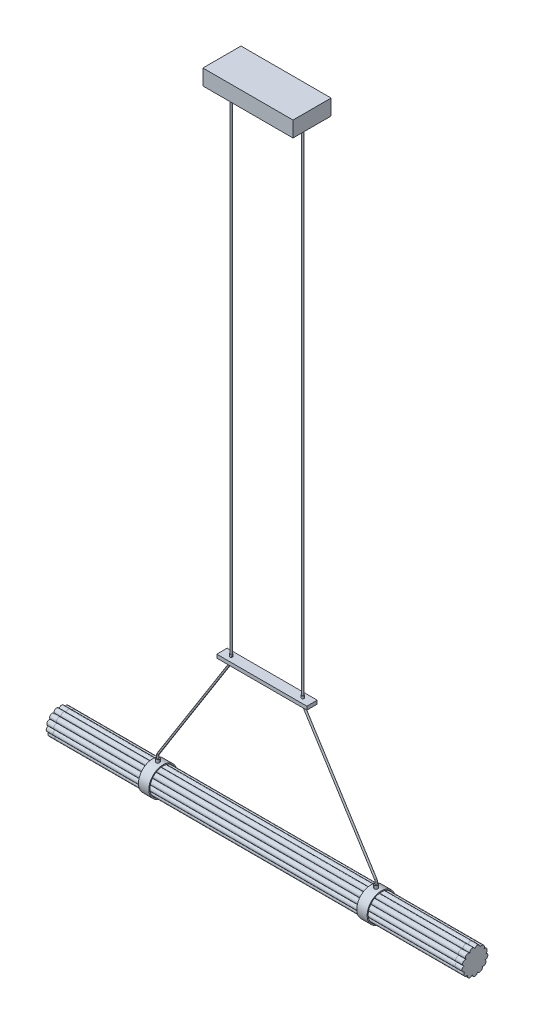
ISO-10303-21;
HEADER;
FILE_DESCRIPTION(('STEP AP214'),'2;1');
FILE_NAME('part.step','',(''),(''),'','','');
FILE_SCHEMA(('AUTOMOTIVE_DESIGN { 1 0 10303 214 1 1 1 1 }'));
ENDSEC;
DATA;
#1=APPLICATION_CONTEXT('core data for automotive mechanical design processes');
#2=APPLICATION_PROTOCOL_DEFINITION('international standard','automotive_design',2000,#1);
#3=PRODUCT_CONTEXT('',#1,'mechanical');
#4=PRODUCT('Part','Part','',(#3));
#5=PRODUCT_RELATED_PRODUCT_CATEGORY('part','',(#4));
#6=PRODUCT_DEFINITION_FORMATION('','',#4);
#7=PRODUCT_DEFINITION_CONTEXT('part definition',#1,'design');
#8=PRODUCT_DEFINITION('design','',#6,#7);
#9=PRODUCT_DEFINITION_SHAPE('','',#8);
#10=(LENGTH_UNIT() NAMED_UNIT(*) SI_UNIT(.MILLI.,.METRE.));
#11=(NAMED_UNIT(*) PLANE_ANGLE_UNIT() SI_UNIT($,.RADIAN.));
#12=(NAMED_UNIT(*) SI_UNIT($,.STERADIAN.) SOLID_ANGLE_UNIT());
#13=UNCERTAINTY_MEASURE_WITH_UNIT(LENGTH_MEASURE(1.E-05),#10,'distance_accuracy_value','');
#14=(GEOMETRIC_REPRESENTATION_CONTEXT(3) GLOBAL_UNCERTAINTY_ASSIGNED_CONTEXT((#13)) GLOBAL_UNIT_ASSIGNED_CONTEXT((#10,
#11,#12)) REPRESENTATION_CONTEXT('',''));
#15=CARTESIAN_POINT('',(0.,0.,0.));
#16=DIRECTION('',(0.,0.,1.));
#17=DIRECTION('',(1.,0.,0.));
#18=AXIS2_PLACEMENT_3D('',#15,#16,#17);
#19=CARTESIAN_POINT('',(-314.999999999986,50.0000000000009,0.));
#20=DIRECTION('',(0.,-1.,0.));
#21=DIRECTION('',(0.,0.,-1.));
#22=AXIS2_PLACEMENT_3D('',#19,#20,#21);
#23=PLANE('',#22);
#24=CARTESIAN_POINT('',(-314.999999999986,50.0000000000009,0.));
#25=DIRECTION('',(0.,-1.,0.));
#26=DIRECTION('',(0.,0.,-1.));
#27=AXIS2_PLACEMENT_3D('',#24,#25,#26);
#28=CIRCLE('',#27,2.5);
#29=CARTESIAN_POINT('',(-314.999999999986,50.0000000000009,-2.5));
#30=VERTEX_POINT('',#29);
#31=EDGE_CURVE('E76',#30,#30,#28,.T.);
#32=ORIENTED_EDGE('',*,*,#31,.T.);
#33=EDGE_LOOP('',(#32));
#34=FACE_BOUND('',#33,.T.);
#35=ADVANCED_FACE('F64',(#34),#23,.T.);
#36=CARTESIAN_POINT('',(-314.999999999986,50.0000000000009,0.));
#37=DIRECTION('',(0.,1.,0.));
#38=DIRECTION('',(-1.,0.,0.));
#39=AXIS2_PLACEMENT_3D('',#36,#37,#38);
#40=CYLINDRICAL_SURFACE('',#39,2.5);
#41=CARTESIAN_POINT('',(-314.999999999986,57.1074087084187,0.));
#42=DIRECTION('',(0.,-1.,0.));
#43=DIRECTION('',(0.,0.,-1.));
#44=AXIS2_PLACEMENT_3D('',#41,#42,#43);
#45=CIRCLE('',#44,2.5);
#46=CARTESIAN_POINT('',(-317.5,57.1074087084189,0.));
#47=VERTEX_POINT('',#46);
#48=EDGE_CURVE('E163',#47,#47,#45,.T.);
#49=ORIENTED_EDGE('',*,*,#48,.T.);
#50=EDGE_LOOP('',(#49));
#51=FACE_BOUND('',#50,.T.);
#52=ORIENTED_EDGE('',*,*,#31,.F.);
#53=EDGE_LOOP('',(#52));
#54=FACE_BOUND('',#53,.T.);
#55=ADVANCED_FACE('F228',(#51,#54),#40,.T.);
#56=CARTESIAN_POINT('',(-305.,57.1074087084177,0.));
#57=DIRECTION('',(0.,0.,-1.));
#58=DIRECTION('',(-1.,0.,0.));
#59=AXIS2_PLACEMENT_3D('',#56,#57,#58);
#60=TOROIDAL_SURFACE('',#59,10.0000000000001,2.5);
#61=CARTESIAN_POINT('',(-313.455788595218,62.4459140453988,0.));
#62=DIRECTION('',(-0.533850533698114,-0.84557885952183,0.));
#63=DIRECTION('',(0.,0.,-1.));
#64=AXIS2_PLACEMENT_3D('',#61,#62,#63);
#65=CIRCLE('',#64,2.5);
#66=CARTESIAN_POINT('',(-315.569735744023,63.7805403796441,0.));
#67=VERTEX_POINT('',#66);
#68=EDGE_CURVE('E166',#67,#67,#65,.T.);
#69=CARTESIAN_POINT('',(-305.,57.1074087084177,0.));
#70=DIRECTION('',(0.,0.,-1.));
#71=DIRECTION('',(-1.,0.,0.));
#72=AXIS2_PLACEMENT_3D('',#69,#70,#71);
#73=CIRCLE('',#72,12.5000000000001);
#74=EDGE_CURVE('',#47,#67,#73,.T.);
#75=ORIENTED_EDGE('',*,*,#48,.F.);
#76=ORIENTED_EDGE('',*,*,#68,.T.);
#77=ORIENTED_EDGE('',*,*,#74,.T.);
#78=ORIENTED_EDGE('',*,*,#74,.F.);
#79=EDGE_LOOP('',(#75,#77,#76,#78));
#80=FACE_BOUND('',#79,.T.);
#81=ADVANCED_FACE('F224',(#80),#60,.T.);
#82=CARTESIAN_POINT('',(-313.455788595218,62.4459140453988,0.));
#83=DIRECTION('',(0.533850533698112,0.845578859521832,0.));
#84=DIRECTION('',(-0.845578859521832,0.533850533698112,0.));
#85=AXIS2_PLACEMENT_3D('',#82,#83,#84);
#86=CYLINDRICAL_SURFACE('',#85,2.5);
#87=CARTESIAN_POINT('',(-105.044211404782,392.554085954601,0.));
#88=DIRECTION('',(-0.533850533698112,-0.845578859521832,0.));
#89=DIRECTION('',(0.,0.,-1.));
#90=AXIS2_PLACEMENT_3D('',#87,#88,#89);
#91=CIRCLE('',#90,2.5);
#92=CARTESIAN_POINT('',(-102.930264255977,391.219459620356,0.));
#93=VERTEX_POINT('',#92);
#94=EDGE_CURVE('E169',#93,#93,#91,.T.);
#95=ORIENTED_EDGE('',*,*,#94,.T.);
#96=EDGE_LOOP('',(#95));
#97=FACE_BOUND('',#96,.T.);
#98=ORIENTED_EDGE('',*,*,#68,.F.);
#99=EDGE_LOOP('',(#98));
#100=FACE_BOUND('',#99,.T.);
#101=ADVANCED_FACE('F220',(#97,#100),#86,.T.);
#102=CARTESIAN_POINT('',(-113.5,397.892591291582,0.));
#103=DIRECTION('',(0.,0.,1.));
#104=DIRECTION('',(1.,0.,0.));
#105=AXIS2_PLACEMENT_3D('',#102,#103,#104);
#106=TOROIDAL_SURFACE('',#105,10.,2.5);
#107=CARTESIAN_POINT('',(-103.5,397.892591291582,0.));
#108=DIRECTION('',(0.,-1.,0.));
#109=DIRECTION('',(0.,0.,-1.));
#110=AXIS2_PLACEMENT_3D('',#107,#108,#109);
#111=CIRCLE('',#110,2.5);
#112=CARTESIAN_POINT('',(-101.,397.892591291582,0.));
#113=VERTEX_POINT('',#112);
#114=EDGE_CURVE('E172',#113,#113,#111,.T.);
#115=CARTESIAN_POINT('',(-113.5,397.892591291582,0.));
#116=DIRECTION('',(0.,0.,1.));
#117=DIRECTION('',(1.,0.,0.));
#118=AXIS2_PLACEMENT_3D('',#115,#116,#117);
#119=CIRCLE('',#118,12.5);
#120=EDGE_CURVE('',#93,#113,#119,.T.);
#121=ORIENTED_EDGE('',*,*,#94,.F.);
#122=ORIENTED_EDGE('',*,*,#114,.T.);
#123=ORIENTED_EDGE('',*,*,#120,.T.);
#124=ORIENTED_EDGE('',*,*,#120,.F.);
#125=EDGE_LOOP('',(#121,#123,#122,#124));
#126=FACE_BOUND('',#125,.T.);
#127=ADVANCED_FACE('F214',(#126),#106,.T.);
#128=CARTESIAN_POINT('',(-103.499999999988,397.892591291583,0.));
#129=DIRECTION('',(0.,1.,0.));
#130=DIRECTION('',(-1.,0.,0.));
#131=AXIS2_PLACEMENT_3D('',#128,#129,#130);
#132=CYLINDRICAL_SURFACE('',#131,2.5);
#133=CARTESIAN_POINT('',(-103.499999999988,400.000000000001,0.));
#134=DIRECTION('',(0.,-1.,0.));
#135=DIRECTION('',(0.,0.,-1.));
#136=AXIS2_PLACEMENT_3D('',#133,#134,#135);
#137=CIRCLE('',#136,2.5);
#138=CARTESIAN_POINT('',(-103.499999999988,400.000000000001,-2.5));
#139=VERTEX_POINT('',#138);
#140=EDGE_CURVE('E71',#139,#139,#137,.T.);
#141=ORIENTED_EDGE('',*,*,#140,.T.);
#142=EDGE_LOOP('',(#141));
#143=FACE_BOUND('',#142,.T.);
#144=ORIENTED_EDGE('',*,*,#114,.F.);
#145=EDGE_LOOP('',(#144));
#146=FACE_BOUND('',#145,.T.);
#147=ADVANCED_FACE('F210',(#143,#146),#132,.T.);
#148=CARTESIAN_POINT('',(-103.5,400.,0.));
#149=DIRECTION('',(0.,1.,0.));
#150=DIRECTION('',(0.,0.,1.));
#151=AXIS2_PLACEMENT_3D('',#148,#149,#150);
#152=CYLINDRICAL_SURFACE('',#151,2.5);
#153=CARTESIAN_POINT('',(-103.5,1850.,0.));
#154=DIRECTION('',(0.,-1.,0.));
#155=DIRECTION('',(0.,0.,-1.));
#156=AXIS2_PLACEMENT_3D('',#153,#154,#155);
#157=CIRCLE('',#156,2.5);
#158=CARTESIAN_POINT('',(-103.5,1850.,-2.5));
#159=VERTEX_POINT('',#158);
#160=EDGE_CURVE('E161',#159,#159,#157,.T.);
#161=ORIENTED_EDGE('',*,*,#160,.T.);
#162=EDGE_LOOP('',(#161));
#163=FACE_BOUND('',#162,.T.);
#164=ORIENTED_EDGE('',*,*,#140,.F.);
#165=EDGE_LOOP('',(#164));
#166=FACE_BOUND('',#165,.T.);
#167=ADVANCED_FACE('F179',(#163,#166),#152,.T.);
#168=CARTESIAN_POINT('',(130.048,1894.958,-54.991));
#169=DIRECTION('',(-1.,0.,0.));
#170=DIRECTION('',(0.,0.,1.));
#171=AXIS2_PLACEMENT_3D('',#168,#169,#170);
#172=PLANE('',#171);
#173=DIRECTION('',(0.,0.,-1.));
#174=VECTOR('',#173,1.);
#175=CARTESIAN_POINT('',(130.048,1850.,-54.991));
#176=LINE('',#175,#174);
#177=CARTESIAN_POINT('',(130.048,1850.,54.991));
#178=VERTEX_POINT('',#177);
#179=CARTESIAN_POINT('',(130.048,1850.,-54.991));
#180=VERTEX_POINT('',#179);
#181=EDGE_CURVE('E138',#178,#180,#176,.T.);
#182=ORIENTED_EDGE('',*,*,#181,.T.);
#183=DIRECTION('',(0.,-1.,0.));
#184=VECTOR('',#183,1.);
#185=CARTESIAN_POINT('',(130.048,1894.958,-54.991));
#186=LINE('',#185,#184);
#187=CARTESIAN_POINT('',(130.048,1894.958,-54.991));
#188=VERTEX_POINT('',#187);
#189=EDGE_CURVE('E159',#188,#180,#186,.T.);
#190=ORIENTED_EDGE('',*,*,#189,.F.);
#191=DIRECTION('',(0.,0.,-1.));
#192=VECTOR('',#191,1.);
#193=CARTESIAN_POINT('',(130.048,1894.958,-54.991));
#194=LINE('',#193,#192);
#195=CARTESIAN_POINT('',(130.048,1894.958,54.991));
#196=VERTEX_POINT('',#195);
#197=EDGE_CURVE('E139',#196,#188,#194,.T.);
#198=ORIENTED_EDGE('',*,*,#197,.F.);
#199=DIRECTION('',(0.,-1.,0.));
#200=VECTOR('',#199,1.);
#201=CARTESIAN_POINT('',(130.048,1894.958,54.991));
#202=LINE('',#201,#200);
#203=EDGE_CURVE('E145',#196,#178,#202,.T.);
#204=ORIENTED_EDGE('',*,*,#203,.T.);
#205=EDGE_LOOP('',(#182,#190,#198,#204));
#206=FACE_BOUND('',#205,.T.);
#207=ADVANCED_FACE('F193',(#206),#172,.F.);
#208=CARTESIAN_POINT('',(-130.048,1894.958,-54.991));
#209=DIRECTION('',(0.,0.,1.));
#210=DIRECTION('',(1.,0.,0.));
#211=AXIS2_PLACEMENT_3D('',#208,#209,#210);
#212=PLANE('',#211);
#213=DIRECTION('',(-1.,0.,0.));
#214=VECTOR('',#213,1.);
#215=CARTESIAN_POINT('',(-130.048,1850.,-54.991));
#216=LINE('',#215,#214);
#217=CARTESIAN_POINT('',(-130.048,1850.,-54.991));
#218=VERTEX_POINT('',#217);
#219=EDGE_CURVE('E148',#180,#218,#216,.T.);
#220=ORIENTED_EDGE('',*,*,#219,.T.);
#221=DIRECTION('',(0.,-1.,0.));
#222=VECTOR('',#221,1.);
#223=CARTESIAN_POINT('',(-130.048,1894.958,-54.991));
#224=LINE('',#223,#222);
#225=CARTESIAN_POINT('',(-130.048,1894.958,-54.991));
#226=VERTEX_POINT('',#225);
#227=EDGE_CURVE('E156',#226,#218,#224,.T.);
#228=ORIENTED_EDGE('',*,*,#227,.F.);
#229=DIRECTION('',(-1.,0.,0.));
#230=VECTOR('',#229,1.);
#231=CARTESIAN_POINT('',(-130.048,1894.958,-54.991));
#232=LINE('',#231,#230);
#233=EDGE_CURVE('E113',#188,#226,#232,.T.);
#234=ORIENTED_EDGE('',*,*,#233,.F.);
#235=ORIENTED_EDGE('',*,*,#189,.T.);
#236=EDGE_LOOP('',(#220,#228,#234,#235));
#237=FACE_BOUND('',#236,.T.);
#238=ADVANCED_FACE('F200',(#237),#212,.F.);
#239=CARTESIAN_POINT('',(-130.048,1894.958,-54.991));
#240=DIRECTION('',(1.,0.,0.));
#241=DIRECTION('',(0.,0.,-1.));
#242=AXIS2_PLACEMENT_3D('',#239,#240,#241);
#243=PLANE('',#242);
#244=DIRECTION('',(0.,0.,1.));
#245=VECTOR('',#244,1.);
#246=CARTESIAN_POINT('',(-130.048,1850.,-54.991));
#247=LINE('',#246,#245);
#248=CARTESIAN_POINT('',(-130.048,1850.,54.991));
#249=VERTEX_POINT('',#248);
#250=EDGE_CURVE('E150',#218,#249,#247,.T.);
#251=ORIENTED_EDGE('',*,*,#250,.T.);
#252=DIRECTION('',(0.,-1.,0.));
#253=VECTOR('',#252,1.);
#254=CARTESIAN_POINT('',(-130.048,1894.958,54.991));
#255=LINE('',#254,#253);
#256=CARTESIAN_POINT('',(-130.048,1894.958,54.991));
#257=VERTEX_POINT('',#256);
#258=EDGE_CURVE('E154',#257,#249,#255,.T.);
#259=ORIENTED_EDGE('',*,*,#258,.F.);
#260=DIRECTION('',(0.,0.,1.));
#261=VECTOR('',#260,1.);
#262=CARTESIAN_POINT('',(-130.048,1894.958,-54.991));
#263=LINE('',#262,#261);
#264=EDGE_CURVE('E142',#226,#257,#263,.T.);
#265=ORIENTED_EDGE('',*,*,#264,.F.);
#266=ORIENTED_EDGE('',*,*,#227,.T.);
#267=EDGE_LOOP('',(#251,#259,#265,#266));
#268=FACE_BOUND('',#267,.T.);
#269=ADVANCED_FACE('F199',(#268),#243,.F.);
#270=CARTESIAN_POINT('',(-130.048,1894.958,54.991));
#271=DIRECTION('',(0.,0.,-1.));
#272=DIRECTION('',(-1.,0.,0.));
#273=AXIS2_PLACEMENT_3D('',#270,#271,#272);
#274=PLANE('',#273);
#275=DIRECTION('',(1.,0.,0.));
#276=VECTOR('',#275,1.);
#277=CARTESIAN_POINT('',(-130.048,1850.,54.991));
#278=LINE('',#277,#276);
#279=EDGE_CURVE('E105',#249,#178,#278,.T.);
#280=ORIENTED_EDGE('',*,*,#279,.T.);
#281=ORIENTED_EDGE('',*,*,#203,.F.);
#282=DIRECTION('',(1.,0.,0.));
#283=VECTOR('',#282,1.);
#284=CARTESIAN_POINT('',(-130.048,1894.958,54.991));
#285=LINE('',#284,#283);
#286=EDGE_CURVE('E84',#257,#196,#285,.T.);
#287=ORIENTED_EDGE('',*,*,#286,.F.);
#288=ORIENTED_EDGE('',*,*,#258,.T.);
#289=EDGE_LOOP('',(#280,#281,#287,#288));
#290=FACE_BOUND('',#289,.T.);
#291=ADVANCED_FACE('F195',(#290),#274,.F.);
#292=CARTESIAN_POINT('',(0.,1894.958,0.));
#293=DIRECTION('',(0.,1.,0.));
#294=DIRECTION('',(0.,0.,1.));
#295=AXIS2_PLACEMENT_3D('',#292,#293,#294);
#296=PLANE('',#295);
#297=ORIENTED_EDGE('',*,*,#197,.T.);
#298=ORIENTED_EDGE('',*,*,#233,.T.);
#299=ORIENTED_EDGE('',*,*,#264,.T.);
#300=ORIENTED_EDGE('',*,*,#286,.T.);
#301=EDGE_LOOP('',(#297,#298,#299,#300));
#302=FACE_BOUND('',#301,.T.);
#303=ADVANCED_FACE('F186',(#302),#296,.T.);
#304=CARTESIAN_POINT('',(0.,1850.,0.));
#305=DIRECTION('',(0.,1.,0.));
#306=DIRECTION('',(0.,0.,1.));
#307=AXIS2_PLACEMENT_3D('',#304,#305,#306);
#308=PLANE('',#307);
#309=CARTESIAN_POINT('',(103.5,1850.,0.));
#310=DIRECTION('',(0.,1.,0.));
#311=DIRECTION('',(0.,0.,1.));
#312=AXIS2_PLACEMENT_3D('',#309,#310,#311);
#313=CIRCLE('',#312,2.5);
#314=CARTESIAN_POINT('',(103.5,1850.,2.5));
#315=VERTEX_POINT('',#314);
#316=EDGE_CURVE('E13',#315,#315,#313,.F.);
#317=ORIENTED_EDGE('',*,*,#316,.F.);
#318=EDGE_LOOP('',(#317));
#319=FACE_BOUND('',#318,.T.);
#320=ORIENTED_EDGE('',*,*,#160,.F.);
#321=EDGE_LOOP('',(#320));
#322=FACE_BOUND('',#321,.T.);
#323=ORIENTED_EDGE('',*,*,#181,.F.);
#324=ORIENTED_EDGE('',*,*,#279,.F.);
#325=ORIENTED_EDGE('',*,*,#250,.F.);
#326=ORIENTED_EDGE('',*,*,#219,.F.);
#327=EDGE_LOOP('',(#323,#324,#325,#326));
#328=FACE_BOUND('',#327,.T.);
#329=ADVANCED_FACE('F182',(#319,#322,#328),#308,.F.);
#330=CARTESIAN_POINT('',(314.999999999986,50.0000000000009,0.));
#331=DIRECTION('',(0.,-1.,0.));
#332=DIRECTION('',(0.,0.,-1.));
#333=AXIS2_PLACEMENT_3D('',#330,#331,#332);
#334=PLANE('',#333);
#335=CARTESIAN_POINT('',(314.999999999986,50.0000000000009,0.));
#336=DIRECTION('',(0.,1.,0.));
#337=DIRECTION('',(0.,0.,-1.));
#338=AXIS2_PLACEMENT_3D('',#335,#336,#337);
#339=CIRCLE('',#338,2.5);
#340=CARTESIAN_POINT('',(314.999999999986,50.0000000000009,-2.5));
#341=VERTEX_POINT('',#340);
#342=EDGE_CURVE('E118',#341,#341,#339,.T.);
#343=ORIENTED_EDGE('',*,*,#342,.F.);
#344=EDGE_LOOP('',(#343));
#345=FACE_BOUND('',#344,.T.);
#346=ADVANCED_FACE('F185',(#345),#334,.T.);
#347=CARTESIAN_POINT('',(314.999999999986,50.0000000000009,0.));
#348=DIRECTION('',(0.,1.,0.));
#349=DIRECTION('',(1.,0.,0.));
#350=AXIS2_PLACEMENT_3D('',#347,#348,#349);
#351=CYLINDRICAL_SURFACE('',#350,2.5);
#352=CARTESIAN_POINT('',(314.999999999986,57.1074087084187,0.));
#353=DIRECTION('',(0.,1.,0.));
#354=DIRECTION('',(0.,0.,-1.));
#355=AXIS2_PLACEMENT_3D('',#352,#353,#354);
#356=CIRCLE('',#355,2.5);
#357=CARTESIAN_POINT('',(317.5,57.1074087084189,0.));
#358=VERTEX_POINT('',#357);
#359=EDGE_CURVE('E121',#358,#358,#356,.T.);
#360=ORIENTED_EDGE('',*,*,#359,.F.);
#361=EDGE_LOOP('',(#360));
#362=FACE_BOUND('',#361,.T.);
#363=ORIENTED_EDGE('',*,*,#342,.T.);
#364=EDGE_LOOP('',(#363));
#365=FACE_BOUND('',#364,.T.);
#366=ADVANCED_FACE('F119',(#362,#365),#351,.T.);
#367=CARTESIAN_POINT('',(305.,57.1074087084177,0.));
#368=DIRECTION('',(0.,0.,-1.));
#369=DIRECTION('',(1.,0.,0.));
#370=AXIS2_PLACEMENT_3D('',#367,#368,#369);
#371=TOROIDAL_SURFACE('',#370,10.0000000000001,2.5);
#372=CARTESIAN_POINT('',(313.455788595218,62.4459140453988,0.));
#373=DIRECTION('',(-0.533850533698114,0.84557885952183,0.));
#374=DIRECTION('',(0.,0.,-1.));
#375=AXIS2_PLACEMENT_3D('',#372,#373,#374);
#376=CIRCLE('',#375,2.5);
#377=CARTESIAN_POINT('',(315.569735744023,63.7805403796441,0.));
#378=VERTEX_POINT('',#377);
#379=EDGE_CURVE('E124',#378,#378,#376,.T.);
#380=CARTESIAN_POINT('',(305.,57.1074087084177,0.));
#381=DIRECTION('',(0.,0.,-1.));
#382=DIRECTION('',(1.,0.,0.));
#383=AXIS2_PLACEMENT_3D('',#380,#381,#382);
#384=CIRCLE('',#383,12.5000000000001);
#385=EDGE_CURVE('',#378,#358,#384,.T.);
#386=ORIENTED_EDGE('',*,*,#379,.F.);
#387=ORIENTED_EDGE('',*,*,#359,.T.);
#388=ORIENTED_EDGE('',*,*,#385,.T.);
#389=ORIENTED_EDGE('',*,*,#385,.F.);
#390=EDGE_LOOP('',(#386,#388,#387,#389));
#391=FACE_BOUND('',#390,.T.);
#392=ADVANCED_FACE('F334',(#391),#371,.T.);
#393=CARTESIAN_POINT('',(313.455788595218,62.4459140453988,0.));
#394=DIRECTION('',(-0.533850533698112,0.845578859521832,0.));
#395=DIRECTION('',(0.845578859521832,0.533850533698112,0.));
#396=AXIS2_PLACEMENT_3D('',#393,#394,#395);
#397=CYLINDRICAL_SURFACE('',#396,2.5);
#398=CARTESIAN_POINT('',(105.044211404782,392.554085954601,0.));
#399=DIRECTION('',(-0.533850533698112,0.845578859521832,0.));
#400=DIRECTION('',(0.,0.,-1.));
#401=AXIS2_PLACEMENT_3D('',#398,#399,#400);
#402=CIRCLE('',#401,2.5);
#403=CARTESIAN_POINT('',(102.930264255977,391.219459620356,0.));
#404=VERTEX_POINT('',#403);
#405=EDGE_CURVE('E129',#404,#404,#402,.T.);
#406=ORIENTED_EDGE('',*,*,#405,.F.);
#407=EDGE_LOOP('',(#406));
#408=FACE_BOUND('',#407,.T.);
#409=ORIENTED_EDGE('',*,*,#379,.T.);
#410=EDGE_LOOP('',(#409));
#411=FACE_BOUND('',#410,.T.);
#412=ADVANCED_FACE('F344',(#408,#411),#397,.T.);
#413=CARTESIAN_POINT('',(113.5,397.892591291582,0.));
#414=DIRECTION('',(0.,0.,1.));
#415=DIRECTION('',(-1.,0.,0.));
#416=AXIS2_PLACEMENT_3D('',#413,#414,#415);
#417=TOROIDAL_SURFACE('',#416,10.,2.5);
#418=CARTESIAN_POINT('',(103.5,397.892591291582,0.));
#419=DIRECTION('',(0.,1.,0.));
#420=DIRECTION('',(0.,0.,-1.));
#421=AXIS2_PLACEMENT_3D('',#418,#419,#420);
#422=CIRCLE('',#421,2.5);
#423=CARTESIAN_POINT('',(101.,397.892591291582,0.));
#424=VERTEX_POINT('',#423);
#425=EDGE_CURVE('E132',#424,#424,#422,.T.);
#426=CARTESIAN_POINT('',(113.5,397.892591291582,0.));
#427=DIRECTION('',(0.,0.,1.));
#428=DIRECTION('',(-1.,0.,0.));
#429=AXIS2_PLACEMENT_3D('',#426,#427,#428);
#430=CIRCLE('',#429,12.5);
#431=EDGE_CURVE('',#424,#404,#430,.T.);
#432=ORIENTED_EDGE('',*,*,#425,.F.);
#433=ORIENTED_EDGE('',*,*,#405,.T.);
#434=ORIENTED_EDGE('',*,*,#431,.T.);
#435=ORIENTED_EDGE('',*,*,#431,.F.);
#436=EDGE_LOOP('',(#432,#434,#433,#435));
#437=FACE_BOUND('',#436,.T.);
#438=ADVANCED_FACE('F354',(#437),#417,.T.);
#439=CARTESIAN_POINT('',(103.499999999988,397.892591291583,0.));
#440=DIRECTION('',(0.,1.,0.));
#441=DIRECTION('',(1.,0.,0.));
#442=AXIS2_PLACEMENT_3D('',#439,#440,#441);
#443=CYLINDRICAL_SURFACE('',#442,2.5);
#444=CARTESIAN_POINT('',(103.499999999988,400.000000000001,0.));
#445=DIRECTION('',(0.,1.,0.));
#446=DIRECTION('',(0.,0.,-1.));
#447=AXIS2_PLACEMENT_3D('',#444,#445,#446);
#448=CIRCLE('',#447,2.5);
#449=CARTESIAN_POINT('',(103.499999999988,400.000000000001,-2.5));
#450=VERTEX_POINT('',#449);
#451=EDGE_CURVE('E135',#450,#450,#448,.T.);
#452=ORIENTED_EDGE('',*,*,#451,.F.);
#453=EDGE_LOOP('',(#452));
#454=FACE_BOUND('',#453,.T.);
#455=ORIENTED_EDGE('',*,*,#425,.T.);
#456=EDGE_LOOP('',(#455));
#457=FACE_BOUND('',#456,.T.);
#458=ADVANCED_FACE('F364',(#454,#457),#443,.T.);
#459=CARTESIAN_POINT('',(103.5,400.,0.));
#460=DIRECTION('',(0.,1.,0.));
#461=DIRECTION('',(0.,0.,1.));
#462=AXIS2_PLACEMENT_3D('',#459,#460,#461);
#463=CYLINDRICAL_SURFACE('',#462,2.5);
#464=ORIENTED_EDGE('',*,*,#316,.T.);
#465=EDGE_LOOP('',(#464));
#466=FACE_BOUND('',#465,.T.);
#467=ORIENTED_EDGE('',*,*,#451,.T.);
#468=EDGE_LOOP('',(#467));
#469=FACE_BOUND('',#468,.T.);
#470=ADVANCED_FACE('F374',(#466,#469),#463,.T.);
#471=CLOSED_SHELL('',(#35,#55,#81,#101,#127,#147,#167,#207,#238,#269,#291,#303,#329,#346,#366,
#392,#412,#438,#458,#470));
#472=MANIFOLD_SOLID_BREP('B2',#471);
#473=CARTESIAN_POINT('',(-102.,412.5,0.));
#474=DIRECTION('',(1.,0.,0.));
#475=DIRECTION('',(0.,0.,1.));
#476=AXIS2_PLACEMENT_3D('',#473,#474,#475);
#477=CYLINDRICAL_SURFACE('',#476,1.5);
#478=CARTESIAN_POINT('',(-101.,412.5,0.));
#479=DIRECTION('',(1.,0.,0.));
#480=DIRECTION('',(0.,0.,-1.));
#481=AXIS2_PLACEMENT_3D('',#478,#479,#480);
#482=CIRCLE('',#481,1.5);
#483=CARTESIAN_POINT('',(-101.,412.5,1.5));
#484=VERTEX_POINT('',#483);
#485=EDGE_CURVE('E63',#484,#484,#482,.F.);
#486=ORIENTED_EDGE('',*,*,#485,.F.);
#487=EDGE_LOOP('',(#486));
#488=FACE_BOUND('',#487,.T.);
#489=CARTESIAN_POINT('',(-100.,412.5,0.));
#490=DIRECTION('',(1.,0.,0.));
#491=DIRECTION('',(0.,0.,-1.));
#492=AXIS2_PLACEMENT_3D('',#489,#490,#491);
#493=CIRCLE('',#492,1.5);
#494=CARTESIAN_POINT('',(-100.,412.5,-1.5));
#495=VERTEX_POINT('',#494);
#496=EDGE_CURVE('E433',#495,#495,#493,.T.);
#497=ORIENTED_EDGE('',*,*,#496,.F.);
#498=EDGE_LOOP('',(#497));
#499=FACE_BOUND('',#498,.T.);
#500=ADVANCED_FACE('F422',(#488,#499),#477,.T.);
#501=CARTESIAN_POINT('',(-102.,412.5,0.));
#502=DIRECTION('',(-1.,0.,0.));
#503=DIRECTION('',(0.,0.,-1.));
#504=AXIS2_PLACEMENT_3D('',#501,#502,#503);
#505=PLANE('',#504);
#506=CARTESIAN_POINT('',(-102.,412.5,0.));
#507=DIRECTION('',(1.,0.,0.));
#508=DIRECTION('',(0.,0.,-1.));
#509=AXIS2_PLACEMENT_3D('',#506,#507,#508);
#510=CIRCLE('',#509,0.5);
#511=CARTESIAN_POINT('',(-102.,412.5,0.499999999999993));
#512=VERTEX_POINT('',#511);
#513=EDGE_CURVE('E429',#512,#512,#510,.T.);
#514=ORIENTED_EDGE('',*,*,#513,.F.);
#515=EDGE_LOOP('',(#514));
#516=FACE_BOUND('',#515,.T.);
#517=ADVANCED_FACE('F466',(#516),#505,.T.);
#518=CARTESIAN_POINT('',(-100.,412.5,0.));
#519=DIRECTION('',(-1.,0.,0.));
#520=DIRECTION('',(0.,0.,-1.));
#521=AXIS2_PLACEMENT_3D('',#518,#519,#520);
#522=PLANE('',#521);
#523=CARTESIAN_POINT('',(-100.,412.5,0.));
#524=DIRECTION('',(1.,0.,0.));
#525=DIRECTION('',(0.,0.,-1.));
#526=AXIS2_PLACEMENT_3D('',#523,#524,#525);
#527=CIRCLE('',#526,0.500000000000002);
#528=CARTESIAN_POINT('',(-100.,412.5,-0.500000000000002));
#529=VERTEX_POINT('',#528);
#530=EDGE_CURVE('E440',#529,#529,#527,.T.);
#531=ORIENTED_EDGE('',*,*,#530,.F.);
#532=EDGE_LOOP('',(#531));
#533=FACE_BOUND('',#532,.T.);
#534=ORIENTED_EDGE('',*,*,#496,.T.);
#535=EDGE_LOOP('',(#534));
#536=FACE_BOUND('',#535,.T.);
#537=ADVANCED_FACE('F471',(#533,#536),#522,.F.);
#538=CARTESIAN_POINT('',(-102.,412.5,0.));
#539=DIRECTION('',(1.,0.,0.));
#540=DIRECTION('',(0.,0.,1.));
#541=AXIS2_PLACEMENT_3D('',#538,#539,#540);
#542=CONICAL_SURFACE('',#541,0.5,0.785398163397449);
#543=CARTESIAN_POINT('',(-101.,412.5,1.5));
#544=CARTESIAN_POINT('',(-101.010416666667,412.5,1.48958333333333));
#545=CARTESIAN_POINT('',(-101.020833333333,412.5,1.47916666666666));
#546=CARTESIAN_POINT('',(-101.041666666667,412.5,1.45833333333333));
#547=CARTESIAN_POINT('',(-101.052083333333,412.5,1.44791666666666));
#548=CARTESIAN_POINT('',(-101.072916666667,412.5,1.42708333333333));
#549=CARTESIAN_POINT('',(-101.083333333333,412.5,1.41666666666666));
#550=CARTESIAN_POINT('',(-101.104166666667,412.5,1.39583333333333));
#551=CARTESIAN_POINT('',(-101.114583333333,412.5,1.38541666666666));
#552=CARTESIAN_POINT('',(-101.135416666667,412.5,1.36458333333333));
#553=CARTESIAN_POINT('',(-101.145833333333,412.5,1.35416666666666));
#554=CARTESIAN_POINT('',(-101.166666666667,412.5,1.33333333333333));
#555=CARTESIAN_POINT('',(-101.177083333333,412.5,1.32291666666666));
#556=CARTESIAN_POINT('',(-101.197916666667,412.5,1.30208333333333));
#557=CARTESIAN_POINT('',(-101.208333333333,412.5,1.29166666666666));
#558=CARTESIAN_POINT('',(-101.229166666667,412.5,1.27083333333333));
#559=CARTESIAN_POINT('',(-101.239583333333,412.5,1.26041666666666));
#560=CARTESIAN_POINT('',(-101.260416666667,412.5,1.23958333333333));
#561=CARTESIAN_POINT('',(-101.270833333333,412.5,1.22916666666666));
#562=CARTESIAN_POINT('',(-101.291666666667,412.5,1.20833333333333));
#563=CARTESIAN_POINT('',(-101.302083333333,412.5,1.19791666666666));
#564=CARTESIAN_POINT('',(-101.322916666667,412.5,1.17708333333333));
#565=CARTESIAN_POINT('',(-101.333333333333,412.5,1.16666666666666));
#566=CARTESIAN_POINT('',(-101.354166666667,412.5,1.14583333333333));
#567=CARTESIAN_POINT('',(-101.364583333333,412.5,1.13541666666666));
#568=CARTESIAN_POINT('',(-101.385416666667,412.5,1.11458333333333));
#569=CARTESIAN_POINT('',(-101.395833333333,412.5,1.10416666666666));
#570=CARTESIAN_POINT('',(-101.416666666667,412.5,1.08333333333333));
#571=CARTESIAN_POINT('',(-101.427083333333,412.5,1.07291666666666));
#572=CARTESIAN_POINT('',(-101.447916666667,412.5,1.05208333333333));
#573=CARTESIAN_POINT('',(-101.458333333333,412.5,1.04166666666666));
#574=CARTESIAN_POINT('',(-101.479166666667,412.5,1.02083333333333));
#575=CARTESIAN_POINT('',(-101.489583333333,412.5,1.01041666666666));
#576=CARTESIAN_POINT('',(-101.510416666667,412.5,0.989583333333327));
#577=CARTESIAN_POINT('',(-101.520833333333,412.5,0.979166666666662));
#578=CARTESIAN_POINT('',(-101.541666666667,412.5,0.958333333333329));
#579=CARTESIAN_POINT('',(-101.552083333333,412.5,0.947916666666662));
#580=CARTESIAN_POINT('',(-101.572916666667,412.5,0.927083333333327));
#581=CARTESIAN_POINT('',(-101.583333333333,412.5,0.916666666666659));
#582=CARTESIAN_POINT('',(-101.604166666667,412.5,0.895833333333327));
#583=CARTESIAN_POINT('',(-101.614583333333,412.5,0.885416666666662));
#584=CARTESIAN_POINT('',(-101.635416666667,412.5,0.864583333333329));
#585=CARTESIAN_POINT('',(-101.645833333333,412.5,0.854166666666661));
#586=CARTESIAN_POINT('',(-101.666666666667,412.5,0.833333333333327));
#587=CARTESIAN_POINT('',(-101.677083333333,412.5,0.82291666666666));
#588=CARTESIAN_POINT('',(-101.697916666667,412.5,0.802083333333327));
#589=CARTESIAN_POINT('',(-101.708333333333,412.5,0.791666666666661));
#590=CARTESIAN_POINT('',(-101.729166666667,412.5,0.770833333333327));
#591=CARTESIAN_POINT('',(-101.739583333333,412.5,0.760416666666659));
#592=CARTESIAN_POINT('',(-101.760416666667,412.5,0.739583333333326));
#593=CARTESIAN_POINT('',(-101.770833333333,412.5,0.729166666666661));
#594=CARTESIAN_POINT('',(-101.791666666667,412.5,0.708333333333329));
#595=CARTESIAN_POINT('',(-101.802083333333,412.5,0.697916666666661));
#596=CARTESIAN_POINT('',(-101.822916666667,412.5,0.677083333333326));
#597=CARTESIAN_POINT('',(-101.833333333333,412.5,0.666666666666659));
#598=CARTESIAN_POINT('',(-101.854166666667,412.5,0.645833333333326));
#599=CARTESIAN_POINT('',(-101.864583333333,412.5,0.635416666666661));
#600=CARTESIAN_POINT('',(-101.885416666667,412.5,0.614583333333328));
#601=CARTESIAN_POINT('',(-101.895833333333,412.5,0.604166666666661));
#602=CARTESIAN_POINT('',(-101.916666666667,412.5,0.583333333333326));
#603=CARTESIAN_POINT('',(-101.927083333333,412.5,0.57291666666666));
#604=CARTESIAN_POINT('',(-101.947916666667,412.5,0.552083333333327));
#605=CARTESIAN_POINT('',(-101.958333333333,412.5,0.54166666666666));
#606=CARTESIAN_POINT('',(-101.979166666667,412.5,0.520833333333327));
#607=CARTESIAN_POINT('',(-101.989583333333,412.5,0.51041666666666));
#608=CARTESIAN_POINT('',(-102.,412.5,0.499999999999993));
#609=B_SPLINE_CURVE_WITH_KNOTS('',3,(#543,#544,#545,#546,#547,#548,#549,#550,#551,#552,#553,
#554,#555,#556,#557,#558,#559,#560,#561,#562,#563,#564,#565,#566,#567,#568,#569,#570,#571,#572,
#573,#574,#575,#576,#577,#578,#579,#580,#581,#582,#583,#584,#585,#586,#587,#588,#589,#590,#591,
#592,#593,#594,#595,#596,#597,#598,#599,#600,#601,#602,#603,#604,#605,#606,#607,#608),
.UNSPECIFIED.,.F.,.F.,(4,2,2,2,2,2,2,2,2,2,2,2,2,2,2,2,2,2,2,2,2,2,2,2,2,2,2,2,2,2,2,2,4),(0.,
0.0441941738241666,0.0883883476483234,0.13258252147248,0.176776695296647,0.220970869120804,
0.265165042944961,0.309359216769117,0.353553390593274,0.397747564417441,0.441941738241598,
0.486135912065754,0.530330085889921,0.574524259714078,0.618718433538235,0.662912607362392,
0.707106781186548,0.751300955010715,0.795495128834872,0.839689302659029,0.883883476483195,
0.928077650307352,0.972271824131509,1.01646599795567,1.06066017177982,1.10485434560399,
1.14904851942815,1.1932426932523,1.23743686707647,1.28163104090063,1.32582521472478,
1.37001938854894,1.4142135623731),.UNSPECIFIED.);
#610=EDGE_CURVE('BSEAM424',#484,#512,#609,.T.);
#611=ORIENTED_EDGE('',*,*,#485,.T.);
#612=ORIENTED_EDGE('',*,*,#513,.T.);
#613=ORIENTED_EDGE('',*,*,#610,.T.);
#614=ORIENTED_EDGE('',*,*,#610,.F.);
#615=EDGE_LOOP('',(#611,#613,#612,#614));
#616=FACE_BOUND('',#615,.T.);
#617=ADVANCED_FACE('F424',(#616),#542,.T.);
#618=CARTESIAN_POINT('',(-102.,412.5,0.));
#619=DIRECTION('',(1.,0.,0.));
#620=DIRECTION('',(0.,0.,1.));
#621=AXIS2_PLACEMENT_3D('',#618,#619,#620);
#622=CYLINDRICAL_SURFACE('',#621,0.500000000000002);
#623=CARTESIAN_POINT('',(-100.585786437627,412.5,0.));
#624=DIRECTION('',(-1.,0.,0.));
#625=DIRECTION('',(0.,0.,1.));
#626=AXIS2_PLACEMENT_3D('',#623,#624,#625);
#627=CIRCLE('',#626,0.500000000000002);
#628=CARTESIAN_POINT('',(-100.585786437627,412.5,0.500000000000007));
#629=VERTEX_POINT('',#628);
#630=EDGE_CURVE('E437',#629,#629,#627,.T.);
#631=ORIENTED_EDGE('',*,*,#630,.T.);
#632=EDGE_LOOP('',(#631));
#633=FACE_BOUND('',#632,.T.);
#634=ORIENTED_EDGE('',*,*,#530,.T.);
#635=EDGE_LOOP('',(#634));
#636=FACE_BOUND('',#635,.T.);
#637=ADVANCED_FACE('F449',(#633,#636),#622,.F.);
#638=CARTESIAN_POINT('',(-101.,412.5,0.));
#639=DIRECTION('',(-1.,0.,0.));
#640=DIRECTION('',(0.,0.,-1.));
#641=AXIS2_PLACEMENT_3D('',#638,#639,#640);
#642=PLANE('',#641);
#643=CARTESIAN_POINT('',(-101.,412.5,0.));
#644=DIRECTION('',(1.,0.,0.));
#645=DIRECTION('',(0.,0.,-1.));
#646=AXIS2_PLACEMENT_3D('',#643,#644,#645);
#647=CIRCLE('',#646,0.0857864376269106);
#648=CARTESIAN_POINT('',(-101.,412.5,0.0857864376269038));
#649=VERTEX_POINT('',#648);
#650=EDGE_CURVE('E443',#649,#649,#647,.T.);
#651=ORIENTED_EDGE('',*,*,#650,.T.);
#652=EDGE_LOOP('',(#651));
#653=FACE_BOUND('',#652,.T.);
#654=ADVANCED_FACE('F455',(#653),#642,.F.);
#655=CARTESIAN_POINT('',(-100.585786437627,412.5,0.));
#656=DIRECTION('',(1.,0.,0.));
#657=DIRECTION('',(0.,0.,1.));
#658=AXIS2_PLACEMENT_3D('',#655,#656,#657);
#659=CONICAL_SURFACE('',#658,0.5,0.785398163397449);
#660=CARTESIAN_POINT('',(-100.585786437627,412.5,0.500000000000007));
#661=CARTESIAN_POINT('',(-100.590101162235,412.5,0.495685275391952));
#662=CARTESIAN_POINT('',(-100.594415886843,412.5,0.4913705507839));
#663=CARTESIAN_POINT('',(-100.603045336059,412.5,0.482741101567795));
#664=CARTESIAN_POINT('',(-100.607360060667,412.5,0.478426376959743));
#665=CARTESIAN_POINT('',(-100.615989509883,412.5,0.469796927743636));
#666=CARTESIAN_POINT('',(-100.620304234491,412.5,0.465482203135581));
#667=CARTESIAN_POINT('',(-100.628933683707,412.5,0.456852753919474));
#668=CARTESIAN_POINT('',(-100.633248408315,412.5,0.452538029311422));
#669=CARTESIAN_POINT('',(-100.641877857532,412.5,0.443908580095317));
#670=CARTESIAN_POINT('',(-100.64619258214,412.5,0.439593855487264));
#671=CARTESIAN_POINT('',(-100.654822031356,412.5,0.430964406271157));
#672=CARTESIAN_POINT('',(-100.659136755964,412.5,0.426649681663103));
#673=CARTESIAN_POINT('',(-100.66776620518,412.5,0.418020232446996));
#674=CARTESIAN_POINT('',(-100.672080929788,412.5,0.413705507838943));
#675=CARTESIAN_POINT('',(-100.680710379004,412.5,0.405076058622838));
#676=CARTESIAN_POINT('',(-100.685025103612,412.5,0.400761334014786));
#677=CARTESIAN_POINT('',(-100.693654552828,412.5,0.392131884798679));
#678=CARTESIAN_POINT('',(-100.697969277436,412.5,0.387817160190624));
#679=CARTESIAN_POINT('',(-100.706598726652,412.5,0.379187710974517));
#680=CARTESIAN_POINT('',(-100.71091345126,412.5,0.374872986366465));
#681=CARTESIAN_POINT('',(-100.719542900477,412.5,0.36624353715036));
#682=CARTESIAN_POINT('',(-100.723857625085,412.5,0.361928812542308));
#683=CARTESIAN_POINT('',(-100.732487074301,412.5,0.3532993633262));
#684=CARTESIAN_POINT('',(-100.736801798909,412.5,0.348984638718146));
#685=CARTESIAN_POINT('',(-100.745431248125,412.5,0.340355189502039));
#686=CARTESIAN_POINT('',(-100.749745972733,412.5,0.336040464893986));
#687=CARTESIAN_POINT('',(-100.758375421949,412.5,0.327411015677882));
#688=CARTESIAN_POINT('',(-100.762690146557,412.5,0.323096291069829));
#689=CARTESIAN_POINT('',(-100.771319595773,412.5,0.314466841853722));
#690=CARTESIAN_POINT('',(-100.775634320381,412.5,0.310152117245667));
#691=CARTESIAN_POINT('',(-100.784263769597,412.5,0.30152266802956));
#692=CARTESIAN_POINT('',(-100.788578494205,412.5,0.297207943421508));
#693=CARTESIAN_POINT('',(-100.797207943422,412.5,0.288578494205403));
#694=CARTESIAN_POINT('',(-100.80152266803,412.5,0.284263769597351));
#695=CARTESIAN_POINT('',(-100.810152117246,412.5,0.275634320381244));
#696=CARTESIAN_POINT('',(-100.814466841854,412.5,0.271319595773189));
#697=CARTESIAN_POINT('',(-100.82309629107,412.5,0.262690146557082));
#698=CARTESIAN_POINT('',(-100.827411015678,412.5,0.258375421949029));
#699=CARTESIAN_POINT('',(-100.836040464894,412.5,0.249745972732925));
#700=CARTESIAN_POINT('',(-100.840355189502,412.5,0.245431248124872));
#701=CARTESIAN_POINT('',(-100.848984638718,412.5,0.236801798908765));
#702=CARTESIAN_POINT('',(-100.853299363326,412.5,0.23248707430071));
#703=CARTESIAN_POINT('',(-100.861928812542,412.5,0.223857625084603));
#704=CARTESIAN_POINT('',(-100.86624353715,412.5,0.219542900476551));
#705=CARTESIAN_POINT('',(-100.874872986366,412.5,0.210913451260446));
#706=CARTESIAN_POINT('',(-100.879187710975,412.5,0.206598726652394));
#707=CARTESIAN_POINT('',(-100.887817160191,412.5,0.197969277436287));
#708=CARTESIAN_POINT('',(-100.892131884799,412.5,0.193654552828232));
#709=CARTESIAN_POINT('',(-100.900761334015,412.5,0.185025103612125));
#710=CARTESIAN_POINT('',(-100.905076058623,412.5,0.180710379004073));
#711=CARTESIAN_POINT('',(-100.913705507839,412.5,0.172080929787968));
#712=CARTESIAN_POINT('',(-100.918020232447,412.5,0.167766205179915));
#713=CARTESIAN_POINT('',(-100.926649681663,412.5,0.159136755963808));
#714=CARTESIAN_POINT('',(-100.930964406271,412.5,0.154822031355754));
#715=CARTESIAN_POINT('',(-100.939593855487,412.5,0.146192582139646));
#716=CARTESIAN_POINT('',(-100.943908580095,412.5,0.141877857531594));
#717=CARTESIAN_POINT('',(-100.952538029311,412.5,0.133248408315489));
#718=CARTESIAN_POINT('',(-100.956852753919,412.5,0.128933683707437));
#719=CARTESIAN_POINT('',(-100.965482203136,412.5,0.12030423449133));
#720=CARTESIAN_POINT('',(-100.969796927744,412.5,0.115989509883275));
#721=CARTESIAN_POINT('',(-100.97842637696,412.5,0.107360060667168));
#722=CARTESIAN_POINT('',(-100.982741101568,412.5,0.103045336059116));
#723=CARTESIAN_POINT('',(-100.991370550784,412.5,0.0944158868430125));
#724=CARTESIAN_POINT('',(-100.995685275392,412.5,0.0901011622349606));
#725=CARTESIAN_POINT('',(-101.,412.5,0.0857864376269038));
#726=B_SPLINE_CURVE_WITH_KNOTS('',3,(#660,#661,#662,#663,#664,#665,#666,#667,#668,#669,#670,
#671,#672,#673,#674,#675,#676,#677,#678,#679,#680,#681,#682,#683,#684,#685,#686,#687,#688,#689,
#690,#691,#692,#693,#694,#695,#696,#697,#698,#699,#700,#701,#702,#703,#704,#705,#706,#707,#708,
#709,#710,#711,#712,#713,#714,#715,#716,#717,#718,#719,#720,#721,#722,#723,#724,#725),
.UNSPECIFIED.,.F.,.F.,(4,2,2,2,2,2,2,2,2,2,2,2,2,2,2,2,2,2,2,2,2,2,2,2,2,2,2,2,2,2,2,2,4),(0.,
0.0183058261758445,0.036611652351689,0.0549174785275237,0.0732233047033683,0.0915291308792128,
0.109834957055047,0.128140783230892,0.146446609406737,0.164752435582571,0.183058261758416,
0.20136408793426,0.219669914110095,0.237975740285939,0.256281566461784,0.274587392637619,
0.292893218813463,0.311199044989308,0.329504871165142,0.347810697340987,0.366116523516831,
0.384422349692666,0.402728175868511,0.421034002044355,0.43933982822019,0.457645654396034,
0.475951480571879,0.494257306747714,0.512563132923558,0.530868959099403,0.549174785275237,
0.567480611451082,0.585786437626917),.UNSPECIFIED.);
#727=EDGE_CURVE('BSEAM452',#629,#649,#726,.T.);
#728=ORIENTED_EDGE('',*,*,#630,.F.);
#729=ORIENTED_EDGE('',*,*,#650,.F.);
#730=ORIENTED_EDGE('',*,*,#727,.T.);
#731=ORIENTED_EDGE('',*,*,#727,.F.);
#732=EDGE_LOOP('',(#728,#730,#729,#731));
#733=FACE_BOUND('',#732,.T.);
#734=ADVANCED_FACE('F452',(#733),#659,.F.);
#735=CLOSED_SHELL('',(#500,#517,#537,#617,#637,#654,#734));
#736=MANIFOLD_SOLID_BREP('B7',#735);
#737=CARTESIAN_POINT('',(102.,412.5,0.));
#738=DIRECTION('',(-1.,0.,0.));
#739=DIRECTION('',(0.,0.,1.));
#740=AXIS2_PLACEMENT_3D('',#737,#738,#739);
#741=CYLINDRICAL_SURFACE('',#740,1.5);
#742=CARTESIAN_POINT('',(101.,412.5,0.));
#743=DIRECTION('',(1.,0.,0.));
#744=DIRECTION('',(0.,0.,-1.));
#745=AXIS2_PLACEMENT_3D('',#742,#743,#744);
#746=CIRCLE('',#745,1.5);
#747=CARTESIAN_POINT('',(101.,412.5,1.50000000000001));
#748=VERTEX_POINT('',#747);
#749=EDGE_CURVE('E421',#748,#748,#746,.F.);
#750=ORIENTED_EDGE('',*,*,#749,.T.);
#751=EDGE_LOOP('',(#750));
#752=FACE_BOUND('',#751,.T.);
#753=CARTESIAN_POINT('',(100.,412.5,0.));
#754=DIRECTION('',(1.,0.,0.));
#755=DIRECTION('',(0.,0.,-1.));
#756=AXIS2_PLACEMENT_3D('',#753,#754,#755);
#757=CIRCLE('',#756,1.5);
#758=CARTESIAN_POINT('',(100.,412.5,-1.5));
#759=VERTEX_POINT('',#758);
#760=EDGE_CURVE('E542',#759,#759,#757,.T.);
#761=ORIENTED_EDGE('',*,*,#760,.T.);
#762=EDGE_LOOP('',(#761));
#763=FACE_BOUND('',#762,.T.);
#764=ADVANCED_FACE('F531',(#752,#763),#741,.T.);
#765=CARTESIAN_POINT('',(102.,412.5,0.));
#766=DIRECTION('',(1.,0.,0.));
#767=DIRECTION('',(0.,0.,-1.));
#768=AXIS2_PLACEMENT_3D('',#765,#766,#767);
#769=PLANE('',#768);
#770=CARTESIAN_POINT('',(102.,412.5,0.));
#771=DIRECTION('',(1.,0.,0.));
#772=DIRECTION('',(0.,0.,-1.));
#773=AXIS2_PLACEMENT_3D('',#770,#771,#772);
#774=CIRCLE('',#773,0.5);
#775=CARTESIAN_POINT('',(102.,412.5,0.500000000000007));
#776=VERTEX_POINT('',#775);
#777=EDGE_CURVE('E538',#776,#776,#774,.T.);
#778=ORIENTED_EDGE('',*,*,#777,.T.);
#779=EDGE_LOOP('',(#778));
#780=FACE_BOUND('',#779,.T.);
#781=ADVANCED_FACE('F571',(#780),#769,.T.);
#782=CARTESIAN_POINT('',(100.,412.5,0.));
#783=DIRECTION('',(1.,0.,0.));
#784=DIRECTION('',(0.,0.,-1.));
#785=AXIS2_PLACEMENT_3D('',#782,#783,#784);
#786=PLANE('',#785);
#787=CARTESIAN_POINT('',(100.,412.5,0.));
#788=DIRECTION('',(1.,0.,0.));
#789=DIRECTION('',(0.,0.,-1.));
#790=AXIS2_PLACEMENT_3D('',#787,#788,#789);
#791=CIRCLE('',#790,0.500000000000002);
#792=CARTESIAN_POINT('',(100.,412.5,-0.500000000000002));
#793=VERTEX_POINT('',#792);
#794=EDGE_CURVE('E549',#793,#793,#791,.T.);
#795=ORIENTED_EDGE('',*,*,#794,.T.);
#796=EDGE_LOOP('',(#795));
#797=FACE_BOUND('',#796,.T.);
#798=ORIENTED_EDGE('',*,*,#760,.F.);
#799=EDGE_LOOP('',(#798));
#800=FACE_BOUND('',#799,.T.);
#801=ADVANCED_FACE('F568',(#797,#800),#786,.F.);
#802=CARTESIAN_POINT('',(102.,412.5,0.));
#803=DIRECTION('',(-1.,0.,0.));
#804=DIRECTION('',(0.,0.,1.));
#805=AXIS2_PLACEMENT_3D('',#802,#803,#804);
#806=CONICAL_SURFACE('',#805,0.5,0.785398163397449);
#807=CARTESIAN_POINT('',(101.,412.5,1.50000000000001));
#808=CARTESIAN_POINT('',(101.010416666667,412.5,1.48958333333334));
#809=CARTESIAN_POINT('',(101.020833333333,412.5,1.47916666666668));
#810=CARTESIAN_POINT('',(101.041666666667,412.5,1.45833333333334));
#811=CARTESIAN_POINT('',(101.052083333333,412.5,1.44791666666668));
#812=CARTESIAN_POINT('',(101.072916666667,412.5,1.42708333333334));
#813=CARTESIAN_POINT('',(101.083333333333,412.5,1.41666666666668));
#814=CARTESIAN_POINT('',(101.104166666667,412.5,1.39583333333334));
#815=CARTESIAN_POINT('',(101.114583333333,412.5,1.38541666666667));
#816=CARTESIAN_POINT('',(101.135416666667,412.5,1.36458333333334));
#817=CARTESIAN_POINT('',(101.145833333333,412.5,1.35416666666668));
#818=CARTESIAN_POINT('',(101.166666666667,412.5,1.33333333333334));
#819=CARTESIAN_POINT('',(101.177083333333,412.5,1.32291666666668));
#820=CARTESIAN_POINT('',(101.197916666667,412.5,1.30208333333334));
#821=CARTESIAN_POINT('',(101.208333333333,412.5,1.29166666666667));
#822=CARTESIAN_POINT('',(101.229166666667,412.5,1.27083333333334));
#823=CARTESIAN_POINT('',(101.239583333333,412.5,1.26041666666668));
#824=CARTESIAN_POINT('',(101.260416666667,412.5,1.23958333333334));
#825=CARTESIAN_POINT('',(101.270833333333,412.5,1.22916666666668));
#826=CARTESIAN_POINT('',(101.291666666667,412.5,1.20833333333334));
#827=CARTESIAN_POINT('',(101.302083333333,412.5,1.19791666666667));
#828=CARTESIAN_POINT('',(101.322916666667,412.5,1.17708333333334));
#829=CARTESIAN_POINT('',(101.333333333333,412.5,1.16666666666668));
#830=CARTESIAN_POINT('',(101.354166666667,412.5,1.14583333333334));
#831=CARTESIAN_POINT('',(101.364583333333,412.5,1.13541666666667));
#832=CARTESIAN_POINT('',(101.385416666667,412.5,1.11458333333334));
#833=CARTESIAN_POINT('',(101.395833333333,412.5,1.10416666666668));
#834=CARTESIAN_POINT('',(101.416666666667,412.5,1.08333333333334));
#835=CARTESIAN_POINT('',(101.427083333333,412.5,1.07291666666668));
#836=CARTESIAN_POINT('',(101.447916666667,412.5,1.05208333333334));
#837=CARTESIAN_POINT('',(101.458333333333,412.5,1.04166666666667));
#838=CARTESIAN_POINT('',(101.479166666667,412.5,1.02083333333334));
#839=CARTESIAN_POINT('',(101.489583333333,412.5,1.01041666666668));
#840=CARTESIAN_POINT('',(101.510416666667,412.5,0.989583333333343));
#841=CARTESIAN_POINT('',(101.520833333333,412.5,0.979166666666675));
#842=CARTESIAN_POINT('',(101.541666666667,412.5,0.958333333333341));
#843=CARTESIAN_POINT('',(101.552083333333,412.5,0.947916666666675));
#844=CARTESIAN_POINT('',(101.572916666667,412.5,0.927083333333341));
#845=CARTESIAN_POINT('',(101.583333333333,412.5,0.916666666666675));
#846=CARTESIAN_POINT('',(101.604166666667,412.5,0.895833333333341));
#847=CARTESIAN_POINT('',(101.614583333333,412.5,0.885416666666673));
#848=CARTESIAN_POINT('',(101.635416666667,412.5,0.86458333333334));
#849=CARTESIAN_POINT('',(101.645833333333,412.5,0.854166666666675));
#850=CARTESIAN_POINT('',(101.666666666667,412.5,0.833333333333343));
#851=CARTESIAN_POINT('',(101.677083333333,412.5,0.822916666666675));
#852=CARTESIAN_POINT('',(101.697916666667,412.5,0.80208333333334));
#853=CARTESIAN_POINT('',(101.708333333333,412.5,0.791666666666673));
#854=CARTESIAN_POINT('',(101.729166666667,412.5,0.77083333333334));
#855=CARTESIAN_POINT('',(101.739583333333,412.5,0.760416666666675));
#856=CARTESIAN_POINT('',(101.760416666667,412.5,0.739583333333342));
#857=CARTESIAN_POINT('',(101.770833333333,412.5,0.729166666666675));
#858=CARTESIAN_POINT('',(101.791666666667,412.5,0.708333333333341));
#859=CARTESIAN_POINT('',(101.802083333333,412.5,0.697916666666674));
#860=CARTESIAN_POINT('',(101.822916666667,412.5,0.677083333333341));
#861=CARTESIAN_POINT('',(101.833333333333,412.5,0.666666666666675));
#862=CARTESIAN_POINT('',(101.854166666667,412.5,0.64583333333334));
#863=CARTESIAN_POINT('',(101.864583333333,412.5,0.635416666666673));
#864=CARTESIAN_POINT('',(101.885416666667,412.5,0.61458333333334));
#865=CARTESIAN_POINT('',(101.895833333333,412.5,0.604166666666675));
#866=CARTESIAN_POINT('',(101.916666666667,412.5,0.583333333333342));
#867=CARTESIAN_POINT('',(101.927083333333,412.5,0.572916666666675));
#868=CARTESIAN_POINT('',(101.947916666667,412.5,0.55208333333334));
#869=CARTESIAN_POINT('',(101.958333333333,412.5,0.541666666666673));
#870=CARTESIAN_POINT('',(101.979166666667,412.5,0.520833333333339));
#871=CARTESIAN_POINT('',(101.989583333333,412.5,0.510416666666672));
#872=CARTESIAN_POINT('',(102.,412.5,0.500000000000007));
#873=B_SPLINE_CURVE_WITH_KNOTS('',3,(#807,#808,#809,#810,#811,#812,#813,#814,#815,#816,#817,
#818,#819,#820,#821,#822,#823,#824,#825,#826,#827,#828,#829,#830,#831,#832,#833,#834,#835,#836,
#837,#838,#839,#840,#841,#842,#843,#844,#845,#846,#847,#848,#849,#850,#851,#852,#853,#854,#855,
#856,#857,#858,#859,#860,#861,#862,#863,#864,#865,#866,#867,#868,#869,#870,#871,#872),
.UNSPECIFIED.,.F.,.F.,(4,2,2,2,2,2,2,2,2,2,2,2,2,2,2,2,2,2,2,2,2,2,2,2,2,2,2,2,2,2,2,2,4),(0.,
0.0441941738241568,0.0883883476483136,0.132582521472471,0.176776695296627,0.220970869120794,
0.265165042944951,0.309359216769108,0.353553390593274,0.397747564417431,0.441941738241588,
0.486135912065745,0.530330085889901,0.574524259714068,0.618718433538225,0.662912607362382,
0.707106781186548,0.751300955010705,0.795495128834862,0.839689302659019,0.883883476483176,
0.928077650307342,0.972271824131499,1.01646599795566,1.06066017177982,1.10485434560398,
1.14904851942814,1.19324269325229,1.23743686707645,1.28163104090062,1.32582521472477,
1.37001938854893,1.4142135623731),.UNSPECIFIED.);
#874=EDGE_CURVE('BSEAM533',#748,#776,#873,.T.);
#875=ORIENTED_EDGE('',*,*,#749,.F.);
#876=ORIENTED_EDGE('',*,*,#777,.F.);
#877=ORIENTED_EDGE('',*,*,#874,.T.);
#878=ORIENTED_EDGE('',*,*,#874,.F.);
#879=EDGE_LOOP('',(#875,#877,#876,#878));
#880=FACE_BOUND('',#879,.T.);
#881=ADVANCED_FACE('F533',(#880),#806,.T.);
#882=CARTESIAN_POINT('',(102.,412.5,0.));
#883=DIRECTION('',(-1.,0.,0.));
#884=DIRECTION('',(0.,0.,1.));
#885=AXIS2_PLACEMENT_3D('',#882,#883,#884);
#886=CYLINDRICAL_SURFACE('',#885,0.500000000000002);
#887=CARTESIAN_POINT('',(100.585786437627,412.5,0.));
#888=DIRECTION('',(-1.,0.,0.));
#889=DIRECTION('',(0.,0.,1.));
#890=AXIS2_PLACEMENT_3D('',#887,#888,#889);
#891=CIRCLE('',#890,0.500000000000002);
#892=CARTESIAN_POINT('',(100.585786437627,412.5,0.499999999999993));
#893=VERTEX_POINT('',#892);
#894=EDGE_CURVE('E546',#893,#893,#891,.T.);
#895=ORIENTED_EDGE('',*,*,#894,.F.);
#896=EDGE_LOOP('',(#895));
#897=FACE_BOUND('',#896,.T.);
#898=ORIENTED_EDGE('',*,*,#794,.F.);
#899=EDGE_LOOP('',(#898));
#900=FACE_BOUND('',#899,.T.);
#901=ADVANCED_FACE('F561',(#897,#900),#886,.F.);
#902=CARTESIAN_POINT('',(101.,412.5,0.));
#903=DIRECTION('',(1.,0.,0.));
#904=DIRECTION('',(0.,0.,-1.));
#905=AXIS2_PLACEMENT_3D('',#902,#903,#904);
#906=PLANE('',#905);
#907=CARTESIAN_POINT('',(101.,412.5,0.));
#908=DIRECTION('',(1.,0.,0.));
#909=DIRECTION('',(0.,0.,-1.));
#910=AXIS2_PLACEMENT_3D('',#907,#908,#909);
#911=CIRCLE('',#910,0.0857864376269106);
#912=CARTESIAN_POINT('',(101.,412.5,0.0857864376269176));
#913=VERTEX_POINT('',#912);
#914=EDGE_CURVE('E552',#913,#913,#911,.T.);
#915=ORIENTED_EDGE('',*,*,#914,.F.);
#916=EDGE_LOOP('',(#915));
#917=FACE_BOUND('',#916,.T.);
#918=ADVANCED_FACE('F564',(#917),#906,.F.);
#919=CARTESIAN_POINT('',(100.585786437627,412.5,0.));
#920=DIRECTION('',(-1.,0.,0.));
#921=DIRECTION('',(0.,0.,1.));
#922=AXIS2_PLACEMENT_3D('',#919,#920,#921);
#923=CONICAL_SURFACE('',#922,0.5,0.785398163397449);
#924=CARTESIAN_POINT('',(100.585786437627,412.5,0.499999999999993));
#925=CARTESIAN_POINT('',(100.590101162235,412.5,0.495685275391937));
#926=CARTESIAN_POINT('',(100.594415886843,412.5,0.491370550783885));
#927=CARTESIAN_POINT('',(100.603045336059,412.5,0.482741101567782));
#928=CARTESIAN_POINT('',(100.607360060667,412.5,0.47842637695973));
#929=CARTESIAN_POINT('',(100.615989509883,412.5,0.469796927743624));
#930=CARTESIAN_POINT('',(100.620304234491,412.5,0.465482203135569));
#931=CARTESIAN_POINT('',(100.628933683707,412.5,0.456852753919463));
#932=CARTESIAN_POINT('',(100.633248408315,412.5,0.452538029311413));
#933=CARTESIAN_POINT('',(100.641877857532,412.5,0.443908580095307));
#934=CARTESIAN_POINT('',(100.64619258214,412.5,0.439593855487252));
#935=CARTESIAN_POINT('',(100.654822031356,412.5,0.430964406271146));
#936=CARTESIAN_POINT('',(100.659136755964,412.5,0.426649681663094));
#937=CARTESIAN_POINT('',(100.66776620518,412.5,0.41802023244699));
#938=CARTESIAN_POINT('',(100.672080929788,412.5,0.413705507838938));
#939=CARTESIAN_POINT('',(100.680710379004,412.5,0.405076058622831));
#940=CARTESIAN_POINT('',(100.685025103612,412.5,0.400761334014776));
#941=CARTESIAN_POINT('',(100.693654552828,412.5,0.39213188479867));
#942=CARTESIAN_POINT('',(100.697969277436,412.5,0.38781716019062));
#943=CARTESIAN_POINT('',(100.706598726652,412.5,0.379187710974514));
#944=CARTESIAN_POINT('',(100.71091345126,412.5,0.374872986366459));
#945=CARTESIAN_POINT('',(100.719542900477,412.5,0.366243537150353));
#946=CARTESIAN_POINT('',(100.723857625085,412.5,0.361928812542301));
#947=CARTESIAN_POINT('',(100.732487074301,412.5,0.353299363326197));
#948=CARTESIAN_POINT('',(100.736801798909,412.5,0.348984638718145));
#949=CARTESIAN_POINT('',(100.745431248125,412.5,0.340355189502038));
#950=CARTESIAN_POINT('',(100.749745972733,412.5,0.336040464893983));
#951=CARTESIAN_POINT('',(100.758375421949,412.5,0.327411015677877));
#952=CARTESIAN_POINT('',(100.762690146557,412.5,0.323096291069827));
#953=CARTESIAN_POINT('',(100.771319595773,412.5,0.314466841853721));
#954=CARTESIAN_POINT('',(100.775634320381,412.5,0.310152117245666));
#955=CARTESIAN_POINT('',(100.784263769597,412.5,0.30152266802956));
#956=CARTESIAN_POINT('',(100.788578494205,412.5,0.297207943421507));
#957=CARTESIAN_POINT('',(100.797207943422,412.5,0.288578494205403));
#958=CARTESIAN_POINT('',(100.80152266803,412.5,0.284263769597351));
#959=CARTESIAN_POINT('',(100.810152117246,412.5,0.275634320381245));
#960=CARTESIAN_POINT('',(100.814466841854,412.5,0.27131959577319));
#961=CARTESIAN_POINT('',(100.82309629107,412.5,0.262690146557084));
#962=CARTESIAN_POINT('',(100.827411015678,412.5,0.258375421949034));
#963=CARTESIAN_POINT('',(100.836040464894,412.5,0.249745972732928));
#964=CARTESIAN_POINT('',(100.840355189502,412.5,0.245431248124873));
#965=CARTESIAN_POINT('',(100.848984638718,412.5,0.236801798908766));
#966=CARTESIAN_POINT('',(100.853299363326,412.5,0.232487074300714));
#967=CARTESIAN_POINT('',(100.861928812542,412.5,0.22385762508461));
#968=CARTESIAN_POINT('',(100.86624353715,412.5,0.219542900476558));
#969=CARTESIAN_POINT('',(100.874872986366,412.5,0.210913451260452));
#970=CARTESIAN_POINT('',(100.879187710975,412.5,0.206598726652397));
#971=CARTESIAN_POINT('',(100.887817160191,412.5,0.197969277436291));
#972=CARTESIAN_POINT('',(100.892131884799,412.5,0.19365455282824));
#973=CARTESIAN_POINT('',(100.900761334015,412.5,0.185025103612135));
#974=CARTESIAN_POINT('',(100.905076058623,412.5,0.18071037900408));
#975=CARTESIAN_POINT('',(100.913705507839,412.5,0.172080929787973));
#976=CARTESIAN_POINT('',(100.918020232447,412.5,0.167766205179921));
#977=CARTESIAN_POINT('',(100.926649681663,412.5,0.159136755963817));
#978=CARTESIAN_POINT('',(100.930964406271,412.5,0.154822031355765));
#979=CARTESIAN_POINT('',(100.939593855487,412.5,0.146192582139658));
#980=CARTESIAN_POINT('',(100.943908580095,412.5,0.141877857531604));
#981=CARTESIAN_POINT('',(100.952538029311,412.5,0.133248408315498));
#982=CARTESIAN_POINT('',(100.956852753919,412.5,0.128933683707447));
#983=CARTESIAN_POINT('',(100.965482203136,412.5,0.120304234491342));
#984=CARTESIAN_POINT('',(100.969796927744,412.5,0.115989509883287));
#985=CARTESIAN_POINT('',(100.97842637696,412.5,0.10736006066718));
#986=CARTESIAN_POINT('',(100.982741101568,412.5,0.103045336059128));
#987=CARTESIAN_POINT('',(100.991370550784,412.5,0.0944158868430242));
#988=CARTESIAN_POINT('',(100.995685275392,412.5,0.0901011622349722));
#989=CARTESIAN_POINT('',(101.,412.5,0.0857864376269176));
#990=B_SPLINE_CURVE_WITH_KNOTS('',3,(#924,#925,#926,#927,#928,#929,#930,#931,#932,#933,#934,
#935,#936,#937,#938,#939,#940,#941,#942,#943,#944,#945,#946,#947,#948,#949,#950,#951,#952,#953,
#954,#955,#956,#957,#958,#959,#960,#961,#962,#963,#964,#965,#966,#967,#968,#969,#970,#971,#972,
#973,#974,#975,#976,#977,#978,#979,#980,#981,#982,#983,#984,#985,#986,#987,#988,#989),
.UNSPECIFIED.,.F.,.F.,(4,2,2,2,2,2,2,2,2,2,2,2,2,2,2,2,2,2,2,2,2,2,2,2,2,2,2,2,2,2,2,2,4),(0.,
0.0183058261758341,0.036611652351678,0.0549174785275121,0.073223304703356,0.0915291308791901,
0.109834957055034,0.128140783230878,0.146446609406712,0.164752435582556,0.18305826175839,
0.201364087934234,0.219669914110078,0.237975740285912,0.256281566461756,0.27458739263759,
0.292893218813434,0.311199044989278,0.329504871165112,0.347810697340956,0.36611652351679,
0.384422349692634,0.402728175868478,0.421034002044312,0.439339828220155,0.45764565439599,
0.475951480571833,0.494257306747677,0.512563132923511,0.530868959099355,0.549174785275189,
0.567480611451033,0.585786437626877),.UNSPECIFIED.);
#991=EDGE_CURVE('BSEAM558',#893,#913,#990,.T.);
#992=ORIENTED_EDGE('',*,*,#894,.T.);
#993=ORIENTED_EDGE('',*,*,#914,.T.);
#994=ORIENTED_EDGE('',*,*,#991,.T.);
#995=ORIENTED_EDGE('',*,*,#991,.F.);
#996=EDGE_LOOP('',(#992,#994,#993,#995));
#997=FACE_BOUND('',#996,.T.);
#998=ADVANCED_FACE('F558',(#997),#923,.F.);
#999=CLOSED_SHELL('',(#764,#781,#801,#881,#901,#918,#998));
#1000=MANIFOLD_SOLID_BREP('B58',#999);
#1001=CARTESIAN_POINT('',(-103.5,400.,0.));
#1002=DIRECTION('',(0.,1.,0.));
#1003=DIRECTION('',(0.,0.,1.));
#1004=AXIS2_PLACEMENT_3D('',#1001,#1002,#1003);
#1005=CYLINDRICAL_SURFACE('',#1004,3.50000000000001);
#1006=CARTESIAN_POINT('',(-103.5,417.,0.));
#1007=DIRECTION('',(0.,1.,0.));
#1008=DIRECTION('',(0.,0.,1.));
#1009=AXIS2_PLACEMENT_3D('',#1006,#1007,#1008);
#1010=CIRCLE('',#1009,3.50000000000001);
#1011=CARTESIAN_POINT('',(-103.5,417.,3.50000000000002));
#1012=VERTEX_POINT('',#1011);
#1013=EDGE_CURVE('E657',#1012,#1012,#1010,.T.);
#1014=ORIENTED_EDGE('',*,*,#1013,.F.);
#1015=EDGE_LOOP('',(#1014));
#1016=FACE_BOUND('',#1015,.T.);
#1017=CARTESIAN_POINT('',(-103.5,400.,0.));
#1018=DIRECTION('',(0.,1.,0.));
#1019=DIRECTION('',(0.,0.,1.));
#1020=AXIS2_PLACEMENT_3D('',#1017,#1018,#1019);
#1021=CIRCLE('',#1020,3.50000000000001);
#1022=CARTESIAN_POINT('',(-103.5,400.,3.50000000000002));
#1023=VERTEX_POINT('',#1022);
#1024=EDGE_CURVE('E530',#1023,#1023,#1021,.T.);
#1025=ORIENTED_EDGE('',*,*,#1024,.T.);
#1026=EDGE_LOOP('',(#1025));
#1027=FACE_BOUND('',#1026,.T.);
#1028=CARTESIAN_POINT('',(-100.337722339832,412.5,1.5));
#1029=CARTESIAN_POINT('',(-100.337712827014,412.579768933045,1.49999038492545));
#1030=CARTESIAN_POINT('',(-100.334659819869,412.659658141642,1.49359660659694));
#1031=CARTESIAN_POINT('',(-100.322839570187,412.817116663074,1.46827542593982));
#1032=CARTESIAN_POINT('',(-100.314057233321,412.894679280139,1.44931491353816));
#1033=CARTESIAN_POINT('',(-100.291973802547,413.044915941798,1.399748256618));
#1034=CARTESIAN_POINT('',(-100.278691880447,413.117609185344,1.36919145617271));
#1035=CARTESIAN_POINT('',(-100.249133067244,413.256817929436,1.2974450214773));
#1036=CARTESIAN_POINT('',(-100.232856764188,413.323334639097,1.25625747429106));
#1037=CARTESIAN_POINT('',(-100.197944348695,413.452724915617,1.16151711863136));
#1038=CARTESIAN_POINT('',(-100.179225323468,413.515142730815,1.10737213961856));
#1039=CARTESIAN_POINT('',(-100.142216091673,413.6303513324,0.989495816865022));
#1040=CARTESIAN_POINT('',(-100.123926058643,413.683138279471,0.925760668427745));
#1041=CARTESIAN_POINT('',(-100.08881777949,413.779959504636,0.78688744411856));
#1042=CARTESIAN_POINT('',(-100.072107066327,413.823474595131,0.711357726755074));
#1043=CARTESIAN_POINT('',(-100.043062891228,413.896982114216,0.553203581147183));
#1044=CARTESIAN_POINT('',(-100.030727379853,413.926980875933,0.470582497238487));
#1045=CARTESIAN_POINT('',(-100.012412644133,413.970932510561,0.305382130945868));
#1046=CARTESIAN_POINT('',(-100.006122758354,413.985673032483,0.223047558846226));
#1047=CARTESIAN_POINT('',(-99.9994753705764,414.001241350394,0.0568497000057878));
#1048=CARTESIAN_POINT('',(-99.9991153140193,414.002075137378,-0.0270129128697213));
#1049=CARTESIAN_POINT('',(-100.00418983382,413.99020487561,-0.188134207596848));
#1050=CARTESIAN_POINT('',(-100.009253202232,413.978368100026,-0.265470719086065));
#1051=CARTESIAN_POINT('',(-100.024088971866,413.942987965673,-0.416935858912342));
#1052=CARTESIAN_POINT('',(-100.033861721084,413.919443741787,-0.49106424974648));
#1053=CARTESIAN_POINT('',(-100.05736653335,413.861046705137,-0.635378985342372));
#1054=CARTESIAN_POINT('',(-100.071156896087,413.826026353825,-0.705487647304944));
#1055=CARTESIAN_POINT('',(-100.101361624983,413.745841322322,-0.839017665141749));
#1056=CARTESIAN_POINT('',(-100.117776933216,413.700672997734,-0.90243660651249));
#1057=CARTESIAN_POINT('',(-100.153031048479,413.597595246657,-1.02577392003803));
#1058=CARTESIAN_POINT('',(-100.171959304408,413.538990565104,-1.08508648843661));
#1059=CARTESIAN_POINT('',(-100.209211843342,413.412648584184,-1.19331308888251));
#1060=CARTESIAN_POINT('',(-100.227535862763,413.344907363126,-1.24222263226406));
#1061=CARTESIAN_POINT('',(-100.262165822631,413.199110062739,-1.3299397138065));
#1062=CARTESIAN_POINT('',(-100.278373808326,413.120767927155,-1.36831384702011));
#1063=CARTESIAN_POINT('',(-100.3057530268,412.957855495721,-1.43107385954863));
#1064=CARTESIAN_POINT('',(-100.316928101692,412.87329000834,-1.45547041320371));
#1065=CARTESIAN_POINT('',(-100.332007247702,412.706413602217,-1.48799335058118));
#1066=CARTESIAN_POINT('',(-100.336351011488,412.624335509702,-1.49710640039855));
#1067=CARTESIAN_POINT('',(-100.338535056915,412.45972551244,-1.50171565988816));
#1068=CARTESIAN_POINT('',(-100.336377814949,412.377193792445,-1.49721705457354));
#1069=CARTESIAN_POINT('',(-100.326259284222,412.22006871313,-1.47563239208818));
#1070=CARTESIAN_POINT('',(-100.318711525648,412.145322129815,-1.45944230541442));
#1071=CARTESIAN_POINT('',(-100.299202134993,411.999677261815,-1.41614006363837));
#1072=CARTESIAN_POINT('',(-100.287239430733,411.928779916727,-1.38902525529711));
#1073=CARTESIAN_POINT('',(-100.259616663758,411.789395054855,-1.32334189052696));
#1074=CARTESIAN_POINT('',(-100.243818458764,411.721146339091,-1.28432659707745));
#1075=CARTESIAN_POINT('',(-100.21049083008,411.591824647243,-1.19638562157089));
#1076=CARTESIAN_POINT('',(-100.192960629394,411.530754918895,-1.14745548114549));
#1077=CARTESIAN_POINT('',(-100.156303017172,411.41198553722,-1.03605747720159));
#1078=CARTESIAN_POINT('',(-100.137169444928,411.355042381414,-0.972781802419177));
#1079=CARTESIAN_POINT('',(-100.100865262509,411.252432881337,-0.837142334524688));
#1080=CARTESIAN_POINT('',(-100.083694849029,411.206767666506,-0.764777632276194));
#1081=CARTESIAN_POINT('',(-100.053092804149,411.127958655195,-0.612290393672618));
#1082=CARTESIAN_POINT('',(-100.039679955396,411.094877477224,-0.532131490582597));
#1083=CARTESIAN_POINT('',(-100.018261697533,411.042925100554,-0.366659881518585));
#1084=CARTESIAN_POINT('',(-100.010252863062,411.024044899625,-0.281350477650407));
#1085=CARTESIAN_POINT('',(-100.00095959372,411.002211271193,-0.114740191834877));
#1086=CARTESIAN_POINT('',(-99.9992258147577,410.998193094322,-0.0336030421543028));
#1087=CARTESIAN_POINT('',(-100.001412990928,411.003297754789,0.128169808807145));
#1088=CARTESIAN_POINT('',(-100.00533284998,411.01241804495,0.208805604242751));
#1089=CARTESIAN_POINT('',(-100.018143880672,411.042776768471,0.364022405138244));
#1090=CARTESIAN_POINT('',(-100.026834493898,411.06352698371,0.438716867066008));
#1091=CARTESIAN_POINT('',(-100.048208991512,411.116008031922,0.5835244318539));
#1092=CARTESIAN_POINT('',(-100.060893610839,411.147740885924,0.65363668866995));
#1093=CARTESIAN_POINT('',(-100.089759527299,411.222895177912,0.790820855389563));
#1094=CARTESIAN_POINT('',(-100.106073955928,411.266783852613,0.857608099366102));
#1095=CARTESIAN_POINT('',(-100.140291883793,411.364339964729,0.983159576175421));
#1096=CARTESIAN_POINT('',(-100.158196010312,411.418011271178,1.0419206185));
#1097=CARTESIAN_POINT('',(-100.19522027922,411.538195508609,1.15419921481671));
#1098=CARTESIAN_POINT('',(-100.21433429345,411.60535800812,1.2070259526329));
#1099=CARTESIAN_POINT('',(-100.250307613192,411.748159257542,1.30078077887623));
#1100=CARTESIAN_POINT('',(-100.267165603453,411.823802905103,1.34170194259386));
#1101=CARTESIAN_POINT('',(-100.296443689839,411.981573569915,1.41018371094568));
#1102=CARTESIAN_POINT('',(-100.308871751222,412.063688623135,1.43776832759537));
#1103=CARTESIAN_POINT('',(-100.327472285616,412.231955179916,1.47837340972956));
#1104=CARTESIAN_POINT('',(-100.333665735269,412.318092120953,1.49144272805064));
#1105=CARTESIAN_POINT('',(-100.337245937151,412.436398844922,1.49899243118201));
#1106=CARTESIAN_POINT('',(-100.337726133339,412.46818985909,1.50000383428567));
#1107=CARTESIAN_POINT('',(-100.337722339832,412.5,1.5));
#1108=B_SPLINE_CURVE_WITH_KNOTS('',3,(#1028,#1029,#1030,#1031,#1032,#1033,#1034,#1035,#1036,
#1037,#1038,#1039,#1040,#1041,#1042,#1043,#1044,#1045,#1046,#1047,#1048,#1049,#1050,#1051,#1052,
#1053,#1054,#1055,#1056,#1057,#1058,#1059,#1060,#1061,#1062,#1063,#1064,#1065,#1066,#1067,#1068,
#1069,#1070,#1071,#1072,#1073,#1074,#1075,#1076,#1077,#1078,#1079,#1080,#1081,#1082,#1083,#1084,
#1085,#1086,#1087,#1088,#1089,#1090,#1091,#1092,#1093,#1094,#1095,#1096,#1097,#1098,#1099,#1100,
#1101,#1102,#1103,#1104,#1105,#1106,#1107),.UNSPECIFIED.,.T.,.F.,(4,2,2,2,2,2,2,2,2,2,2,2,2,2,2,
2,2,2,2,2,2,2,2,2,2,2,2,2,2,2,2,2,2,2,2,2,2,2,2,4),(0.,0.239211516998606,0.479055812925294,
0.717890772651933,0.956678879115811,1.20974703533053,1.46291585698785,1.72782087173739,
1.99260163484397,2.24290515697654,2.49310084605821,2.72720452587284,2.9613255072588,
3.19902917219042,3.43681833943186,3.69219429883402,3.94768022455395,4.21248245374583,
4.47708218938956,4.72382987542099,4.97048358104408,5.200005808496,5.42958381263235,
5.66914358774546,5.9088113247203,6.16934837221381,6.4299115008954,6.69175474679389,
6.95343186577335,7.19595274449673,7.43842661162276,7.67141114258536,7.90443857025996,
8.14809791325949,8.39185383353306,8.65331392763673,8.91492579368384,9.17606486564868,
9.4363223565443,9.53171478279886),.UNSPECIFIED.);
#1109=CARTESIAN_POINT('',(-100.337722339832,412.5,1.5));
#1110=VERTEX_POINT('',#1109);
#1111=EDGE_CURVE('E665',#1110,#1110,#1108,.T.);
#1112=ORIENTED_EDGE('',*,*,#1111,.T.);
#1113=EDGE_LOOP('',(#1112));
#1114=FACE_BOUND('',#1113,.T.);
#1115=ADVANCED_FACE('F640',(#1016,#1027,#1114),#1005,.T.);
#1116=CARTESIAN_POINT('',(-103.5,400.,0.));
#1117=DIRECTION('',(0.,1.,0.));
#1118=DIRECTION('',(0.,0.,1.));
#1119=AXIS2_PLACEMENT_3D('',#1116,#1117,#1118);
#1120=CYLINDRICAL_SURFACE('',#1119,2.5);
#1121=CARTESIAN_POINT('',(-103.5,400.,0.));
#1122=DIRECTION('',(0.,1.,0.));
#1123=DIRECTION('',(0.,0.,1.));
#1124=AXIS2_PLACEMENT_3D('',#1121,#1122,#1123);
#1125=CIRCLE('',#1124,2.5);
#1126=CARTESIAN_POINT('',(-103.5,400.,2.50000000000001));
#1127=VERTEX_POINT('',#1126);
#1128=EDGE_CURVE('E653',#1127,#1127,#1125,.T.);
#1129=ORIENTED_EDGE('',*,*,#1128,.F.);
#1130=EDGE_LOOP('',(#1129));
#1131=FACE_BOUND('',#1130,.T.);
#1132=CARTESIAN_POINT('',(-103.5,417.,0.));
#1133=DIRECTION('',(0.,1.,0.));
#1134=DIRECTION('',(0.,0.,1.));
#1135=AXIS2_PLACEMENT_3D('',#1132,#1133,#1134);
#1136=CIRCLE('',#1135,2.5);
#1137=CARTESIAN_POINT('',(-103.5,417.,2.50000000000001));
#1138=VERTEX_POINT('',#1137);
#1139=EDGE_CURVE('E662',#1138,#1138,#1136,.T.);
#1140=ORIENTED_EDGE('',*,*,#1139,.T.);
#1141=EDGE_LOOP('',(#1140));
#1142=FACE_BOUND('',#1141,.T.);
#1143=CARTESIAN_POINT('',(-101.5,412.5,1.5));
#1144=CARTESIAN_POINT('',(-101.500005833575,412.57547897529,1.50000404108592));
#1145=CARTESIAN_POINT('',(-101.495663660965,412.65093843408,1.49426852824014));
#1146=CARTESIAN_POINT('',(-101.479074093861,412.799323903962,1.47174965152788));
#1147=CARTESIAN_POINT('',(-101.466818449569,412.872247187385,1.45495475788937));
#1148=CARTESIAN_POINT('',(-101.436376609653,413.013083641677,1.41143486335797));
#1149=CARTESIAN_POINT('',(-101.418233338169,413.081028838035,1.38478154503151));
#1150=CARTESIAN_POINT('',(-101.378140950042,413.211437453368,1.32252909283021));
#1151=CARTESIAN_POINT('',(-101.356190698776,413.273899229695,1.28692729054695));
#1152=CARTESIAN_POINT('',(-101.307714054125,413.399949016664,1.20271292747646));
#1153=CARTESIAN_POINT('',(-101.280956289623,413.462740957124,1.15304179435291));
#1154=CARTESIAN_POINT('',(-101.227737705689,413.579764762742,1.04426801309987));
#1155=CARTESIAN_POINT('',(-101.201277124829,413.633990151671,0.985158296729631));
#1156=CARTESIAN_POINT('',(-101.148244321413,413.73813380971,0.85144236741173));
#1157=CARTESIAN_POINT('',(-101.121968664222,413.78695446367,0.775851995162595));
#1158=CARTESIAN_POINT('',(-101.075562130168,413.870809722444,0.615654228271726));
#1159=CARTESIAN_POINT('',(-101.055425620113,413.905856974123,0.531055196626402));
#1160=CARTESIAN_POINT('',(-101.025290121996,413.957595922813,0.363771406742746));
#1161=CARTESIAN_POINT('',(-101.014506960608,413.975720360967,0.281674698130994));
#1162=CARTESIAN_POINT('',(-101.001250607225,413.997942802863,0.11497050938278));
#1163=CARTESIAN_POINT('',(-100.998769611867,414.002053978,0.0303654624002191));
#1164=CARTESIAN_POINT('',(-101.002166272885,413.996386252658,-0.12763728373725));
#1165=CARTESIAN_POINT('',(-101.007045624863,413.988266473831,-0.201123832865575));
#1166=CARTESIAN_POINT('',(-101.022920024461,413.961520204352,-0.345464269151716));
#1167=CARTESIAN_POINT('',(-101.033915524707,413.942892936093,-0.416317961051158));
#1168=CARTESIAN_POINT('',(-101.061150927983,413.895834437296,-0.554056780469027));
#1169=CARTESIAN_POINT('',(-101.077420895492,413.867346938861,-0.620916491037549));
#1170=CARTESIAN_POINT('',(-101.113903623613,413.801615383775,-0.748988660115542));
#1171=CARTESIAN_POINT('',(-101.134117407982,413.764369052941,-0.810199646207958));
#1172=CARTESIAN_POINT('',(-101.179620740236,413.677160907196,-0.93307426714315));
#1173=CARTESIAN_POINT('',(-101.205228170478,413.626211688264,-0.993918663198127));
#1174=CARTESIAN_POINT('',(-101.257444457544,413.51559588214,-1.10671465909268));
#1175=CARTESIAN_POINT('',(-101.284054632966,413.455917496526,-1.15865401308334));
#1176=CARTESIAN_POINT('',(-101.338889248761,413.321346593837,-1.25824837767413));
#1177=CARTESIAN_POINT('',(-101.366943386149,413.245492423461,-1.30470933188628));
#1178=CARTESIAN_POINT('',(-101.417491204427,413.085293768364,-1.38397217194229));
#1179=CARTESIAN_POINT('',(-101.439995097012,413.000965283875,-1.41679921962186));
#1180=CARTESIAN_POINT('',(-101.471041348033,412.847606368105,-1.4607749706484));
#1181=CARTESIAN_POINT('',(-101.481661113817,412.779959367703,-1.47527903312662));
#1182=CARTESIAN_POINT('',(-101.496078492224,412.642626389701,-1.49480872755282));
#1183=CARTESIAN_POINT('',(-101.499884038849,412.572942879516,-1.49984538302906));
#1184=CARTESIAN_POINT('',(-101.500110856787,412.433448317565,-1.50014781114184));
#1185=CARTESIAN_POINT('',(-101.49652189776,412.363637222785,-1.4954000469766));
#1186=CARTESIAN_POINT('',(-101.482484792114,412.226012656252,-1.47640290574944));
#1187=CARTESIAN_POINT('',(-101.472031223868,412.15820080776,-1.46214601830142));
#1188=CARTESIAN_POINT('',(-101.445682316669,412.02628542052,-1.42488312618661));
#1189=CARTESIAN_POINT('',(-101.429793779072,411.962177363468,-1.40188805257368));
#1190=CARTESIAN_POINT('',(-101.394284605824,411.83852228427,-1.3479626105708));
#1191=CARTESIAN_POINT('',(-101.3746625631,411.778976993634,-1.31702924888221));
#1192=CARTESIAN_POINT('',(-101.329631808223,411.654759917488,-1.2416743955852));
#1193=CARTESIAN_POINT('',(-101.303817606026,411.591099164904,-1.1958266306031));
#1194=CARTESIAN_POINT('',(-101.251782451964,411.471714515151,-1.0948739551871));
#1195=CARTESIAN_POINT('',(-101.225561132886,411.415998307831,-1.03976018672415));
#1196=CARTESIAN_POINT('',(-101.171643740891,411.30677599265,-0.913274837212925));
#1197=CARTESIAN_POINT('',(-101.144199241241,411.254499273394,-0.840721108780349));
#1198=CARTESIAN_POINT('',(-101.094623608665,411.163097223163,-0.686103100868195));
#1199=CARTESIAN_POINT('',(-101.072488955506,411.123963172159,-0.604045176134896));
#1200=CARTESIAN_POINT('',(-101.037477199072,411.063131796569,-0.438840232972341));
#1201=CARTESIAN_POINT('',(-101.024044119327,411.040373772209,-0.356205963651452));
#1202=CARTESIAN_POINT('',(-101.005592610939,411.009285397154,-0.187383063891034));
#1203=CARTESIAN_POINT('',(-101.000564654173,411.000938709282,-0.101198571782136));
#1204=CARTESIAN_POINT('',(-100.99959399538,410.999325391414,0.059812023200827));
#1205=CARTESIAN_POINT('',(-101.002529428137,411.004196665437,0.13462058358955));
#1206=CARTESIAN_POINT('',(-101.014870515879,411.024893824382,0.282148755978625));
#1207=CARTESIAN_POINT('',(-101.024276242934,411.040719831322,0.354868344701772));
#1208=CARTESIAN_POINT('',(-101.04850572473,411.082219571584,0.495145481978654));
#1209=CARTESIAN_POINT('',(-101.063240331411,411.107731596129,0.56276703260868));
#1210=CARTESIAN_POINT('',(-101.096966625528,411.167640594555,0.692781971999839));
#1211=CARTESIAN_POINT('',(-101.115959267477,411.20203956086,0.7551741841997));
#1212=CARTESIAN_POINT('',(-101.159065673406,411.282925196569,0.880263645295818));
#1213=CARTESIAN_POINT('',(-101.183511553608,411.330318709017,0.9422586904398));
#1214=CARTESIAN_POINT('',(-101.233980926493,411.433753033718,1.05789751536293));
#1215=CARTESIAN_POINT('',(-101.260006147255,411.489803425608,1.11153190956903));
#1216=CARTESIAN_POINT('',(-101.314718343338,411.617285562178,1.21590975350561));
#1217=CARTESIAN_POINT('',(-101.343324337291,411.689766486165,1.26542406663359));
#1218=CARTESIAN_POINT('',(-101.396235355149,411.843484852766,1.35156817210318));
#1219=CARTESIAN_POINT('',(-101.420542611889,411.924717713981,1.38820466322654));
#1220=CARTESIAN_POINT('',(-101.45919996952,412.087064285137,1.44437116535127));
#1221=CARTESIAN_POINT('',(-101.474223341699,412.167595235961,1.46509526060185));
#1222=CARTESIAN_POINT('',(-101.4946096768,412.332097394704,1.49289268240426));
#1223=CARTESIAN_POINT('',(-101.499993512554,412.416060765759,1.49999550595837));
#1224=CARTESIAN_POINT('',(-101.5,412.5,1.5));
#1225=B_SPLINE_CURVE_WITH_KNOTS('',3,(#1143,#1144,#1145,#1146,#1147,#1148,#1149,#1150,#1151,
#1152,#1153,#1154,#1155,#1156,#1157,#1158,#1159,#1160,#1161,#1162,#1163,#1164,#1165,#1166,#1167,
#1168,#1169,#1170,#1171,#1172,#1173,#1174,#1175,#1176,#1177,#1178,#1179,#1180,#1181,#1182,#1183,
#1184,#1185,#1186,#1187,#1188,#1189,#1190,#1191,#1192,#1193,#1194,#1195,#1196,#1197,#1198,#1199,
#1200,#1201,#1202,#1203,#1204,#1205,#1206,#1207,#1208,#1209,#1210,#1211,#1212,#1213,#1214,#1215,
#1216,#1217,#1218,#1219,#1220,#1221,#1222,#1223,#1224),.UNSPECIFIED.,.T.,.F.,(4,2,2,2,2,2,2,2,2,
2,2,2,2,2,2,2,2,2,2,2,2,2,2,2,2,2,2,2,2,2,2,2,2,2,2,2,2,2,2,2,4),(0.,0.226085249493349,
0.452406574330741,0.677113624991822,0.901887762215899,1.15414462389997,1.4065912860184,
1.68630157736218,1.9657544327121,2.2185333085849,2.4710745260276,2.69230130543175,
2.91354445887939,3.1360715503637,3.35865648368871,3.6078281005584,3.85733966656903,
4.13576671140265,4.41367760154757,4.62276298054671,4.83160475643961,5.04073566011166,
5.25003193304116,5.4590672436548,5.66818149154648,5.91499438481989,6.16204457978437,
6.44121828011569,6.72020638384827,6.97891479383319,7.23732973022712,7.46129321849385,
7.68525920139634,7.9056397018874,8.12606965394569,8.3704296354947,8.61506198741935,
8.89071695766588,9.16622832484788,9.41820120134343,9.66962780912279),.UNSPECIFIED.);
#1226=CARTESIAN_POINT('',(-101.5,412.5,1.5));
#1227=VERTEX_POINT('',#1226);
#1228=EDGE_CURVE('E644',#1227,#1227,#1225,.T.);
#1229=ORIENTED_EDGE('',*,*,#1228,.F.);
#1230=EDGE_LOOP('',(#1229));
#1231=FACE_BOUND('',#1230,.T.);
#1232=ADVANCED_FACE('F680',(#1131,#1142,#1231),#1120,.F.);
#1233=CARTESIAN_POINT('',(-103.5,400.,0.));
#1234=DIRECTION('',(0.,1.,0.));
#1235=DIRECTION('',(0.,0.,1.));
#1236=AXIS2_PLACEMENT_3D('',#1233,#1234,#1235);
#1237=PLANE('',#1236);
#1238=ORIENTED_EDGE('',*,*,#1128,.T.);
#1239=EDGE_LOOP('',(#1238));
#1240=FACE_BOUND('',#1239,.T.);
#1241=ORIENTED_EDGE('',*,*,#1024,.F.);
#1242=EDGE_LOOP('',(#1241));
#1243=FACE_BOUND('',#1242,.T.);
#1244=ADVANCED_FACE('F678',(#1240,#1243),#1237,.F.);
#1245=CARTESIAN_POINT('',(-103.5,417.,0.));
#1246=DIRECTION('',(0.,1.,0.));
#1247=DIRECTION('',(0.,0.,1.));
#1248=AXIS2_PLACEMENT_3D('',#1245,#1246,#1247);
#1249=PLANE('',#1248);
#1250=ORIENTED_EDGE('',*,*,#1013,.T.);
#1251=EDGE_LOOP('',(#1250));
#1252=FACE_BOUND('',#1251,.T.);
#1253=ORIENTED_EDGE('',*,*,#1139,.F.);
#1254=EDGE_LOOP('',(#1253));
#1255=FACE_BOUND('',#1254,.T.);
#1256=ADVANCED_FACE('F674',(#1252,#1255),#1249,.T.);
#1257=CARTESIAN_POINT('',(105.,412.5,0.));
#1258=DIRECTION('',(-1.,0.,0.));
#1259=DIRECTION('',(0.,0.,1.));
#1260=AXIS2_PLACEMENT_3D('',#1257,#1258,#1259);
#1261=CYLINDRICAL_SURFACE('',#1260,1.5);
#1262=ORIENTED_EDGE('',*,*,#1111,.F.);
#1263=EDGE_LOOP('',(#1262));
#1264=FACE_BOUND('',#1263,.T.);
#1265=ORIENTED_EDGE('',*,*,#1228,.T.);
#1266=EDGE_LOOP('',(#1265));
#1267=FACE_BOUND('',#1266,.T.);
#1268=ADVANCED_FACE('F670',(#1264,#1267),#1261,.F.);
#1269=CLOSED_SHELL('',(#1115,#1232,#1244,#1256,#1268));
#1270=MANIFOLD_SOLID_BREP('B416',#1269);
#1271=CARTESIAN_POINT('',(103.5,400.,0.));
#1272=DIRECTION('',(0.,1.,0.));
#1273=DIRECTION('',(0.,0.,1.));
#1274=AXIS2_PLACEMENT_3D('',#1271,#1272,#1273);
#1275=CYLINDRICAL_SURFACE('',#1274,3.50000000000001);
#1276=CARTESIAN_POINT('',(103.5,417.,0.));
#1277=DIRECTION('',(0.,1.,0.));
#1278=DIRECTION('',(0.,0.,1.));
#1279=AXIS2_PLACEMENT_3D('',#1276,#1277,#1278);
#1280=CIRCLE('',#1279,3.50000000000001);
#1281=CARTESIAN_POINT('',(103.5,417.,3.49999999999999));
#1282=VERTEX_POINT('',#1281);
#1283=EDGE_CURVE('E760',#1282,#1282,#1280,.T.);
#1284=ORIENTED_EDGE('',*,*,#1283,.F.);
#1285=EDGE_LOOP('',(#1284));
#1286=FACE_BOUND('',#1285,.T.);
#1287=CARTESIAN_POINT('',(103.5,400.,0.));
#1288=DIRECTION('',(0.,1.,0.));
#1289=DIRECTION('',(0.,0.,1.));
#1290=AXIS2_PLACEMENT_3D('',#1287,#1288,#1289);
#1291=CIRCLE('',#1290,3.50000000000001);
#1292=CARTESIAN_POINT('',(103.5,400.,3.49999999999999));
#1293=VERTEX_POINT('',#1292);
#1294=EDGE_CURVE('E639',#1293,#1293,#1291,.T.);
#1295=ORIENTED_EDGE('',*,*,#1294,.T.);
#1296=EDGE_LOOP('',(#1295));
#1297=FACE_BOUND('',#1296,.T.);
#1298=CARTESIAN_POINT('',(100.337722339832,412.5,1.5));
#1299=CARTESIAN_POINT('',(100.337712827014,412.420231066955,1.49999038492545));
#1300=CARTESIAN_POINT('',(100.334659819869,412.340341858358,1.49359660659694));
#1301=CARTESIAN_POINT('',(100.322839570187,412.182883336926,1.46827542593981));
#1302=CARTESIAN_POINT('',(100.314057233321,412.105320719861,1.44931491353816));
#1303=CARTESIAN_POINT('',(100.291973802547,411.955084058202,1.399748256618));
#1304=CARTESIAN_POINT('',(100.278691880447,411.882390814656,1.36919145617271));
#1305=CARTESIAN_POINT('',(100.249133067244,411.743182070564,1.2974450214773));
#1306=CARTESIAN_POINT('',(100.232856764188,411.676665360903,1.25625747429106));
#1307=CARTESIAN_POINT('',(100.197944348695,411.547275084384,1.16151711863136));
#1308=CARTESIAN_POINT('',(100.179225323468,411.484857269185,1.10737213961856));
#1309=CARTESIAN_POINT('',(100.142216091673,411.3696486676,0.989495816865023));
#1310=CARTESIAN_POINT('',(100.123926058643,411.316861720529,0.925760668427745));
#1311=CARTESIAN_POINT('',(100.08881777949,411.220040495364,0.786887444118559));
#1312=CARTESIAN_POINT('',(100.072107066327,411.176525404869,0.711357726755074));
#1313=CARTESIAN_POINT('',(100.043062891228,411.103017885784,0.553203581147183));
#1314=CARTESIAN_POINT('',(100.030727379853,411.073019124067,0.470582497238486));
#1315=CARTESIAN_POINT('',(100.012412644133,411.029067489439,0.305382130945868));
#1316=CARTESIAN_POINT('',(100.006122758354,411.014326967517,0.223047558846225));
#1317=CARTESIAN_POINT('',(99.9994753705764,410.998758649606,0.056849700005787));
#1318=CARTESIAN_POINT('',(99.9991153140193,410.997924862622,-0.0270129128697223));
#1319=CARTESIAN_POINT('',(100.00418983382,411.00979512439,-0.18813420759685));
#1320=CARTESIAN_POINT('',(100.009253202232,411.021631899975,-0.265470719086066));
#1321=CARTESIAN_POINT('',(100.024088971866,411.057012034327,-0.416935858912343));
#1322=CARTESIAN_POINT('',(100.033861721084,411.080556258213,-0.491064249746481));
#1323=CARTESIAN_POINT('',(100.05736653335,411.138953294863,-0.635378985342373));
#1324=CARTESIAN_POINT('',(100.071156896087,411.173973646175,-0.705487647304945));
#1325=CARTESIAN_POINT('',(100.101361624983,411.254158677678,-0.83901766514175));
#1326=CARTESIAN_POINT('',(100.117776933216,411.299327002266,-0.902436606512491));
#1327=CARTESIAN_POINT('',(100.153031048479,411.402404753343,-1.02577392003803));
#1328=CARTESIAN_POINT('',(100.171959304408,411.461009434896,-1.08508648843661));
#1329=CARTESIAN_POINT('',(100.209211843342,411.587351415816,-1.19331308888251));
#1330=CARTESIAN_POINT('',(100.227535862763,411.655092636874,-1.24222263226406));
#1331=CARTESIAN_POINT('',(100.262165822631,411.800889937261,-1.32993971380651));
#1332=CARTESIAN_POINT('',(100.278373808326,411.879232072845,-1.36831384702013));
#1333=CARTESIAN_POINT('',(100.3057530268,412.042144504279,-1.43107385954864));
#1334=CARTESIAN_POINT('',(100.316928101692,412.126709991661,-1.45547041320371));
#1335=CARTESIAN_POINT('',(100.332007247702,412.293586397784,-1.48799335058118));
#1336=CARTESIAN_POINT('',(100.336351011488,412.375664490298,-1.49710640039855));
#1337=CARTESIAN_POINT('',(100.338535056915,412.54027448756,-1.50171565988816));
#1338=CARTESIAN_POINT('',(100.336377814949,412.622806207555,-1.49721705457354));
#1339=CARTESIAN_POINT('',(100.326259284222,412.77993128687,-1.47563239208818));
#1340=CARTESIAN_POINT('',(100.318711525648,412.854677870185,-1.45944230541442));
#1341=CARTESIAN_POINT('',(100.299202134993,413.000322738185,-1.41614006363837));
#1342=CARTESIAN_POINT('',(100.287239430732,413.071220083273,-1.38902525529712));
#1343=CARTESIAN_POINT('',(100.259616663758,413.210604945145,-1.32334189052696));
#1344=CARTESIAN_POINT('',(100.243818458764,413.278853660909,-1.28432659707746));
#1345=CARTESIAN_POINT('',(100.21049083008,413.408175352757,-1.1963856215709));
#1346=CARTESIAN_POINT('',(100.192960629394,413.469245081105,-1.1474554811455));
#1347=CARTESIAN_POINT('',(100.156303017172,413.58801446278,-1.0360574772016));
#1348=CARTESIAN_POINT('',(100.137169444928,413.644957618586,-0.972781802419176));
#1349=CARTESIAN_POINT('',(100.100865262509,413.747567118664,-0.837142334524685));
#1350=CARTESIAN_POINT('',(100.083694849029,413.793232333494,-0.764777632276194));
#1351=CARTESIAN_POINT('',(100.053092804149,413.872041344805,-0.61229039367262));
#1352=CARTESIAN_POINT('',(100.039679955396,413.905122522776,-0.532131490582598));
#1353=CARTESIAN_POINT('',(100.018261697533,413.957074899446,-0.366659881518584));
#1354=CARTESIAN_POINT('',(100.010252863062,413.975955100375,-0.281350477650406));
#1355=CARTESIAN_POINT('',(100.00095959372,413.997788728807,-0.114740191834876));
#1356=CARTESIAN_POINT('',(99.9992258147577,414.001806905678,-0.0336030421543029));
#1357=CARTESIAN_POINT('',(100.001412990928,413.996702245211,0.128169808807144));
#1358=CARTESIAN_POINT('',(100.00533284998,413.98758195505,0.208805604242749));
#1359=CARTESIAN_POINT('',(100.018143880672,413.957223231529,0.364022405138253));
#1360=CARTESIAN_POINT('',(100.026834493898,413.93647301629,0.43871686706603));
#1361=CARTESIAN_POINT('',(100.048208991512,413.883991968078,0.583524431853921));
#1362=CARTESIAN_POINT('',(100.060893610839,413.852259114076,0.65363668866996));
#1363=CARTESIAN_POINT('',(100.089759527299,413.777104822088,0.790820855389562));
#1364=CARTESIAN_POINT('',(100.106073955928,413.733216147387,0.857608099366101));
#1365=CARTESIAN_POINT('',(100.140291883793,413.635660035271,0.983159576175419));
#1366=CARTESIAN_POINT('',(100.158196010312,413.581988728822,1.0419206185));
#1367=CARTESIAN_POINT('',(100.19522027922,413.461804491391,1.15419921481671));
#1368=CARTESIAN_POINT('',(100.21433429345,413.39464199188,1.2070259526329));
#1369=CARTESIAN_POINT('',(100.250307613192,413.251840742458,1.30078077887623));
#1370=CARTESIAN_POINT('',(100.267165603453,413.176197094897,1.34170194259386));
#1371=CARTESIAN_POINT('',(100.296443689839,413.018426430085,1.41018371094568));
#1372=CARTESIAN_POINT('',(100.308871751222,412.936311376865,1.43776832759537));
#1373=CARTESIAN_POINT('',(100.327472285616,412.768044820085,1.47837340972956));
#1374=CARTESIAN_POINT('',(100.333665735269,412.681907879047,1.49144272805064));
#1375=CARTESIAN_POINT('',(100.337245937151,412.563601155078,1.49899243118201));
#1376=CARTESIAN_POINT('',(100.337726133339,412.53181014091,1.50000383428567));
#1377=CARTESIAN_POINT('',(100.337722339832,412.5,1.5));
#1378=B_SPLINE_CURVE_WITH_KNOTS('',3,(#1298,#1299,#1300,#1301,#1302,#1303,#1304,#1305,#1306,
#1307,#1308,#1309,#1310,#1311,#1312,#1313,#1314,#1315,#1316,#1317,#1318,#1319,#1320,#1321,#1322,
#1323,#1324,#1325,#1326,#1327,#1328,#1329,#1330,#1331,#1332,#1333,#1334,#1335,#1336,#1337,#1338,
#1339,#1340,#1341,#1342,#1343,#1344,#1345,#1346,#1347,#1348,#1349,#1350,#1351,#1352,#1353,#1354,
#1355,#1356,#1357,#1358,#1359,#1360,#1361,#1362,#1363,#1364,#1365,#1366,#1367,#1368,#1369,#1370,
#1371,#1372,#1373,#1374,#1375,#1376,#1377),.UNSPECIFIED.,.T.,.F.,(4,2,2,2,2,2,2,2,2,2,2,2,2,2,2,
2,2,2,2,2,2,2,2,2,2,2,2,2,2,2,2,2,2,2,2,2,2,2,2,4),(0.,0.239211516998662,0.479055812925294,
0.717890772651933,0.956678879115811,1.20974703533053,1.46291585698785,1.7278208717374,
1.99260163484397,2.24290515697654,2.49310084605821,2.72720452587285,2.9613255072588,
3.19902917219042,3.43681833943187,3.69219429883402,3.94768022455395,4.21248245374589,
4.47708218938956,4.72382987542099,4.97048358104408,5.200005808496,5.42958381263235,
5.6691435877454,5.9088113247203,6.16934837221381,6.42991150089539,6.69175474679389,
6.95343186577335,7.19595274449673,7.43842661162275,7.67141114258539,7.90443857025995,
8.14809791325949,8.39185383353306,8.65331392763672,8.91492579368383,9.17606486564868,
9.4363223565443,9.53171478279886),.UNSPECIFIED.);
#1379=CARTESIAN_POINT('',(100.337722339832,412.5,1.5));
#1380=VERTEX_POINT('',#1379);
#1381=EDGE_CURVE('E768',#1380,#1380,#1378,.T.);
#1382=ORIENTED_EDGE('',*,*,#1381,.T.);
#1383=EDGE_LOOP('',(#1382));
#1384=FACE_BOUND('',#1383,.T.);
#1385=ADVANCED_FACE('F743',(#1286,#1297,#1384),#1275,.T.);
#1386=CARTESIAN_POINT('',(103.5,400.,0.));
#1387=DIRECTION('',(0.,1.,0.));
#1388=DIRECTION('',(0.,0.,1.));
#1389=AXIS2_PLACEMENT_3D('',#1386,#1387,#1388);
#1390=CYLINDRICAL_SURFACE('',#1389,2.5);
#1391=CARTESIAN_POINT('',(103.5,400.,0.));
#1392=DIRECTION('',(0.,1.,0.));
#1393=DIRECTION('',(0.,0.,1.));
#1394=AXIS2_PLACEMENT_3D('',#1391,#1392,#1393);
#1395=CIRCLE('',#1394,2.5);
#1396=CARTESIAN_POINT('',(103.5,400.,2.49999999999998));
#1397=VERTEX_POINT('',#1396);
#1398=EDGE_CURVE('E756',#1397,#1397,#1395,.T.);
#1399=ORIENTED_EDGE('',*,*,#1398,.F.);
#1400=EDGE_LOOP('',(#1399));
#1401=FACE_BOUND('',#1400,.T.);
#1402=CARTESIAN_POINT('',(103.5,417.,0.));
#1403=DIRECTION('',(0.,1.,0.));
#1404=DIRECTION('',(0.,0.,1.));
#1405=AXIS2_PLACEMENT_3D('',#1402,#1403,#1404);
#1406=CIRCLE('',#1405,2.5);
#1407=CARTESIAN_POINT('',(103.5,417.,2.49999999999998));
#1408=VERTEX_POINT('',#1407);
#1409=EDGE_CURVE('E765',#1408,#1408,#1406,.T.);
#1410=ORIENTED_EDGE('',*,*,#1409,.T.);
#1411=EDGE_LOOP('',(#1410));
#1412=FACE_BOUND('',#1411,.T.);
#1413=CARTESIAN_POINT('',(101.5,412.5,1.5));
#1414=CARTESIAN_POINT('',(101.500005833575,412.42452102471,1.50000404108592));
#1415=CARTESIAN_POINT('',(101.495663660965,412.34906156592,1.49426852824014));
#1416=CARTESIAN_POINT('',(101.479074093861,412.200676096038,1.47174965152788));
#1417=CARTESIAN_POINT('',(101.466818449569,412.127752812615,1.45495475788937));
#1418=CARTESIAN_POINT('',(101.436376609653,411.986916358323,1.41143486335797));
#1419=CARTESIAN_POINT('',(101.418233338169,411.918971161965,1.38478154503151));
#1420=CARTESIAN_POINT('',(101.378140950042,411.788562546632,1.32252909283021));
#1421=CARTESIAN_POINT('',(101.356190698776,411.726100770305,1.28692729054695));
#1422=CARTESIAN_POINT('',(101.307714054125,411.600050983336,1.20271292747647));
#1423=CARTESIAN_POINT('',(101.280956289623,411.537259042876,1.15304179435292));
#1424=CARTESIAN_POINT('',(101.227737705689,411.420235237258,1.04426801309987));
#1425=CARTESIAN_POINT('',(101.201277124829,411.366009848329,0.985158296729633));
#1426=CARTESIAN_POINT('',(101.148244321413,411.26186619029,0.85144236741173));
#1427=CARTESIAN_POINT('',(101.121968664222,411.21304553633,0.775851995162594));
#1428=CARTESIAN_POINT('',(101.075562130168,411.129190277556,0.615654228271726));
#1429=CARTESIAN_POINT('',(101.055425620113,411.094143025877,0.531055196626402));
#1430=CARTESIAN_POINT('',(101.025290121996,411.042404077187,0.363771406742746));
#1431=CARTESIAN_POINT('',(101.014506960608,411.024279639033,0.281674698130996));
#1432=CARTESIAN_POINT('',(101.001250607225,411.002057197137,0.114970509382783));
#1433=CARTESIAN_POINT('',(100.998769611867,410.997946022,0.0303654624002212));
#1434=CARTESIAN_POINT('',(101.002166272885,411.003613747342,-0.127637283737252));
#1435=CARTESIAN_POINT('',(101.007045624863,411.011733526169,-0.20112383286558));
#1436=CARTESIAN_POINT('',(101.022920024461,411.038479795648,-0.345464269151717));
#1437=CARTESIAN_POINT('',(101.033915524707,411.057107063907,-0.416317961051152));
#1438=CARTESIAN_POINT('',(101.061150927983,411.104165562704,-0.554056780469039));
#1439=CARTESIAN_POINT('',(101.077420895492,411.132653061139,-0.620916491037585));
#1440=CARTESIAN_POINT('',(101.113903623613,411.198384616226,-0.74898866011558));
#1441=CARTESIAN_POINT('',(101.134117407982,411.235630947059,-0.810199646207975));
#1442=CARTESIAN_POINT('',(101.179620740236,411.322839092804,-0.933074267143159));
#1443=CARTESIAN_POINT('',(101.205228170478,411.373788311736,-0.993918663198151));
#1444=CARTESIAN_POINT('',(101.257444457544,411.48440411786,-1.1067146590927));
#1445=CARTESIAN_POINT('',(101.284054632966,411.544082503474,-1.15865401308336));
#1446=CARTESIAN_POINT('',(101.338889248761,411.678653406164,-1.25824837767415));
#1447=CARTESIAN_POINT('',(101.366943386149,411.754507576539,-1.30470933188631));
#1448=CARTESIAN_POINT('',(101.417491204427,411.914706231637,-1.38397217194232));
#1449=CARTESIAN_POINT('',(101.439995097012,411.999034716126,-1.41679921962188));
#1450=CARTESIAN_POINT('',(101.471041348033,412.152393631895,-1.46077497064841));
#1451=CARTESIAN_POINT('',(101.481661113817,412.220040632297,-1.47527903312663));
#1452=CARTESIAN_POINT('',(101.496078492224,412.357373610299,-1.49480872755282));
#1453=CARTESIAN_POINT('',(101.499884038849,412.427057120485,-1.49984538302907));
#1454=CARTESIAN_POINT('',(101.500110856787,412.566551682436,-1.50014781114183));
#1455=CARTESIAN_POINT('',(101.49652189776,412.636362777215,-1.49540004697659));
#1456=CARTESIAN_POINT('',(101.482484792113,412.773987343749,-1.47640290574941));
#1457=CARTESIAN_POINT('',(101.472031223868,412.84179919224,-1.4621460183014));
#1458=CARTESIAN_POINT('',(101.445682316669,412.97371457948,-1.42488312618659));
#1459=CARTESIAN_POINT('',(101.429793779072,413.037822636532,-1.40188805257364));
#1460=CARTESIAN_POINT('',(101.394284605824,413.16147771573,-1.34796261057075));
#1461=CARTESIAN_POINT('',(101.3746625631,413.221023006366,-1.31702924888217));
#1462=CARTESIAN_POINT('',(101.329631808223,413.345240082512,-1.24167439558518));
#1463=CARTESIAN_POINT('',(101.303817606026,413.408900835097,-1.19582663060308));
#1464=CARTESIAN_POINT('',(101.251782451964,413.528285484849,-1.09487395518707));
#1465=CARTESIAN_POINT('',(101.225561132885,413.584001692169,-1.0397601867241));
#1466=CARTESIAN_POINT('',(101.171643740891,413.69322400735,-0.91327483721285));
#1467=CARTESIAN_POINT('',(101.144199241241,413.745500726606,-0.840721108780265));
#1468=CARTESIAN_POINT('',(101.094623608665,413.836902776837,-0.686103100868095));
#1469=CARTESIAN_POINT('',(101.072488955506,413.876036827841,-0.604045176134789));
#1470=CARTESIAN_POINT('',(101.037477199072,413.936868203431,-0.438840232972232));
#1471=CARTESIAN_POINT('',(101.024044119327,413.959626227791,-0.35620596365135));
#1472=CARTESIAN_POINT('',(101.005592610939,413.990714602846,-0.187383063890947));
#1473=CARTESIAN_POINT('',(101.000564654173,413.999061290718,-0.101198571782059));
#1474=CARTESIAN_POINT('',(100.99959399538,414.000674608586,0.0598120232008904));
#1475=CARTESIAN_POINT('',(101.002529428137,413.995803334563,0.13462058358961));
#1476=CARTESIAN_POINT('',(101.014870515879,413.975106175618,0.282148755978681));
#1477=CARTESIAN_POINT('',(101.024276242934,413.959280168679,0.354868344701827));
#1478=CARTESIAN_POINT('',(101.04850572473,413.917780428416,0.495145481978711));
#1479=CARTESIAN_POINT('',(101.063240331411,413.892268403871,0.562767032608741));
#1480=CARTESIAN_POINT('',(101.096966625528,413.832359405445,0.692781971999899));
#1481=CARTESIAN_POINT('',(101.115959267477,413.79796043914,0.755174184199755));
#1482=CARTESIAN_POINT('',(101.159065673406,413.717074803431,0.880263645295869));
#1483=CARTESIAN_POINT('',(101.183511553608,413.669681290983,0.942258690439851));
#1484=CARTESIAN_POINT('',(101.233980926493,413.566246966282,1.05789751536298));
#1485=CARTESIAN_POINT('',(101.260006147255,413.510196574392,1.11153190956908));
#1486=CARTESIAN_POINT('',(101.314718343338,413.382714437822,1.21590975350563));
#1487=CARTESIAN_POINT('',(101.343324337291,413.310233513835,1.2654240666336));
#1488=CARTESIAN_POINT('',(101.396235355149,413.156515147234,1.35156817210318));
#1489=CARTESIAN_POINT('',(101.420542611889,413.075282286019,1.38820466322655));
#1490=CARTESIAN_POINT('',(101.45919996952,412.912935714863,1.44437116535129));
#1491=CARTESIAN_POINT('',(101.474223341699,412.832404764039,1.46509526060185));
#1492=CARTESIAN_POINT('',(101.4946096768,412.667902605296,1.49289268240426));
#1493=CARTESIAN_POINT('',(101.499993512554,412.583939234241,1.49999550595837));
#1494=CARTESIAN_POINT('',(101.5,412.5,1.5));
#1495=B_SPLINE_CURVE_WITH_KNOTS('',3,(#1413,#1414,#1415,#1416,#1417,#1418,#1419,#1420,#1421,
#1422,#1423,#1424,#1425,#1426,#1427,#1428,#1429,#1430,#1431,#1432,#1433,#1434,#1435,#1436,#1437,
#1438,#1439,#1440,#1441,#1442,#1443,#1444,#1445,#1446,#1447,#1448,#1449,#1450,#1451,#1452,#1453,
#1454,#1455,#1456,#1457,#1458,#1459,#1460,#1461,#1462,#1463,#1464,#1465,#1466,#1467,#1468,#1469,
#1470,#1471,#1472,#1473,#1474,#1475,#1476,#1477,#1478,#1479,#1480,#1481,#1482,#1483,#1484,#1485,
#1486,#1487,#1488,#1489,#1490,#1491,#1492,#1493,#1494),.UNSPECIFIED.,.T.,.F.,(4,2,2,2,2,2,2,2,2,
2,2,2,2,2,2,2,2,2,2,2,2,2,2,2,2,2,2,2,2,2,2,2,2,2,2,2,2,2,2,2,4),(0.,0.226085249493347,
0.452406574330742,0.677113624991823,0.9018877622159,1.15414462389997,1.4065912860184,
1.68630157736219,1.9657544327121,2.2185333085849,2.47107452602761,2.69230130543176,
2.91354445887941,3.13607155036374,3.35865648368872,3.60782810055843,3.85733966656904,
4.13576671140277,4.41367760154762,4.62276298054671,4.83160475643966,5.04073566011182,
5.25003193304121,5.45906724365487,5.66818149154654,5.91499438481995,6.16204457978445,
6.44121828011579,6.72020638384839,6.97891479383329,7.23732973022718,7.4612932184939,
7.68525920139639,7.90563970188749,8.12606965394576,8.37042963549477,8.61506198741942,
8.89071695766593,9.16622832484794,9.41820120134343,9.66962780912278),.UNSPECIFIED.);
#1496=CARTESIAN_POINT('',(101.5,412.5,1.5));
#1497=VERTEX_POINT('',#1496);
#1498=EDGE_CURVE('E747',#1497,#1497,#1495,.T.);
#1499=ORIENTED_EDGE('',*,*,#1498,.F.);
#1500=EDGE_LOOP('',(#1499));
#1501=FACE_BOUND('',#1500,.T.);
#1502=ADVANCED_FACE('F783',(#1401,#1412,#1501),#1390,.F.);
#1503=CARTESIAN_POINT('',(103.5,400.,0.));
#1504=DIRECTION('',(0.,1.,0.));
#1505=DIRECTION('',(0.,0.,1.));
#1506=AXIS2_PLACEMENT_3D('',#1503,#1504,#1505);
#1507=PLANE('',#1506);
#1508=ORIENTED_EDGE('',*,*,#1398,.T.);
#1509=EDGE_LOOP('',(#1508));
#1510=FACE_BOUND('',#1509,.T.);
#1511=ORIENTED_EDGE('',*,*,#1294,.F.);
#1512=EDGE_LOOP('',(#1511));
#1513=FACE_BOUND('',#1512,.T.);
#1514=ADVANCED_FACE('F781',(#1510,#1513),#1507,.F.);
#1515=CARTESIAN_POINT('',(103.5,417.,0.));
#1516=DIRECTION('',(0.,1.,0.));
#1517=DIRECTION('',(0.,0.,1.));
#1518=AXIS2_PLACEMENT_3D('',#1515,#1516,#1517);
#1519=PLANE('',#1518);
#1520=ORIENTED_EDGE('',*,*,#1283,.T.);
#1521=EDGE_LOOP('',(#1520));
#1522=FACE_BOUND('',#1521,.T.);
#1523=ORIENTED_EDGE('',*,*,#1409,.F.);
#1524=EDGE_LOOP('',(#1523));
#1525=FACE_BOUND('',#1524,.T.);
#1526=ADVANCED_FACE('F777',(#1522,#1525),#1519,.T.);
#1527=CARTESIAN_POINT('',(105.,412.5,0.));
#1528=DIRECTION('',(-1.,0.,0.));
#1529=DIRECTION('',(0.,0.,1.));
#1530=AXIS2_PLACEMENT_3D('',#1527,#1528,#1529);
#1531=CYLINDRICAL_SURFACE('',#1530,1.5);
#1532=ORIENTED_EDGE('',*,*,#1381,.F.);
#1533=EDGE_LOOP('',(#1532));
#1534=FACE_BOUND('',#1533,.T.);
#1535=ORIENTED_EDGE('',*,*,#1498,.T.);
#1536=EDGE_LOOP('',(#1535));
#1537=FACE_BOUND('',#1536,.T.);
#1538=ADVANCED_FACE('F773',(#1534,#1537),#1531,.F.);
#1539=CLOSED_SHELL('',(#1385,#1502,#1514,#1526,#1538));
#1540=MANIFOLD_SOLID_BREP('B525',#1539);
#1541=CARTESIAN_POINT('',(0.,410.,0.));
#1542=DIRECTION('',(0.,1.,0.));
#1543=DIRECTION('',(0.,0.,1.));
#1544=AXIS2_PLACEMENT_3D('',#1541,#1542,#1543);
#1545=PLANE('',#1544);
#1546=CARTESIAN_POINT('',(103.5,410.,0.));
#1547=DIRECTION('',(0.,1.,0.));
#1548=DIRECTION('',(0.,0.,1.));
#1549=AXIS2_PLACEMENT_3D('',#1546,#1547,#1548);
#1550=CIRCLE('',#1549,3.50000000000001);
#1551=CARTESIAN_POINT('',(103.5,410.,3.49999999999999));
#1552=VERTEX_POINT('',#1551);
#1553=EDGE_CURVE('E911',#1552,#1552,#1550,.T.);
#1554=ORIENTED_EDGE('',*,*,#1553,.F.);
#1555=EDGE_LOOP('',(#1554));
#1556=FACE_BOUND('',#1555,.T.);
#1557=DIRECTION('',(0.,0.,-1.));
#1558=VECTOR('',#1557,1.);
#1559=CARTESIAN_POINT('',(130.,410.,15.));
#1560=LINE('',#1559,#1558);
#1561=CARTESIAN_POINT('',(130.,410.,15.));
#1562=VERTEX_POINT('',#1561);
#1563=CARTESIAN_POINT('',(130.,410.,-15.));
#1564=VERTEX_POINT('',#1563);
#1565=EDGE_CURVE('E896',#1562,#1564,#1560,.T.);
#1566=ORIENTED_EDGE('',*,*,#1565,.T.);
#1567=DIRECTION('',(-1.,0.,0.));
#1568=VECTOR('',#1567,1.);
#1569=CARTESIAN_POINT('',(130.,410.,-15.));
#1570=LINE('',#1569,#1568);
#1571=CARTESIAN_POINT('',(-130.,410.,-15.));
#1572=VERTEX_POINT('',#1571);
#1573=EDGE_CURVE('E891',#1564,#1572,#1570,.T.);
#1574=ORIENTED_EDGE('',*,*,#1573,.T.);
#1575=DIRECTION('',(0.,0.,1.));
#1576=VECTOR('',#1575,1.);
#1577=CARTESIAN_POINT('',(-130.,410.,15.));
#1578=LINE('',#1577,#1576);
#1579=CARTESIAN_POINT('',(-130.,410.,15.));
#1580=VERTEX_POINT('',#1579);
#1581=EDGE_CURVE('E894',#1572,#1580,#1578,.T.);
#1582=ORIENTED_EDGE('',*,*,#1581,.T.);
#1583=DIRECTION('',(1.,0.,0.));
#1584=VECTOR('',#1583,1.);
#1585=CARTESIAN_POINT('',(130.,410.,15.));
#1586=LINE('',#1585,#1584);
#1587=EDGE_CURVE('E861',#1580,#1562,#1586,.T.);
#1588=ORIENTED_EDGE('',*,*,#1587,.T.);
#1589=EDGE_LOOP('',(#1566,#1574,#1582,#1588));
#1590=FACE_BOUND('',#1589,.T.);
#1591=CARTESIAN_POINT('',(-103.5,410.,0.));
#1592=DIRECTION('',(0.,1.,0.));
#1593=DIRECTION('',(0.,0.,1.));
#1594=AXIS2_PLACEMENT_3D('',#1591,#1592,#1593);
#1595=CIRCLE('',#1594,3.50000000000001);
#1596=CARTESIAN_POINT('',(-103.5,410.,3.50000000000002));
#1597=VERTEX_POINT('',#1596);
#1598=EDGE_CURVE('E926',#1597,#1597,#1595,.T.);
#1599=ORIENTED_EDGE('',*,*,#1598,.F.);
#1600=EDGE_LOOP('',(#1599));
#1601=FACE_BOUND('',#1600,.T.);
#1602=ADVANCED_FACE('F844',(#1556,#1590,#1601),#1545,.T.);
#1603=CARTESIAN_POINT('',(0.,400.,0.));
#1604=DIRECTION('',(0.,1.,0.));
#1605=DIRECTION('',(0.,0.,1.));
#1606=AXIS2_PLACEMENT_3D('',#1603,#1604,#1605);
#1607=PLANE('',#1606);
#1608=DIRECTION('',(0.,0.,-1.));
#1609=VECTOR('',#1608,1.);
#1610=CARTESIAN_POINT('',(130.,400.,15.));
#1611=LINE('',#1610,#1609);
#1612=CARTESIAN_POINT('',(130.,400.,15.));
#1613=VERTEX_POINT('',#1612);
#1614=CARTESIAN_POINT('',(130.,400.,-15.));
#1615=VERTEX_POINT('',#1614);
#1616=EDGE_CURVE('E908',#1613,#1615,#1611,.T.);
#1617=ORIENTED_EDGE('',*,*,#1616,.F.);
#1618=DIRECTION('',(1.,0.,0.));
#1619=VECTOR('',#1618,1.);
#1620=CARTESIAN_POINT('',(130.,400.,15.));
#1621=LINE('',#1620,#1619);
#1622=CARTESIAN_POINT('',(-130.,400.,15.));
#1623=VERTEX_POINT('',#1622);
#1624=EDGE_CURVE('E884',#1623,#1613,#1621,.T.);
#1625=ORIENTED_EDGE('',*,*,#1624,.F.);
#1626=DIRECTION('',(0.,0.,1.));
#1627=VECTOR('',#1626,1.);
#1628=CARTESIAN_POINT('',(-130.,400.,15.));
#1629=LINE('',#1628,#1627);
#1630=CARTESIAN_POINT('',(-130.,400.,-15.));
#1631=VERTEX_POINT('',#1630);
#1632=EDGE_CURVE('E878',#1631,#1623,#1629,.T.);
#1633=ORIENTED_EDGE('',*,*,#1632,.F.);
#1634=DIRECTION('',(-1.,0.,0.));
#1635=VECTOR('',#1634,1.);
#1636=CARTESIAN_POINT('',(130.,400.,-15.));
#1637=LINE('',#1636,#1635);
#1638=EDGE_CURVE('E900',#1615,#1631,#1637,.T.);
#1639=ORIENTED_EDGE('',*,*,#1638,.F.);
#1640=EDGE_LOOP('',(#1617,#1625,#1633,#1639));
#1641=FACE_BOUND('',#1640,.T.);
#1642=CARTESIAN_POINT('',(103.5,400.,0.));
#1643=DIRECTION('',(0.,1.,0.));
#1644=DIRECTION('',(0.,0.,1.));
#1645=AXIS2_PLACEMENT_3D('',#1642,#1643,#1644);
#1646=CIRCLE('',#1645,3.50000000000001);
#1647=CARTESIAN_POINT('',(103.5,400.,3.49999999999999));
#1648=VERTEX_POINT('',#1647);
#1649=EDGE_CURVE('E923',#1648,#1648,#1646,.T.);
#1650=ORIENTED_EDGE('',*,*,#1649,.T.);
#1651=EDGE_LOOP('',(#1650));
#1652=FACE_BOUND('',#1651,.T.);
#1653=CARTESIAN_POINT('',(-103.5,400.,0.));
#1654=DIRECTION('',(0.,1.,0.));
#1655=DIRECTION('',(0.,0.,1.));
#1656=AXIS2_PLACEMENT_3D('',#1653,#1654,#1655);
#1657=CIRCLE('',#1656,3.50000000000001);
#1658=CARTESIAN_POINT('',(-103.5,400.,3.50000000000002));
#1659=VERTEX_POINT('',#1658);
#1660=EDGE_CURVE('E929',#1659,#1659,#1657,.T.);
#1661=ORIENTED_EDGE('',*,*,#1660,.T.);
#1662=EDGE_LOOP('',(#1661));
#1663=FACE_BOUND('',#1662,.T.);
#1664=ADVANCED_FACE('F919',(#1641,#1652,#1663),#1607,.F.);
#1665=CARTESIAN_POINT('',(130.,410.,15.));
#1666=DIRECTION('',(-1.,0.,0.));
#1667=DIRECTION('',(0.,0.,1.));
#1668=AXIS2_PLACEMENT_3D('',#1665,#1666,#1667);
#1669=PLANE('',#1668);
#1670=ORIENTED_EDGE('',*,*,#1616,.T.);
#1671=DIRECTION('',(0.,-1.,0.));
#1672=VECTOR('',#1671,1.);
#1673=CARTESIAN_POINT('',(130.,410.,-15.));
#1674=LINE('',#1673,#1672);
#1675=EDGE_CURVE('E741',#1564,#1615,#1674,.T.);
#1676=ORIENTED_EDGE('',*,*,#1675,.F.);
#1677=ORIENTED_EDGE('',*,*,#1565,.F.);
#1678=DIRECTION('',(0.,-1.,0.));
#1679=VECTOR('',#1678,1.);
#1680=CARTESIAN_POINT('',(130.,410.,15.));
#1681=LINE('',#1680,#1679);
#1682=EDGE_CURVE('E904',#1562,#1613,#1681,.T.);
#1683=ORIENTED_EDGE('',*,*,#1682,.T.);
#1684=EDGE_LOOP('',(#1670,#1676,#1677,#1683));
#1685=FACE_BOUND('',#1684,.T.);
#1686=ADVANCED_FACE('F846',(#1685),#1669,.F.);
#1687=CARTESIAN_POINT('',(130.,410.,-15.));
#1688=DIRECTION('',(0.,0.,1.));
#1689=DIRECTION('',(1.,0.,0.));
#1690=AXIS2_PLACEMENT_3D('',#1687,#1688,#1689);
#1691=PLANE('',#1690);
#1692=ORIENTED_EDGE('',*,*,#1638,.T.);
#1693=DIRECTION('',(0.,-1.,0.));
#1694=VECTOR('',#1693,1.);
#1695=CARTESIAN_POINT('',(-130.,410.,-15.));
#1696=LINE('',#1695,#1694);
#1697=EDGE_CURVE('E853',#1572,#1631,#1696,.T.);
#1698=ORIENTED_EDGE('',*,*,#1697,.F.);
#1699=ORIENTED_EDGE('',*,*,#1573,.F.);
#1700=ORIENTED_EDGE('',*,*,#1675,.T.);
#1701=EDGE_LOOP('',(#1692,#1698,#1699,#1700));
#1702=FACE_BOUND('',#1701,.T.);
#1703=ADVANCED_FACE('F899',(#1702),#1691,.F.);
#1704=CARTESIAN_POINT('',(-130.,410.,15.));
#1705=DIRECTION('',(1.,0.,0.));
#1706=DIRECTION('',(0.,0.,-1.));
#1707=AXIS2_PLACEMENT_3D('',#1704,#1705,#1706);
#1708=PLANE('',#1707);
#1709=ORIENTED_EDGE('',*,*,#1632,.T.);
#1710=DIRECTION('',(0.,-1.,0.));
#1711=VECTOR('',#1710,1.);
#1712=CARTESIAN_POINT('',(-130.,410.,15.));
#1713=LINE('',#1712,#1711);
#1714=EDGE_CURVE('E901',#1580,#1623,#1713,.T.);
#1715=ORIENTED_EDGE('',*,*,#1714,.F.);
#1716=ORIENTED_EDGE('',*,*,#1581,.F.);
#1717=ORIENTED_EDGE('',*,*,#1697,.T.);
#1718=EDGE_LOOP('',(#1709,#1715,#1716,#1717));
#1719=FACE_BOUND('',#1718,.T.);
#1720=ADVANCED_FACE('F902',(#1719),#1708,.F.);
#1721=CARTESIAN_POINT('',(130.,410.,15.));
#1722=DIRECTION('',(0.,0.,-1.));
#1723=DIRECTION('',(-1.,0.,0.));
#1724=AXIS2_PLACEMENT_3D('',#1721,#1722,#1723);
#1725=PLANE('',#1724);
#1726=ORIENTED_EDGE('',*,*,#1624,.T.);
#1727=ORIENTED_EDGE('',*,*,#1682,.F.);
#1728=ORIENTED_EDGE('',*,*,#1587,.F.);
#1729=ORIENTED_EDGE('',*,*,#1714,.T.);
#1730=EDGE_LOOP('',(#1726,#1727,#1728,#1729));
#1731=FACE_BOUND('',#1730,.T.);
#1732=ADVANCED_FACE('F916',(#1731),#1725,.F.);
#1733=CARTESIAN_POINT('',(103.5,410.,0.));
#1734=DIRECTION('',(0.,-1.,0.));
#1735=DIRECTION('',(0.,0.,-1.));
#1736=AXIS2_PLACEMENT_3D('',#1733,#1734,#1735);
#1737=CYLINDRICAL_SURFACE('',#1736,3.50000000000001);
#1738=ORIENTED_EDGE('',*,*,#1553,.T.);
#1739=EDGE_LOOP('',(#1738));
#1740=FACE_BOUND('',#1739,.T.);
#1741=ORIENTED_EDGE('',*,*,#1649,.F.);
#1742=EDGE_LOOP('',(#1741));
#1743=FACE_BOUND('',#1742,.T.);
#1744=ADVANCED_FACE('F946',(#1740,#1743),#1737,.F.);
#1745=CARTESIAN_POINT('',(-103.5,410.,0.));
#1746=DIRECTION('',(0.,-1.,0.));
#1747=DIRECTION('',(0.,0.,-1.));
#1748=AXIS2_PLACEMENT_3D('',#1745,#1746,#1747);
#1749=CYLINDRICAL_SURFACE('',#1748,3.50000000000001);
#1750=ORIENTED_EDGE('',*,*,#1598,.T.);
#1751=EDGE_LOOP('',(#1750));
#1752=FACE_BOUND('',#1751,.T.);
#1753=ORIENTED_EDGE('',*,*,#1660,.F.);
#1754=EDGE_LOOP('',(#1753));
#1755=FACE_BOUND('',#1754,.T.);
#1756=ADVANCED_FACE('F935',(#1752,#1755),#1749,.F.);
#1757=CLOSED_SHELL('',(#1602,#1664,#1686,#1703,#1720,#1732,#1744,#1756));
#1758=MANIFOLD_SOLID_BREP('B634',#1757);
#1759=CARTESIAN_POINT('',(-330.,0.,0.));
#1760=DIRECTION('',(1.,0.,0.));
#1761=DIRECTION('',(0.,0.,1.));
#1762=AXIS2_PLACEMENT_3D('',#1759,#1760,#1761);
#1763=CYLINDRICAL_SURFACE('',#1762,41.);
#1764=CARTESIAN_POINT('',(-330.,0.,0.));
#1765=DIRECTION('',(1.,0.,0.));
#1766=DIRECTION('',(0.,0.,-1.));
#1767=AXIS2_PLACEMENT_3D('',#1764,#1765,#1766);
#1768=CIRCLE('',#1767,41.);
#1769=CARTESIAN_POINT('',(-330.,0.,-41.));
#1770=VERTEX_POINT('',#1769);
#1771=EDGE_CURVE('E1029',#1770,#1770,#1768,.T.);
#1772=ORIENTED_EDGE('',*,*,#1771,.T.);
#1773=EDGE_LOOP('',(#1772));
#1774=FACE_BOUND('',#1773,.T.);
#1775=CARTESIAN_POINT('',(-300.,0.,0.));
#1776=DIRECTION('',(1.,0.,0.));
#1777=DIRECTION('',(0.,0.,-1.));
#1778=AXIS2_PLACEMENT_3D('',#1775,#1776,#1777);
#1779=CIRCLE('',#1778,41.);
#1780=CARTESIAN_POINT('',(-300.,0.,-41.));
#1781=VERTEX_POINT('',#1780);
#1782=EDGE_CURVE('E1033',#1781,#1781,#1779,.T.);
#1783=ORIENTED_EDGE('',*,*,#1782,.F.);
#1784=EDGE_LOOP('',(#1783));
#1785=FACE_BOUND('',#1784,.T.);
#1786=CARTESIAN_POINT('',(-315.,40.6939798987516,-4.99999999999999));
#1787=CARTESIAN_POINT('',(-315.139913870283,40.6939793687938,-5.00000157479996));
#1788=CARTESIAN_POINT('',(-315.279804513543,40.6947029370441,-4.99412511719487));
#1789=CARTESIAN_POINT('',(-315.558630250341,40.6975753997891,-4.97066425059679));
#1790=CARTESIAN_POINT('',(-315.697565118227,40.6997246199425,-4.95307716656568));
#1791=CARTESIAN_POINT('',(-315.973544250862,40.705389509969,-4.90630382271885));
#1792=CARTESIAN_POINT('',(-316.110587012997,40.7089062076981,-4.87710883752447));
#1793=CARTESIAN_POINT('',(-316.381754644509,40.7172061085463,-4.80732367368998));
#1794=CARTESIAN_POINT('',(-316.515878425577,40.7219897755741,-4.7667293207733));
#1795=CARTESIAN_POINT('',(-316.780068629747,40.7326802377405,-4.67449586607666));
#1796=CARTESIAN_POINT('',(-316.910139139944,40.7385858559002,-4.62286833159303));
#1797=CARTESIAN_POINT('',(-317.165505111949,40.7513575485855,-4.50889622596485));
#1798=CARTESIAN_POINT('',(-317.290798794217,40.7582239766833,-4.44654770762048));
#1799=CARTESIAN_POINT('',(-317.535619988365,40.7727168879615,-4.31163028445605));
#1800=CARTESIAN_POINT('',(-317.655150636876,40.7803429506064,-4.23906702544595));
#1801=CARTESIAN_POINT('',(-317.887735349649,40.796146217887,-4.08417843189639));
#1802=CARTESIAN_POINT('',(-318.000786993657,40.804323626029,-4.00184948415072));
#1803=CARTESIAN_POINT('',(-318.220066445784,40.8210340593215,-3.82764493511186));
#1804=CARTESIAN_POINT('',(-318.326262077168,40.8295684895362,-3.73572896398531));
#1805=CARTESIAN_POINT('',(-318.530582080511,40.8467212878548,-3.54326054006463));
#1806=CARTESIAN_POINT('',(-318.628703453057,40.8553396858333,-3.4427049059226));
#1807=CARTESIAN_POINT('',(-318.816115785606,40.8724116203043,-3.23372127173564));
#1808=CARTESIAN_POINT('',(-318.905409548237,40.8808652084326,-3.12529578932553));
#1809=CARTESIAN_POINT('',(-319.074606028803,40.8973754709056,-2.90125806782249));
#1810=CARTESIAN_POINT('',(-319.154505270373,40.9054319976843,-2.78564319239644));
#1811=CARTESIAN_POINT('',(-319.304516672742,40.9209393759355,-2.54773734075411));
#1812=CARTESIAN_POINT('',(-319.374600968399,40.9283884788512,-2.42542867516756));
#1813=CARTESIAN_POINT('',(-319.504236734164,40.9424473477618,-2.17524965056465));
#1814=CARTESIAN_POINT('',(-319.563784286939,40.9490568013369,-2.04737724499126));
#1815=CARTESIAN_POINT('',(-319.671858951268,40.9612423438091,-1.78705804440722));
#1816=CARTESIAN_POINT('',(-319.720390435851,40.9668188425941,-1.65461308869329));
#1817=CARTESIAN_POINT('',(-319.806119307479,40.9767860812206,-1.38604673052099));
#1818=CARTESIAN_POINT('',(-319.84331253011,40.9811763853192,-1.24992399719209));
#1819=CARTESIAN_POINT('',(-319.9370659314,40.9923231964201,-0.838964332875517));
#1820=CARTESIAN_POINT('',(-319.976461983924,40.9971327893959,-0.559935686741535));
#1821=CARTESIAN_POINT('',(-320.007886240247,41.0009599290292,0.000658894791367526));
#1822=CARTESIAN_POINT('',(-319.999916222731,40.9999776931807,0.282224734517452));
#1823=CARTESIAN_POINT('',(-319.937083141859,40.9923631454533,0.8385099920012));
#1824=CARTESIAN_POINT('',(-319.882469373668,40.9857608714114,1.11325783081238));
#1825=CARTESIAN_POINT('',(-319.728271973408,40.9676792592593,1.6496483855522));
#1826=CARTESIAN_POINT('',(-319.628687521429,40.9561998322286,1.9112908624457));
#1827=CARTESIAN_POINT('',(-319.38711375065,40.9296028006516,2.41483071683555));
#1828=CARTESIAN_POINT('',(-319.245016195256,40.9144759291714,2.65667566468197));
#1829=CARTESIAN_POINT('',(-318.922527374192,40.8822768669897,3.11317979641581));
#1830=CARTESIAN_POINT('',(-318.742134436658,40.8652045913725,3.32783779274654));
#1831=CARTESIAN_POINT('',(-318.346778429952,40.8308949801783,3.72534004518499));
#1832=CARTESIAN_POINT('',(-318.131598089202,40.8136572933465,3.9079682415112));
#1833=CARTESIAN_POINT('',(-317.673522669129,40.7810694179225,4.23454813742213));
#1834=CARTESIAN_POINT('',(-317.430627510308,40.765719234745,4.37849972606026));
#1835=CARTESIAN_POINT('',(-316.923828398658,40.7386443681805,4.62365078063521));
#1836=CARTESIAN_POINT('',(-316.659916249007,40.726921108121,4.72483346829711));
#1837=CARTESIAN_POINT('',(-316.118672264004,40.7084554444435,4.88138565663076));
#1838=CARTESIAN_POINT('',(-315.84134104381,40.701712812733,4.93675725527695));
#1839=CARTESIAN_POINT('',(-315.283038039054,40.6940132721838,4.99983043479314));
#1840=CARTESIAN_POINT('',(-315.002101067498,40.6930194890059,5.00783584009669));
#1841=CARTESIAN_POINT('',(-314.442889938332,40.6968326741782,4.97675053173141));
#1842=CARTESIAN_POINT('',(-314.164615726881,40.7016395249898,4.93766077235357));
#1843=CARTESIAN_POINT('',(-313.619536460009,40.7164787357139,4.81375036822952));
#1844=CARTESIAN_POINT('',(-313.352697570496,40.726494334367,4.72907637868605));
#1845=CARTESIAN_POINT('',(-312.837005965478,40.7506089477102,4.51655182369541));
#1846=CARTESIAN_POINT('',(-312.588153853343,40.7647080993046,4.38869981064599));
#1847=CARTESIAN_POINT('',(-312.114123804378,40.7954896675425,4.09269983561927));
#1848=CARTESIAN_POINT('',(-311.88907128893,40.8121847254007,3.92435235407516));
#1849=CARTESIAN_POINT('',(-311.470307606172,40.8462370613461,3.55242177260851));
#1850=CARTESIAN_POINT('',(-311.276597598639,40.8635943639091,3.34883736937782));
#1851=CARTESIAN_POINT('',(-310.92495260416,40.8971285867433,2.91088970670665));
#1852=CARTESIAN_POINT('',(-310.767217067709,40.9132986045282,2.67636571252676));
#1853=CARTESIAN_POINT('',(-310.493378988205,40.942533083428,2.18396541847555));
#1854=CARTESIAN_POINT('',(-310.377275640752,40.9555976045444,1.92608956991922));
#1855=CARTESIAN_POINT('',(-310.190323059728,40.9771198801,1.39502560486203));
#1856=CARTESIAN_POINT('',(-310.119357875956,40.9855894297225,1.12187869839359));
#1857=CARTESIAN_POINT('',(-310.024337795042,40.9970107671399,0.56728233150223));
#1858=CARTESIAN_POINT('',(-310.000280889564,40.9999627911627,0.285833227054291));
#1859=CARTESIAN_POINT('',(-309.999863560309,41.0000181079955,-0.13517271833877));
#1860=CARTESIAN_POINT('',(-310.005605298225,40.9993155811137,-0.274933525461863));
#1861=CARTESIAN_POINT('',(-310.02876522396,40.9964999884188,-0.553455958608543));
#1862=CARTESIAN_POINT('',(-310.046179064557,40.9943874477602,-0.692217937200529));
#1863=CARTESIAN_POINT('',(-310.092568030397,40.9888078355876,-0.967809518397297));
#1864=CARTESIAN_POINT('',(-310.121547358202,40.985340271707,-1.10463839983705));
#1865=CARTESIAN_POINT('',(-310.190838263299,40.9771503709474,-1.37530669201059));
#1866=CARTESIAN_POINT('',(-310.231145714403,40.9724284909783,-1.50914717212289));
#1867=CARTESIAN_POINT('',(-310.322805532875,40.9618612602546,-1.77295016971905));
#1868=CARTESIAN_POINT('',(-310.374158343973,40.9560158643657,-1.90291253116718));
#1869=CARTESIAN_POINT('',(-310.48751629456,40.9433674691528,-2.15799987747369));
#1870=CARTESIAN_POINT('',(-310.549517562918,40.9365648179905,-2.28312660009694));
#1871=CARTESIAN_POINT('',(-310.683767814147,40.9221872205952,-2.52776881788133));
#1872=CARTESIAN_POINT('',(-310.756020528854,40.9146119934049,-2.64728224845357));
#1873=CARTESIAN_POINT('',(-310.910218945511,40.8989050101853,-2.87978166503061));
#1874=CARTESIAN_POINT('',(-310.992161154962,40.8907734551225,-2.9927699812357));
#1875=CARTESIAN_POINT('',(-311.165759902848,40.8741224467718,-3.21221178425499));
#1876=CARTESIAN_POINT('',(-311.257477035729,40.865600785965,-3.31861717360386));
#1877=CARTESIAN_POINT('',(-311.449496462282,40.8484630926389,-3.52329516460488));
#1878=CARTESIAN_POINT('',(-311.549795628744,40.8398470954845,-3.62157070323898));
#1879=CARTESIAN_POINT('',(-311.758371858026,40.8227552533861,-3.80940350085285));
#1880=CARTESIAN_POINT('',(-311.866653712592,40.814279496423,-3.89895544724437));
#1881=CARTESIAN_POINT('',(-312.09034559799,40.7977162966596,-4.06861273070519));
#1882=CARTESIAN_POINT('',(-312.205752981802,40.7896287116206,-4.14872154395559));
#1883=CARTESIAN_POINT('',(-312.443410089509,40.7740363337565,-4.2992690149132));
#1884=CARTESIAN_POINT('',(-312.565685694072,40.7665340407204,-4.36966708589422));
#1885=CARTESIAN_POINT('',(-312.815739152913,40.752367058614,-4.49987425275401));
#1886=CARTESIAN_POINT('',(-312.94351496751,40.7457020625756,-4.55968723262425));
#1887=CARTESIAN_POINT('',(-313.203606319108,40.7334036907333,-4.66827709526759));
#1888=CARTESIAN_POINT('',(-313.335918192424,40.727769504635,-4.71706265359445));
#1889=CARTESIAN_POINT('',(-313.604186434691,40.7176905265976,-4.80328609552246));
#1890=CARTESIAN_POINT('',(-313.740141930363,40.7132454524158,-4.84072667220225));
#1891=CARTESIAN_POINT('',(-314.06128565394,40.7043913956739,-4.91470993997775));
#1892=CARTESIAN_POINT('',(-314.247564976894,40.7005036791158,-4.94666106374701));
#1893=CARTESIAN_POINT('',(-314.622576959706,40.6952982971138,-4.98930495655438));
#1894=CARTESIAN_POINT('',(-314.811309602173,40.6939806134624,-4.99999787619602));
#1895=CARTESIAN_POINT('',(-315.,40.6939798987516,-4.99999999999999));
#1896=B_SPLINE_CURVE_WITH_KNOTS('',3,(#1786,#1787,#1788,#1789,#1790,#1791,#1792,#1793,#1794,
#1795,#1796,#1797,#1798,#1799,#1800,#1801,#1802,#1803,#1804,#1805,#1806,#1807,#1808,#1809,#1810,
#1811,#1812,#1813,#1814,#1815,#1816,#1817,#1818,#1819,#1820,#1821,#1822,#1823,#1824,#1825,#1826,
#1827,#1828,#1829,#1830,#1831,#1832,#1833,#1834,#1835,#1836,#1837,#1838,#1839,#1840,#1841,#1842,
#1843,#1844,#1845,#1846,#1847,#1848,#1849,#1850,#1851,#1852,#1853,#1854,#1855,#1856,#1857,#1858,
#1859,#1860,#1861,#1862,#1863,#1864,#1865,#1866,#1867,#1868,#1869,#1870,#1871,#1872,#1873,#1874,
#1875,#1876,#1877,#1878,#1879,#1880,#1881,#1882,#1883,#1884,#1885,#1886,#1887,#1888,#1889,#1890,
#1891,#1892,#1893,#1894,#1895),.UNSPECIFIED.,.T.,.F.,(4,2,2,2,2,2,2,2,2,2,2,2,2,2,2,2,2,2,2,2,2,
2,2,2,2,2,2,2,2,2,2,2,2,2,2,2,2,2,2,2,2,2,2,2,2,2,2,2,2,2,2,2,2,2,4),(0.,0.419576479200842,
0.83924883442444,1.25923724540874,1.67937965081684,2.09908371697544,2.51894263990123,
2.93857040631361,3.35835391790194,3.7799824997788,4.20176700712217,4.62341717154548,
5.04522287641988,5.46820283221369,5.89133971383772,6.31430832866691,6.73743210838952,
7.57854540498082,8.41962711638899,9.25624145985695,10.0928710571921,10.9316490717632,
11.7704637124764,12.6147355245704,13.4590097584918,14.3036148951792,15.1481813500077,
15.9873245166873,16.8264506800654,17.6628931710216,18.4993637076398,19.340043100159,
20.1807535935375,21.0260176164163,21.8712653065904,22.7143328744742,23.5573643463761,
23.9765977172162,24.3956750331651,24.8149047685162,25.2339819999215,25.6530760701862,
26.0720181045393,26.4911130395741,26.9100573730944,27.3317691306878,27.7533278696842,
28.1751417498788,28.5967998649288,29.0201701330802,29.4433847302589,29.8662652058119,
30.289045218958,30.8548977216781,31.420746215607),.UNSPECIFIED.);
#1897=CARTESIAN_POINT('',(-315.,40.6939798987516,-4.99999999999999));
#1898=VERTEX_POINT('',#1897);
#1899=EDGE_CURVE('E843',#1898,#1898,#1896,.T.);
#1900=ORIENTED_EDGE('',*,*,#1899,.F.);
#1901=EDGE_LOOP('',(#1900));
#1902=FACE_BOUND('',#1901,.T.);
#1903=ADVANCED_FACE('F1018',(#1774,#1785,#1902),#1763,.T.);
#1904=CARTESIAN_POINT('',(-330.,0.,0.));
#1905=DIRECTION('',(-1.,0.,0.));
#1906=DIRECTION('',(0.,0.,-1.));
#1907=AXIS2_PLACEMENT_3D('',#1904,#1905,#1906);
#1908=PLANE('',#1907);
#1909=ORIENTED_EDGE('',*,*,#1771,.F.);
#1910=EDGE_LOOP('',(#1909));
#1911=FACE_BOUND('',#1910,.T.);
#1912=CARTESIAN_POINT('',(-330.,0.,0.));
#1913=DIRECTION('',(1.,0.,0.));
#1914=DIRECTION('',(0.,0.,-1.));
#1915=AXIS2_PLACEMENT_3D('',#1912,#1913,#1914);
#1916=CIRCLE('',#1915,38.);
#1917=CARTESIAN_POINT('',(-330.,0.,-38.));
#1918=VERTEX_POINT('',#1917);
#1919=EDGE_CURVE('E1038',#1918,#1918,#1916,.T.);
#1920=ORIENTED_EDGE('',*,*,#1919,.T.);
#1921=EDGE_LOOP('',(#1920));
#1922=FACE_BOUND('',#1921,.T.);
#1923=ADVANCED_FACE('F1064',(#1911,#1922),#1908,.T.);
#1924=CARTESIAN_POINT('',(-300.,0.,0.));
#1925=DIRECTION('',(-1.,0.,0.));
#1926=DIRECTION('',(0.,0.,-1.));
#1927=AXIS2_PLACEMENT_3D('',#1924,#1925,#1926);
#1928=PLANE('',#1927);
#1929=ORIENTED_EDGE('',*,*,#1782,.T.);
#1930=EDGE_LOOP('',(#1929));
#1931=FACE_BOUND('',#1930,.T.);
#1932=CARTESIAN_POINT('',(-300.,0.,0.));
#1933=DIRECTION('',(1.,0.,0.));
#1934=DIRECTION('',(0.,0.,-1.));
#1935=AXIS2_PLACEMENT_3D('',#1932,#1933,#1934);
#1936=CIRCLE('',#1935,38.);
#1937=CARTESIAN_POINT('',(-300.,0.,-38.));
#1938=VERTEX_POINT('',#1937);
#1939=EDGE_CURVE('E1040',#1938,#1938,#1936,.T.);
#1940=ORIENTED_EDGE('',*,*,#1939,.F.);
#1941=EDGE_LOOP('',(#1940));
#1942=FACE_BOUND('',#1941,.T.);
#1943=ADVANCED_FACE('F1059',(#1931,#1942),#1928,.F.);
#1944=CARTESIAN_POINT('',(-330.,0.,0.));
#1945=DIRECTION('',(1.,0.,0.));
#1946=DIRECTION('',(0.,0.,1.));
#1947=AXIS2_PLACEMENT_3D('',#1944,#1945,#1946);
#1948=CYLINDRICAL_SURFACE('',#1947,38.);
#1949=ORIENTED_EDGE('',*,*,#1919,.F.);
#1950=EDGE_LOOP('',(#1949));
#1951=FACE_BOUND('',#1950,.T.);
#1952=ORIENTED_EDGE('',*,*,#1939,.T.);
#1953=EDGE_LOOP('',(#1952));
#1954=FACE_BOUND('',#1953,.T.);
#1955=ADVANCED_FACE('F1053',(#1951,#1954),#1948,.F.);
#1956=CARTESIAN_POINT('',(-315.,50.,0.));
#1957=DIRECTION('',(0.,-1.,0.));
#1958=DIRECTION('',(0.,0.,-1.));
#1959=AXIS2_PLACEMENT_3D('',#1956,#1957,#1958);
#1960=CYLINDRICAL_SURFACE('',#1959,4.99999999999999);
#1961=CARTESIAN_POINT('',(-315.,50.,0.));
#1962=DIRECTION('',(0.,1.,0.));
#1963=DIRECTION('',(0.,0.,-1.));
#1964=AXIS2_PLACEMENT_3D('',#1961,#1962,#1963);
#1965=CIRCLE('',#1964,4.99999999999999);
#1966=CARTESIAN_POINT('',(-315.,50.,-4.99999999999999));
#1967=VERTEX_POINT('',#1966);
#1968=EDGE_CURVE('E1043',#1967,#1967,#1965,.T.);
#1969=ORIENTED_EDGE('',*,*,#1968,.F.);
#1970=EDGE_LOOP('',(#1969));
#1971=FACE_BOUND('',#1970,.T.);
#1972=ORIENTED_EDGE('',*,*,#1899,.T.);
#1973=EDGE_LOOP('',(#1972));
#1974=FACE_BOUND('',#1973,.T.);
#1975=ADVANCED_FACE('F1051',(#1971,#1974),#1960,.T.);
#1976=CARTESIAN_POINT('',(-315.,50.,0.));
#1977=DIRECTION('',(0.,-1.,0.));
#1978=DIRECTION('',(0.,0.,-1.));
#1979=AXIS2_PLACEMENT_3D('',#1976,#1977,#1978);
#1980=PLANE('',#1979);
#1981=ORIENTED_EDGE('',*,*,#1968,.T.);
#1982=EDGE_LOOP('',(#1981));
#1983=FACE_BOUND('',#1982,.T.);
#1984=ADVANCED_FACE('F1049',(#1983),#1980,.F.);
#1985=CLOSED_SHELL('',(#1903,#1923,#1943,#1955,#1975,#1984));
#1986=MANIFOLD_SOLID_BREP('B735',#1985);
#1987=CARTESIAN_POINT('',(330.,0.,0.));
#1988=DIRECTION('',(-1.,0.,0.));
#1989=DIRECTION('',(0.,0.,1.));
#1990=AXIS2_PLACEMENT_3D('',#1987,#1988,#1989);
#1991=CYLINDRICAL_SURFACE('',#1990,41.);
#1992=CARTESIAN_POINT('',(330.,0.,0.));
#1993=DIRECTION('',(1.,0.,0.));
#1994=DIRECTION('',(0.,0.,-1.));
#1995=AXIS2_PLACEMENT_3D('',#1992,#1993,#1994);
#1996=CIRCLE('',#1995,41.);
#1997=CARTESIAN_POINT('',(330.,0.,-41.));
#1998=VERTEX_POINT('',#1997);
#1999=EDGE_CURVE('E1136',#1998,#1998,#1996,.T.);
#2000=ORIENTED_EDGE('',*,*,#1999,.F.);
#2001=EDGE_LOOP('',(#2000));
#2002=FACE_BOUND('',#2001,.T.);
#2003=CARTESIAN_POINT('',(300.,0.,0.));
#2004=DIRECTION('',(1.,0.,0.));
#2005=DIRECTION('',(0.,0.,-1.));
#2006=AXIS2_PLACEMENT_3D('',#2003,#2004,#2005);
#2007=CIRCLE('',#2006,41.);
#2008=CARTESIAN_POINT('',(300.,0.,-41.));
#2009=VERTEX_POINT('',#2008);
#2010=EDGE_CURVE('E1140',#2009,#2009,#2007,.T.);
#2011=ORIENTED_EDGE('',*,*,#2010,.T.);
#2012=EDGE_LOOP('',(#2011));
#2013=FACE_BOUND('',#2012,.T.);
#2014=CARTESIAN_POINT('',(315.,40.6939798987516,-4.99999999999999));
#2015=CARTESIAN_POINT('',(314.860086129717,40.6939793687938,-5.00000157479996));
#2016=CARTESIAN_POINT('',(314.720195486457,40.6947029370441,-4.99412511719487));
#2017=CARTESIAN_POINT('',(314.441369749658,40.6975753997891,-4.97066425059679));
#2018=CARTESIAN_POINT('',(314.302434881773,40.6997246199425,-4.95307716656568));
#2019=CARTESIAN_POINT('',(314.026455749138,40.705389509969,-4.90630382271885));
#2020=CARTESIAN_POINT('',(313.889412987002,40.7089062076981,-4.87710883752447));
#2021=CARTESIAN_POINT('',(313.61824535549,40.7172061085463,-4.80732367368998));
#2022=CARTESIAN_POINT('',(313.484121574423,40.7219897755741,-4.7667293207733));
#2023=CARTESIAN_POINT('',(313.219931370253,40.7326802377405,-4.67449586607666));
#2024=CARTESIAN_POINT('',(313.089860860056,40.7385858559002,-4.62286833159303));
#2025=CARTESIAN_POINT('',(312.834494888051,40.7513575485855,-4.50889622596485));
#2026=CARTESIAN_POINT('',(312.709201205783,40.7582239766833,-4.44654770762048));
#2027=CARTESIAN_POINT('',(312.464380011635,40.7727168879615,-4.31163028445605));
#2028=CARTESIAN_POINT('',(312.344849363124,40.7803429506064,-4.23906702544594));
#2029=CARTESIAN_POINT('',(312.11226465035,40.796146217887,-4.08417843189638));
#2030=CARTESIAN_POINT('',(311.999213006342,40.804323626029,-4.00184948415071));
#2031=CARTESIAN_POINT('',(311.779933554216,40.8210340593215,-3.82764493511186));
#2032=CARTESIAN_POINT('',(311.673737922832,40.8295684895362,-3.73572896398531));
#2033=CARTESIAN_POINT('',(311.469417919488,40.8467212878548,-3.54326054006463));
#2034=CARTESIAN_POINT('',(311.371296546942,40.8553396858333,-3.4427049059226));
#2035=CARTESIAN_POINT('',(311.183884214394,40.8724116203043,-3.23372127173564));
#2036=CARTESIAN_POINT('',(311.094590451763,40.8808652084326,-3.12529578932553));
#2037=CARTESIAN_POINT('',(310.925393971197,40.8973754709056,-2.90125806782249));
#2038=CARTESIAN_POINT('',(310.845494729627,40.9054319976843,-2.78564319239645));
#2039=CARTESIAN_POINT('',(310.695483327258,40.9209393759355,-2.54773734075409));
#2040=CARTESIAN_POINT('',(310.625399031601,40.9283884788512,-2.42542867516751));
#2041=CARTESIAN_POINT('',(310.495763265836,40.9424473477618,-2.1752496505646));
#2042=CARTESIAN_POINT('',(310.436215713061,40.9490568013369,-2.04737724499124));
#2043=CARTESIAN_POINT('',(310.328141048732,40.9612423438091,-1.78705804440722));
#2044=CARTESIAN_POINT('',(310.279609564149,40.9668188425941,-1.6546130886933));
#2045=CARTESIAN_POINT('',(310.193880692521,40.9767860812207,-1.38604673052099));
#2046=CARTESIAN_POINT('',(310.15668746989,40.9811763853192,-1.24992399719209));
#2047=CARTESIAN_POINT('',(310.0629340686,40.9923231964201,-0.838964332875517));
#2048=CARTESIAN_POINT('',(310.023538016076,40.9971327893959,-0.559935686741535));
#2049=CARTESIAN_POINT('',(309.992113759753,41.0009599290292,0.00065889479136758));
#2050=CARTESIAN_POINT('',(310.000083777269,40.9999776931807,0.282224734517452));
#2051=CARTESIAN_POINT('',(310.062916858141,40.9923631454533,0.8385099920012));
#2052=CARTESIAN_POINT('',(310.117530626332,40.9857608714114,1.11325783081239));
#2053=CARTESIAN_POINT('',(310.271728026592,40.9676792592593,1.6496483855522));
#2054=CARTESIAN_POINT('',(310.371312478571,40.9561998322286,1.9112908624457));
#2055=CARTESIAN_POINT('',(310.61288624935,40.9296028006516,2.41483071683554));
#2056=CARTESIAN_POINT('',(310.754983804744,40.9144759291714,2.65667566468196));
#2057=CARTESIAN_POINT('',(311.077472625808,40.8822768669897,3.1131797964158));
#2058=CARTESIAN_POINT('',(311.257865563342,40.8652045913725,3.32783779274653));
#2059=CARTESIAN_POINT('',(311.653221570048,40.8308949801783,3.72534004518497));
#2060=CARTESIAN_POINT('',(311.868401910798,40.8136572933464,3.90796824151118));
#2061=CARTESIAN_POINT('',(312.326477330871,40.7810694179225,4.23454813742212));
#2062=CARTESIAN_POINT('',(312.569372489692,40.765719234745,4.37849972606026));
#2063=CARTESIAN_POINT('',(313.076171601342,40.7386443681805,4.62365078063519));
#2064=CARTESIAN_POINT('',(313.340083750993,40.726921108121,4.72483346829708));
#2065=CARTESIAN_POINT('',(313.881327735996,40.7084554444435,4.88138565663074));
#2066=CARTESIAN_POINT('',(314.158658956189,40.701712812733,4.93675725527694));
#2067=CARTESIAN_POINT('',(314.716961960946,40.6940132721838,4.99983043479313));
#2068=CARTESIAN_POINT('',(314.997898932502,40.6930194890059,5.00783584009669));
#2069=CARTESIAN_POINT('',(315.557110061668,40.6968326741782,4.97675053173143));
#2070=CARTESIAN_POINT('',(315.835384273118,40.7016395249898,4.93766077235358));
#2071=CARTESIAN_POINT('',(316.380463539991,40.7164787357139,4.81375036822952));
#2072=CARTESIAN_POINT('',(316.647302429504,40.726494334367,4.72907637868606));
#2073=CARTESIAN_POINT('',(317.162994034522,40.7506089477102,4.51655182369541));
#2074=CARTESIAN_POINT('',(317.411846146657,40.7647080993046,4.38869981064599));
#2075=CARTESIAN_POINT('',(317.885876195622,40.7954896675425,4.09269983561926));
#2076=CARTESIAN_POINT('',(318.11092871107,40.8121847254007,3.92435235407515));
#2077=CARTESIAN_POINT('',(318.529692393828,40.8462370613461,3.55242177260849));
#2078=CARTESIAN_POINT('',(318.723402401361,40.8635943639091,3.3488373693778));
#2079=CARTESIAN_POINT('',(319.07504739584,40.8971285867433,2.91088970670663));
#2080=CARTESIAN_POINT('',(319.232782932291,40.9132986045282,2.67636571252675));
#2081=CARTESIAN_POINT('',(319.506621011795,40.942533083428,2.18396541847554));
#2082=CARTESIAN_POINT('',(319.622724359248,40.9555976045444,1.92608956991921));
#2083=CARTESIAN_POINT('',(319.809676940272,40.9771198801,1.39502560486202));
#2084=CARTESIAN_POINT('',(319.880642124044,40.9855894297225,1.12187869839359));
#2085=CARTESIAN_POINT('',(319.975662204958,40.9970107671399,0.567282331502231));
#2086=CARTESIAN_POINT('',(319.999719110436,40.9999627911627,0.285833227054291));
#2087=CARTESIAN_POINT('',(320.000136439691,41.0000181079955,-0.135172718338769));
#2088=CARTESIAN_POINT('',(319.994394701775,40.9993155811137,-0.27493352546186));
#2089=CARTESIAN_POINT('',(319.971234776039,40.9964999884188,-0.55345595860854));
#2090=CARTESIAN_POINT('',(319.953820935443,40.9943874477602,-0.692217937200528));
#2091=CARTESIAN_POINT('',(319.907431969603,40.9888078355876,-0.967809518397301));
#2092=CARTESIAN_POINT('',(319.878452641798,40.985340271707,-1.10463839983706));
#2093=CARTESIAN_POINT('',(319.809161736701,40.9771503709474,-1.3753066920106));
#2094=CARTESIAN_POINT('',(319.768854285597,40.9724284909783,-1.5091471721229));
#2095=CARTESIAN_POINT('',(319.677194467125,40.9618612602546,-1.77295016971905));
#2096=CARTESIAN_POINT('',(319.625841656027,40.9560158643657,-1.90291253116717));
#2097=CARTESIAN_POINT('',(319.51248370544,40.9433674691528,-2.15799987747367));
#2098=CARTESIAN_POINT('',(319.450482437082,40.9365648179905,-2.28312660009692));
#2099=CARTESIAN_POINT('',(319.316232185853,40.9221872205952,-2.52776881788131));
#2100=CARTESIAN_POINT('',(319.243979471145,40.9146119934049,-2.64728224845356));
#2101=CARTESIAN_POINT('',(319.089781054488,40.8989050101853,-2.8797816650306));
#2102=CARTESIAN_POINT('',(319.007838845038,40.8907734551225,-2.9927699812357));
#2103=CARTESIAN_POINT('',(318.834240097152,40.8741224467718,-3.21221178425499));
#2104=CARTESIAN_POINT('',(318.742522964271,40.865600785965,-3.31861717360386));
#2105=CARTESIAN_POINT('',(318.550503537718,40.8484630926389,-3.52329516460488));
#2106=CARTESIAN_POINT('',(318.450204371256,40.8398470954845,-3.62157070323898));
#2107=CARTESIAN_POINT('',(318.241628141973,40.8227552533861,-3.80940350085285));
#2108=CARTESIAN_POINT('',(318.133346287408,40.814279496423,-3.89895544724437));
#2109=CARTESIAN_POINT('',(317.90965440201,40.7977162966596,-4.06861273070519));
#2110=CARTESIAN_POINT('',(317.794247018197,40.7896287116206,-4.14872154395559));
#2111=CARTESIAN_POINT('',(317.556589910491,40.7740363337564,-4.2992690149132));
#2112=CARTESIAN_POINT('',(317.434314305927,40.7665340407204,-4.36966708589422));
#2113=CARTESIAN_POINT('',(317.184260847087,40.752367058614,-4.49987425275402));
#2114=CARTESIAN_POINT('',(317.05648503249,40.7457020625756,-4.55968723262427));
#2115=CARTESIAN_POINT('',(316.796393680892,40.7334036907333,-4.66827709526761));
#2116=CARTESIAN_POINT('',(316.664081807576,40.727769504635,-4.71706265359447));
#2117=CARTESIAN_POINT('',(316.395813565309,40.7176905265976,-4.80328609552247));
#2118=CARTESIAN_POINT('',(316.259858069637,40.7132454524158,-4.84072667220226));
#2119=CARTESIAN_POINT('',(315.93871434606,40.7043913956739,-4.91470993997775));
#2120=CARTESIAN_POINT('',(315.752435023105,40.7005036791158,-4.94666106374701));
#2121=CARTESIAN_POINT('',(315.377423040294,40.6952982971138,-4.98930495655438));
#2122=CARTESIAN_POINT('',(315.188690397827,40.6939806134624,-4.99999787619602));
#2123=CARTESIAN_POINT('',(315.,40.6939798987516,-4.99999999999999));
#2124=B_SPLINE_CURVE_WITH_KNOTS('',3,(#2014,#2015,#2016,#2017,#2018,#2019,#2020,#2021,#2022,
#2023,#2024,#2025,#2026,#2027,#2028,#2029,#2030,#2031,#2032,#2033,#2034,#2035,#2036,#2037,#2038,
#2039,#2040,#2041,#2042,#2043,#2044,#2045,#2046,#2047,#2048,#2049,#2050,#2051,#2052,#2053,#2054,
#2055,#2056,#2057,#2058,#2059,#2060,#2061,#2062,#2063,#2064,#2065,#2066,#2067,#2068,#2069,#2070,
#2071,#2072,#2073,#2074,#2075,#2076,#2077,#2078,#2079,#2080,#2081,#2082,#2083,#2084,#2085,#2086,
#2087,#2088,#2089,#2090,#2091,#2092,#2093,#2094,#2095,#2096,#2097,#2098,#2099,#2100,#2101,#2102,
#2103,#2104,#2105,#2106,#2107,#2108,#2109,#2110,#2111,#2112,#2113,#2114,#2115,#2116,#2117,#2118,
#2119,#2120,#2121,#2122,#2123),.UNSPECIFIED.,.T.,.F.,(4,2,2,2,2,2,2,2,2,2,2,2,2,2,2,2,2,2,2,2,2,
2,2,2,2,2,2,2,2,2,2,2,2,2,2,2,2,2,2,2,2,2,2,2,2,2,2,2,2,2,2,2,2,2,4),(0.,0.419576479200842,
0.83924883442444,1.25923724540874,1.67937965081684,2.09908371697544,2.51894263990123,
2.93857040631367,3.35835391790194,3.7799824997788,4.20176700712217,4.62341717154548,
5.04522287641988,5.46820283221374,5.89133971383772,6.3143083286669,6.73743210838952,
7.57854540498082,8.41962711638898,9.25624145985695,10.092871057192,10.9316490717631,
11.7704637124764,12.6147355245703,13.4590097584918,14.3036148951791,15.1481813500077,
15.9873245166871,16.8264506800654,17.6628931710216,18.4993637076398,19.3400431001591,
20.1807535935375,21.0260176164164,21.8712653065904,22.7143328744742,23.5573643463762,
23.9765977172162,24.3956750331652,24.8149047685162,25.2339819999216,25.6530760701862,
26.0720181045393,26.4911130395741,26.9100573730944,27.3317691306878,27.7533278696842,
28.1751417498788,28.5967998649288,29.0201701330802,29.4433847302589,29.866265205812,
30.289045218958,30.8548977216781,31.420746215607),.UNSPECIFIED.);
#2125=CARTESIAN_POINT('',(315.,40.6939798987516,-4.99999999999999));
#2126=VERTEX_POINT('',#2125);
#2127=EDGE_CURVE('E1017',#2126,#2126,#2124,.T.);
#2128=ORIENTED_EDGE('',*,*,#2127,.F.);
#2129=EDGE_LOOP('',(#2128));
#2130=FACE_BOUND('',#2129,.T.);
#2131=ADVANCED_FACE('F1125',(#2002,#2013,#2130),#1991,.T.);
#2132=CARTESIAN_POINT('',(330.,0.,0.));
#2133=DIRECTION('',(1.,0.,0.));
#2134=DIRECTION('',(0.,0.,-1.));
#2135=AXIS2_PLACEMENT_3D('',#2132,#2133,#2134);
#2136=PLANE('',#2135);
#2137=ORIENTED_EDGE('',*,*,#1999,.T.);
#2138=EDGE_LOOP('',(#2137));
#2139=FACE_BOUND('',#2138,.T.);
#2140=CARTESIAN_POINT('',(330.,0.,0.));
#2141=DIRECTION('',(1.,0.,0.));
#2142=DIRECTION('',(0.,0.,-1.));
#2143=AXIS2_PLACEMENT_3D('',#2140,#2141,#2142);
#2144=CIRCLE('',#2143,38.);
#2145=CARTESIAN_POINT('',(330.,0.,-38.));
#2146=VERTEX_POINT('',#2145);
#2147=EDGE_CURVE('E1145',#2146,#2146,#2144,.T.);
#2148=ORIENTED_EDGE('',*,*,#2147,.F.);
#2149=EDGE_LOOP('',(#2148));
#2150=FACE_BOUND('',#2149,.T.);
#2151=ADVANCED_FACE('F1171',(#2139,#2150),#2136,.T.);
#2152=CARTESIAN_POINT('',(300.,0.,0.));
#2153=DIRECTION('',(1.,0.,0.));
#2154=DIRECTION('',(0.,0.,-1.));
#2155=AXIS2_PLACEMENT_3D('',#2152,#2153,#2154);
#2156=PLANE('',#2155);
#2157=ORIENTED_EDGE('',*,*,#2010,.F.);
#2158=EDGE_LOOP('',(#2157));
#2159=FACE_BOUND('',#2158,.T.);
#2160=CARTESIAN_POINT('',(300.,0.,0.));
#2161=DIRECTION('',(1.,0.,0.));
#2162=DIRECTION('',(0.,0.,-1.));
#2163=AXIS2_PLACEMENT_3D('',#2160,#2161,#2162);
#2164=CIRCLE('',#2163,38.);
#2165=CARTESIAN_POINT('',(300.,0.,-38.));
#2166=VERTEX_POINT('',#2165);
#2167=EDGE_CURVE('E1147',#2166,#2166,#2164,.T.);
#2168=ORIENTED_EDGE('',*,*,#2167,.T.);
#2169=EDGE_LOOP('',(#2168));
#2170=FACE_BOUND('',#2169,.T.);
#2171=ADVANCED_FACE('F1166',(#2159,#2170),#2156,.F.);
#2172=CARTESIAN_POINT('',(330.,0.,0.));
#2173=DIRECTION('',(-1.,0.,0.));
#2174=DIRECTION('',(0.,0.,1.));
#2175=AXIS2_PLACEMENT_3D('',#2172,#2173,#2174);
#2176=CYLINDRICAL_SURFACE('',#2175,38.);
#2177=ORIENTED_EDGE('',*,*,#2147,.T.);
#2178=EDGE_LOOP('',(#2177));
#2179=FACE_BOUND('',#2178,.T.);
#2180=ORIENTED_EDGE('',*,*,#2167,.F.);
#2181=EDGE_LOOP('',(#2180));
#2182=FACE_BOUND('',#2181,.T.);
#2183=ADVANCED_FACE('F1160',(#2179,#2182),#2176,.F.);
#2184=CARTESIAN_POINT('',(315.,50.,0.));
#2185=DIRECTION('',(0.,-1.,0.));
#2186=DIRECTION('',(0.,0.,-1.));
#2187=AXIS2_PLACEMENT_3D('',#2184,#2185,#2186);
#2188=CYLINDRICAL_SURFACE('',#2187,4.99999999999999);
#2189=CARTESIAN_POINT('',(315.,50.,0.));
#2190=DIRECTION('',(0.,1.,0.));
#2191=DIRECTION('',(0.,0.,1.));
#2192=AXIS2_PLACEMENT_3D('',#2189,#2190,#2191);
#2193=CIRCLE('',#2192,4.99999999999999);
#2194=CARTESIAN_POINT('',(315.,50.,4.99999999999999));
#2195=VERTEX_POINT('',#2194);
#2196=EDGE_CURVE('E1150',#2195,#2195,#2193,.T.);
#2197=ORIENTED_EDGE('',*,*,#2196,.F.);
#2198=EDGE_LOOP('',(#2197));
#2199=FACE_BOUND('',#2198,.T.);
#2200=ORIENTED_EDGE('',*,*,#2127,.T.);
#2201=EDGE_LOOP('',(#2200));
#2202=FACE_BOUND('',#2201,.T.);
#2203=ADVANCED_FACE('F1158',(#2199,#2202),#2188,.T.);
#2204=CARTESIAN_POINT('',(315.,50.,0.));
#2205=DIRECTION('',(0.,1.,0.));
#2206=DIRECTION('',(0.,0.,1.));
#2207=AXIS2_PLACEMENT_3D('',#2204,#2205,#2206);
#2208=PLANE('',#2207);
#2209=ORIENTED_EDGE('',*,*,#2196,.T.);
#2210=EDGE_LOOP('',(#2209));
#2211=FACE_BOUND('',#2210,.T.);
#2212=ADVANCED_FACE('F1156',(#2211),#2208,.T.);
#2213=CLOSED_SHELL('',(#2131,#2151,#2171,#2183,#2203,#2212));
#2214=MANIFOLD_SOLID_BREP('B838',#2213);
#2215=CARTESIAN_POINT('',(600.,-26.5636807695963,13.9416951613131));
#2216=DIRECTION('',(-1.,0.,0.));
#2217=DIRECTION('',(0.,0.,-1.));
#2218=AXIS2_PLACEMENT_3D('',#2215,#2216,#2217);
#2219=CYLINDRICAL_SURFACE('',#2218,7.50000000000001);
#2220=CARTESIAN_POINT('',(580.,-26.5636807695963,13.9416951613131));
#2221=DIRECTION('',(-1.,0.,0.));
#2222=DIRECTION('',(0.,0.,1.));
#2223=AXIS2_PLACEMENT_3D('',#2220,#2221,#2222);
#2224=CIRCLE('',#2223,7.50000000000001);
#2225=CARTESIAN_POINT('',(580.,-30.3879587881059,7.48995914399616));
#2226=VERTEX_POINT('',#2225);
#2227=CARTESIAN_POINT('',(580.,-23.4264436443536,20.7540180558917));
#2228=VERTEX_POINT('',#2227);
#2229=EDGE_CURVE('E1358',#2226,#2228,#2224,.T.);
#2230=ORIENTED_EDGE('',*,*,#2229,.F.);
#2231=DIRECTION('',(-1.,0.,0.));
#2232=VECTOR('',#2231,1.);
#2233=CARTESIAN_POINT('',(600.,-30.3879587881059,7.48995914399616));
#2234=LINE('',#2233,#2232);
#2235=CARTESIAN_POINT('',(600.,-30.3879587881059,7.48995914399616));
#2236=VERTEX_POINT('',#2235);
#2237=EDGE_CURVE('E1357',#2236,#2226,#2234,.T.);
#2238=ORIENTED_EDGE('',*,*,#2237,.F.);
#2239=CARTESIAN_POINT('',(600.,-26.5636807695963,13.9416951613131));
#2240=DIRECTION('',(-1.,0.,0.));
#2241=DIRECTION('',(0.,0.,1.));
#2242=AXIS2_PLACEMENT_3D('',#2239,#2240,#2241);
#2243=CIRCLE('',#2242,7.50000000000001);
#2244=CARTESIAN_POINT('',(600.,-23.4264436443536,20.7540180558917));
#2245=VERTEX_POINT('',#2244);
#2246=EDGE_CURVE('E1391',#2236,#2245,#2243,.T.);
#2247=ORIENTED_EDGE('',*,*,#2246,.T.);
#2248=DIRECTION('',(-1.,0.,0.));
#2249=VECTOR('',#2248,1.);
#2250=CARTESIAN_POINT('',(600.,-23.4264436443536,20.7540180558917));
#2251=LINE('',#2250,#2249);
#2252=EDGE_CURVE('E1123',#2245,#2228,#2251,.T.);
#2253=ORIENTED_EDGE('',*,*,#2252,.T.);
#2254=EDGE_LOOP('',(#2230,#2238,#2247,#2253));
#2255=FACE_BOUND('',#2254,.T.);
#2256=ADVANCED_FACE('F1232',(#2255),#2219,.T.);
#2257=CARTESIAN_POINT('',(600.,-17.0419424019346,24.6895159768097));
#2258=DIRECTION('',(-1.,0.,0.));
#2259=DIRECTION('',(0.,0.,-1.));
#2260=AXIS2_PLACEMENT_3D('',#2257,#2258,#2259);
#2261=CYLINDRICAL_SURFACE('',#2260,7.50000000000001);
#2262=CARTESIAN_POINT('',(580.,-17.0419424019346,24.6895159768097));
#2263=DIRECTION('',(-1.,0.,0.));
#2264=DIRECTION('',(0.,0.,1.));
#2265=AXIS2_PLACEMENT_3D('',#2262,#2263,#2264);
#2266=CIRCLE('',#2265,7.50000000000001);
#2267=CARTESIAN_POINT('',(580.,-11.0982125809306,29.2635815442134));
#2268=VERTEX_POINT('',#2267);
#2269=EDGE_CURVE('E1360',#2228,#2268,#2266,.T.);
#2270=ORIENTED_EDGE('',*,*,#2269,.F.);
#2271=ORIENTED_EDGE('',*,*,#2252,.F.);
#2272=CARTESIAN_POINT('',(600.,-17.0419424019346,24.6895159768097));
#2273=DIRECTION('',(-1.,0.,0.));
#2274=DIRECTION('',(0.,0.,1.));
#2275=AXIS2_PLACEMENT_3D('',#2272,#2273,#2274);
#2276=CIRCLE('',#2275,7.50000000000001);
#2277=CARTESIAN_POINT('',(600.,-11.0982125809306,29.2635815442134));
#2278=VERTEX_POINT('',#2277);
#2279=EDGE_CURVE('E1301',#2245,#2278,#2276,.T.);
#2280=ORIENTED_EDGE('',*,*,#2279,.T.);
#2281=DIRECTION('',(-1.,0.,0.));
#2282=VECTOR('',#2281,1.);
#2283=CARTESIAN_POINT('',(600.,-11.0982125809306,29.2635815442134));
#2284=LINE('',#2283,#2282);
#2285=EDGE_CURVE('E1240',#2278,#2268,#2284,.T.);
#2286=ORIENTED_EDGE('',*,*,#2285,.T.);
#2287=EDGE_LOOP('',(#2270,#2271,#2280,#2286));
#2288=FACE_BOUND('',#2287,.T.);
#2289=ADVANCED_FACE('F1418',(#2288),#2261,.T.);
#2290=CARTESIAN_POINT('',(600.,-3.61610040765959,29.7812662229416));
#2291=DIRECTION('',(-1.,0.,0.));
#2292=DIRECTION('',(0.,0.,-1.));
#2293=AXIS2_PLACEMENT_3D('',#2290,#2291,#2292);
#2294=CYLINDRICAL_SURFACE('',#2293,7.50000000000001);
#2295=CARTESIAN_POINT('',(580.,-3.61610040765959,29.7812662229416));
#2296=DIRECTION('',(-1.,0.,0.));
#2297=DIRECTION('',(0.,0.,1.));
#2298=AXIS2_PLACEMENT_3D('',#2295,#2296,#2297);
#2299=CIRCLE('',#2298,7.50000000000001);
#2300=CARTESIAN_POINT('',(580.,3.77248523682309,31.0692111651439));
#2301=VERTEX_POINT('',#2300);
#2302=EDGE_CURVE('E1363',#2268,#2301,#2299,.T.);
#2303=ORIENTED_EDGE('',*,*,#2302,.F.);
#2304=ORIENTED_EDGE('',*,*,#2285,.F.);
#2305=CARTESIAN_POINT('',(600.,-3.61610040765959,29.7812662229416));
#2306=DIRECTION('',(-1.,0.,0.));
#2307=DIRECTION('',(0.,0.,1.));
#2308=AXIS2_PLACEMENT_3D('',#2305,#2306,#2307);
#2309=CIRCLE('',#2308,7.50000000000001);
#2310=CARTESIAN_POINT('',(600.,3.77248523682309,31.0692111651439));
#2311=VERTEX_POINT('',#2310);
#2312=EDGE_CURVE('E1427',#2278,#2311,#2309,.T.);
#2313=ORIENTED_EDGE('',*,*,#2312,.T.);
#2314=DIRECTION('',(-1.,0.,0.));
#2315=VECTOR('',#2314,1.);
#2316=CARTESIAN_POINT('',(600.,3.77248523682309,31.0692111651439));
#2317=LINE('',#2316,#2315);
#2318=EDGE_CURVE('E1413',#2311,#2301,#2317,.T.);
#2319=ORIENTED_EDGE('',*,*,#2318,.T.);
#2320=EDGE_LOOP('',(#2303,#2304,#2313,#2319));
#2321=FACE_BOUND('',#2320,.T.);
#2322=ADVANCED_FACE('F1467',(#2321),#2294,.T.);
#2323=CARTESIAN_POINT('',(600.,10.6381466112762,28.0504872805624));
#2324=DIRECTION('',(-1.,0.,0.));
#2325=DIRECTION('',(0.,0.,-1.));
#2326=AXIS2_PLACEMENT_3D('',#2323,#2324,#2325);
#2327=CYLINDRICAL_SURFACE('',#2326,7.50000000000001);
#2328=CARTESIAN_POINT('',(580.,10.6381466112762,28.0504872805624));
#2329=DIRECTION('',(-1.,0.,0.));
#2330=DIRECTION('',(0.,0.,1.));
#2331=AXIS2_PLACEMENT_3D('',#2328,#2329,#2330);
#2332=CIRCLE('',#2331,7.50000000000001);
#2333=CARTESIAN_POINT('',(580.,17.7789521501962,25.7572589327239));
#2334=VERTEX_POINT('',#2333);
#2335=EDGE_CURVE('E1366',#2301,#2334,#2332,.T.);
#2336=ORIENTED_EDGE('',*,*,#2335,.F.);
#2337=ORIENTED_EDGE('',*,*,#2318,.F.);
#2338=CARTESIAN_POINT('',(600.,10.6381466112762,28.0504872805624));
#2339=DIRECTION('',(-1.,0.,0.));
#2340=DIRECTION('',(0.,0.,1.));
#2341=AXIS2_PLACEMENT_3D('',#2338,#2339,#2340);
#2342=CIRCLE('',#2341,7.50000000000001);
#2343=CARTESIAN_POINT('',(600.,17.7789521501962,25.7572589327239));
#2344=VERTEX_POINT('',#2343);
#2345=EDGE_CURVE('E1431',#2311,#2344,#2342,.T.);
#2346=ORIENTED_EDGE('',*,*,#2345,.T.);
#2347=DIRECTION('',(-1.,0.,0.));
#2348=VECTOR('',#2347,1.);
#2349=CARTESIAN_POINT('',(600.,17.7789521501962,25.7572589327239));
#2350=LINE('',#2349,#2348);
#2351=EDGE_CURVE('E1410',#2344,#2334,#2350,.T.);
#2352=ORIENTED_EDGE('',*,*,#2351,.T.);
#2353=EDGE_LOOP('',(#2336,#2337,#2346,#2352));
#2354=FACE_BOUND('',#2353,.T.);
#2355=ADVANCED_FACE('F1466',(#2354),#2327,.T.);
#2356=CARTESIAN_POINT('',(600.,22.4553224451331,19.8936797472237));
#2357=DIRECTION('',(-1.,0.,0.));
#2358=DIRECTION('',(0.,0.,-1.));
#2359=AXIS2_PLACEMENT_3D('',#2356,#2357,#2358);
#2360=CYLINDRICAL_SURFACE('',#2359,7.50000000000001);
#2361=CARTESIAN_POINT('',(580.,22.4553224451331,19.8936797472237));
#2362=DIRECTION('',(-1.,0.,0.));
#2363=DIRECTION('',(0.,0.,1.));
#2364=AXIS2_PLACEMENT_3D('',#2361,#2362,#2363);
#2365=CIRCLE('',#2364,7.50000000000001);
#2366=CARTESIAN_POINT('',(580.,27.7124753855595,14.5446290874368));
#2367=VERTEX_POINT('',#2366);
#2368=EDGE_CURVE('E1369',#2334,#2367,#2365,.T.);
#2369=ORIENTED_EDGE('',*,*,#2368,.F.);
#2370=ORIENTED_EDGE('',*,*,#2351,.F.);
#2371=CARTESIAN_POINT('',(600.,22.4553224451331,19.8936797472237));
#2372=DIRECTION('',(-1.,0.,0.));
#2373=DIRECTION('',(0.,0.,1.));
#2374=AXIS2_PLACEMENT_3D('',#2371,#2372,#2373);
#2375=CIRCLE('',#2374,7.50000000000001);
#2376=CARTESIAN_POINT('',(600.,27.7124753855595,14.5446290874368));
#2377=VERTEX_POINT('',#2376);
#2378=EDGE_CURVE('E1434',#2344,#2377,#2375,.T.);
#2379=ORIENTED_EDGE('',*,*,#2378,.T.);
#2380=DIRECTION('',(-1.,0.,0.));
#2381=VECTOR('',#2380,1.);
#2382=CARTESIAN_POINT('',(600.,27.7124753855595,14.5446290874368));
#2383=LINE('',#2382,#2381);
#2384=EDGE_CURVE('E1407',#2377,#2367,#2383,.T.);
#2385=ORIENTED_EDGE('',*,*,#2384,.T.);
#2386=EDGE_LOOP('',(#2369,#2370,#2379,#2385));
#2387=FACE_BOUND('',#2386,.T.);
#2388=ADVANCED_FACE('F1463',(#2387),#2360,.T.);
#2389=CARTESIAN_POINT('',(600.,29.1282545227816,7.17946992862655));
#2390=DIRECTION('',(-1.,0.,0.));
#2391=DIRECTION('',(0.,0.,-1.));
#2392=AXIS2_PLACEMENT_3D('',#2389,#2390,#2391);
#2393=CYLINDRICAL_SURFACE('',#2392,7.5);
#2394=CARTESIAN_POINT('',(580.,29.1282545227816,7.17946992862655));
#2395=DIRECTION('',(-1.,0.,0.));
#2396=DIRECTION('',(0.,0.,1.));
#2397=AXIS2_PLACEMENT_3D('',#2394,#2395,#2396);
#2398=CIRCLE('',#2397,7.5);
#2399=CARTESIAN_POINT('',(580.,31.2974044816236,-2.15105711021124E-13));
#2400=VERTEX_POINT('',#2399);
#2401=EDGE_CURVE('E1372',#2367,#2400,#2398,.T.);
#2402=ORIENTED_EDGE('',*,*,#2401,.F.);
#2403=ORIENTED_EDGE('',*,*,#2384,.F.);
#2404=CARTESIAN_POINT('',(600.,29.1282545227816,7.17946992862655));
#2405=DIRECTION('',(-1.,0.,0.));
#2406=DIRECTION('',(0.,0.,1.));
#2407=AXIS2_PLACEMENT_3D('',#2404,#2405,#2406);
#2408=CIRCLE('',#2407,7.5);
#2409=CARTESIAN_POINT('',(600.,31.2974044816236,-2.15105711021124E-13));
#2410=VERTEX_POINT('',#2409);
#2411=EDGE_CURVE('E1437',#2377,#2410,#2408,.T.);
#2412=ORIENTED_EDGE('',*,*,#2411,.T.);
#2413=DIRECTION('',(-1.,0.,0.));
#2414=VECTOR('',#2413,1.);
#2415=CARTESIAN_POINT('',(600.,31.2974044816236,-2.15105711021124E-13));
#2416=LINE('',#2415,#2414);
#2417=EDGE_CURVE('E1404',#2410,#2400,#2416,.T.);
#2418=ORIENTED_EDGE('',*,*,#2417,.T.);
#2419=EDGE_LOOP('',(#2402,#2403,#2412,#2418));
#2420=FACE_BOUND('',#2419,.T.);
#2421=ADVANCED_FACE('F1461',(#2420),#2393,.T.);
#2422=CARTESIAN_POINT('',(600.,29.1282545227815,-7.17946992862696));
#2423=DIRECTION('',(-1.,0.,0.));
#2424=DIRECTION('',(0.,0.,-1.));
#2425=AXIS2_PLACEMENT_3D('',#2422,#2423,#2424);
#2426=CYLINDRICAL_SURFACE('',#2425,7.50000000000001);
#2427=CARTESIAN_POINT('',(580.,29.1282545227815,-7.17946992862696));
#2428=DIRECTION('',(-1.,0.,0.));
#2429=DIRECTION('',(0.,0.,1.));
#2430=AXIS2_PLACEMENT_3D('',#2427,#2428,#2429);
#2431=CIRCLE('',#2430,7.50000000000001);
#2432=CARTESIAN_POINT('',(580.,27.7124753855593,-14.5446290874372));
#2433=VERTEX_POINT('',#2432);
#2434=EDGE_CURVE('E1375',#2400,#2433,#2431,.T.);
#2435=ORIENTED_EDGE('',*,*,#2434,.F.);
#2436=ORIENTED_EDGE('',*,*,#2417,.F.);
#2437=CARTESIAN_POINT('',(600.,29.1282545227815,-7.17946992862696));
#2438=DIRECTION('',(-1.,0.,0.));
#2439=DIRECTION('',(0.,0.,1.));
#2440=AXIS2_PLACEMENT_3D('',#2437,#2438,#2439);
#2441=CIRCLE('',#2440,7.50000000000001);
#2442=CARTESIAN_POINT('',(600.,27.7124753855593,-14.5446290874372));
#2443=VERTEX_POINT('',#2442);
#2444=EDGE_CURVE('E1440',#2410,#2443,#2441,.T.);
#2445=ORIENTED_EDGE('',*,*,#2444,.T.);
#2446=DIRECTION('',(-1.,0.,0.));
#2447=VECTOR('',#2446,1.);
#2448=CARTESIAN_POINT('',(600.,27.7124753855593,-14.5446290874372));
#2449=LINE('',#2448,#2447);
#2450=EDGE_CURVE('E1401',#2443,#2433,#2449,.T.);
#2451=ORIENTED_EDGE('',*,*,#2450,.T.);
#2452=EDGE_LOOP('',(#2435,#2436,#2445,#2451));
#2453=FACE_BOUND('',#2452,.T.);
#2454=ADVANCED_FACE('F1457',(#2453),#2426,.T.);
#2455=CARTESIAN_POINT('',(600.,22.4553224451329,-19.893679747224));
#2456=DIRECTION('',(-1.,0.,0.));
#2457=DIRECTION('',(0.,0.,-1.));
#2458=AXIS2_PLACEMENT_3D('',#2455,#2456,#2457);
#2459=CYLINDRICAL_SURFACE('',#2458,7.50000000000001);
#2460=CARTESIAN_POINT('',(580.,22.4553224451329,-19.893679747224));
#2461=DIRECTION('',(-1.,0.,0.));
#2462=DIRECTION('',(0.,0.,1.));
#2463=AXIS2_PLACEMENT_3D('',#2460,#2461,#2462);
#2464=CIRCLE('',#2463,7.50000000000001);
#2465=CARTESIAN_POINT('',(580.,17.7789521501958,-25.7572589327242));
#2466=VERTEX_POINT('',#2465);
#2467=EDGE_CURVE('E1378',#2433,#2466,#2464,.T.);
#2468=ORIENTED_EDGE('',*,*,#2467,.F.);
#2469=ORIENTED_EDGE('',*,*,#2450,.F.);
#2470=CARTESIAN_POINT('',(600.,22.4553224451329,-19.893679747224));
#2471=DIRECTION('',(-1.,0.,0.));
#2472=DIRECTION('',(0.,0.,1.));
#2473=AXIS2_PLACEMENT_3D('',#2470,#2471,#2472);
#2474=CIRCLE('',#2473,7.50000000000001);
#2475=CARTESIAN_POINT('',(600.,17.7789521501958,-25.7572589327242));
#2476=VERTEX_POINT('',#2475);
#2477=EDGE_CURVE('E1443',#2443,#2476,#2474,.T.);
#2478=ORIENTED_EDGE('',*,*,#2477,.T.);
#2479=DIRECTION('',(-1.,0.,0.));
#2480=VECTOR('',#2479,1.);
#2481=CARTESIAN_POINT('',(600.,17.7789521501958,-25.7572589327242));
#2482=LINE('',#2481,#2480);
#2483=EDGE_CURVE('E1398',#2476,#2466,#2482,.T.);
#2484=ORIENTED_EDGE('',*,*,#2483,.T.);
#2485=EDGE_LOOP('',(#2468,#2469,#2478,#2484));
#2486=FACE_BOUND('',#2485,.T.);
#2487=ADVANCED_FACE('F1454',(#2486),#2459,.T.);
#2488=CARTESIAN_POINT('',(600.,10.6381466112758,-28.0504872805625));
#2489=DIRECTION('',(-1.,0.,0.));
#2490=DIRECTION('',(0.,0.,-1.));
#2491=AXIS2_PLACEMENT_3D('',#2488,#2489,#2490);
#2492=CYLINDRICAL_SURFACE('',#2491,7.49999999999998);
#2493=CARTESIAN_POINT('',(580.,10.6381466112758,-28.0504872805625));
#2494=DIRECTION('',(-1.,0.,0.));
#2495=DIRECTION('',(0.,0.,1.));
#2496=AXIS2_PLACEMENT_3D('',#2493,#2494,#2495);
#2497=CIRCLE('',#2496,7.49999999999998);
#2498=CARTESIAN_POINT('',(580.,3.77248523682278,-31.069211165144));
#2499=VERTEX_POINT('',#2498);
#2500=EDGE_CURVE('E1381',#2466,#2499,#2497,.T.);
#2501=ORIENTED_EDGE('',*,*,#2500,.F.);
#2502=ORIENTED_EDGE('',*,*,#2483,.F.);
#2503=CARTESIAN_POINT('',(600.,10.6381466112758,-28.0504872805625));
#2504=DIRECTION('',(-1.,0.,0.));
#2505=DIRECTION('',(0.,0.,1.));
#2506=AXIS2_PLACEMENT_3D('',#2503,#2504,#2505);
#2507=CIRCLE('',#2506,7.49999999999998);
#2508=CARTESIAN_POINT('',(600.,3.77248523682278,-31.069211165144));
#2509=VERTEX_POINT('',#2508);
#2510=EDGE_CURVE('E1352',#2476,#2509,#2507,.T.);
#2511=ORIENTED_EDGE('',*,*,#2510,.T.);
#2512=DIRECTION('',(-1.,0.,0.));
#2513=VECTOR('',#2512,1.);
#2514=CARTESIAN_POINT('',(600.,3.77248523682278,-31.069211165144));
#2515=LINE('',#2514,#2513);
#2516=EDGE_CURVE('E1395',#2509,#2499,#2515,.T.);
#2517=ORIENTED_EDGE('',*,*,#2516,.T.);
#2518=EDGE_LOOP('',(#2501,#2502,#2511,#2517));
#2519=FACE_BOUND('',#2518,.T.);
#2520=ADVANCED_FACE('F1448',(#2519),#2492,.T.);
#2521=CARTESIAN_POINT('',(600.,-3.61610040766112,-29.7812662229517));
#2522=DIRECTION('',(-1.,0.,0.));
#2523=DIRECTION('',(0.,0.,-1.));
#2524=AXIS2_PLACEMENT_3D('',#2521,#2522,#2523);
#2525=CYLINDRICAL_SURFACE('',#2524,7.49999999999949);
#2526=CARTESIAN_POINT('',(580.,-3.61610040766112,-29.7812662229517));
#2527=DIRECTION('',(-1.,0.,0.));
#2528=DIRECTION('',(0.,0.,1.));
#2529=AXIS2_PLACEMENT_3D('',#2526,#2527,#2528);
#2530=CIRCLE('',#2529,7.49999999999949);
#2531=CARTESIAN_POINT('',(580.,-11.098212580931,-29.2635815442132));
#2532=VERTEX_POINT('',#2531);
#2533=EDGE_CURVE('E1384',#2499,#2532,#2530,.T.);
#2534=ORIENTED_EDGE('',*,*,#2533,.F.);
#2535=ORIENTED_EDGE('',*,*,#2516,.F.);
#2536=CARTESIAN_POINT('',(600.,-3.61610040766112,-29.7812662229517));
#2537=DIRECTION('',(-1.,0.,0.));
#2538=DIRECTION('',(0.,0.,1.));
#2539=AXIS2_PLACEMENT_3D('',#2536,#2537,#2538);
#2540=CIRCLE('',#2539,7.49999999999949);
#2541=CARTESIAN_POINT('',(600.,-11.098212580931,-29.2635815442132));
#2542=VERTEX_POINT('',#2541);
#2543=EDGE_CURVE('E1350',#2509,#2542,#2540,.T.);
#2544=ORIENTED_EDGE('',*,*,#2543,.T.);
#2545=DIRECTION('',(-1.,0.,0.));
#2546=VECTOR('',#2545,1.);
#2547=CARTESIAN_POINT('',(600.,-11.098212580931,-29.2635815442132));
#2548=LINE('',#2547,#2546);
#2549=EDGE_CURVE('E1344',#2542,#2532,#2548,.T.);
#2550=ORIENTED_EDGE('',*,*,#2549,.T.);
#2551=EDGE_LOOP('',(#2534,#2535,#2544,#2550));
#2552=FACE_BOUND('',#2551,.T.);
#2553=ADVANCED_FACE('F1452',(#2552),#2525,.T.);
#2554=CARTESIAN_POINT('',(600.,-17.041942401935,-24.6895159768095));
#2555=DIRECTION('',(-1.,0.,0.));
#2556=DIRECTION('',(0.,0.,-1.));
#2557=AXIS2_PLACEMENT_3D('',#2554,#2555,#2556);
#2558=CYLINDRICAL_SURFACE('',#2557,7.50000000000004);
#2559=CARTESIAN_POINT('',(580.,-17.041942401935,-24.6895159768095));
#2560=DIRECTION('',(-1.,0.,0.));
#2561=DIRECTION('',(0.,0.,1.));
#2562=AXIS2_PLACEMENT_3D('',#2559,#2560,#2561);
#2563=CIRCLE('',#2562,7.50000000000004);
#2564=CARTESIAN_POINT('',(580.,-23.4264436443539,-20.7540180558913));
#2565=VERTEX_POINT('',#2564);
#2566=EDGE_CURVE('E1387',#2532,#2565,#2563,.T.);
#2567=ORIENTED_EDGE('',*,*,#2566,.F.);
#2568=ORIENTED_EDGE('',*,*,#2549,.F.);
#2569=CARTESIAN_POINT('',(600.,-17.041942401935,-24.6895159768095));
#2570=DIRECTION('',(-1.,0.,0.));
#2571=DIRECTION('',(0.,0.,1.));
#2572=AXIS2_PLACEMENT_3D('',#2569,#2570,#2571);
#2573=CIRCLE('',#2572,7.50000000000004);
#2574=CARTESIAN_POINT('',(600.,-23.4264436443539,-20.7540180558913));
#2575=VERTEX_POINT('',#2574);
#2576=EDGE_CURVE('E1334',#2542,#2575,#2573,.T.);
#2577=ORIENTED_EDGE('',*,*,#2576,.T.);
#2578=DIRECTION('',(-1.,0.,0.));
#2579=VECTOR('',#2578,1.);
#2580=CARTESIAN_POINT('',(600.,-23.4264436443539,-20.7540180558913));
#2581=LINE('',#2580,#2579);
#2582=EDGE_CURVE('E1339',#2575,#2565,#2581,.T.);
#2583=ORIENTED_EDGE('',*,*,#2582,.T.);
#2584=EDGE_LOOP('',(#2567,#2568,#2577,#2583));
#2585=FACE_BOUND('',#2584,.T.);
#2586=ADVANCED_FACE('F1347',(#2585),#2558,.T.);
#2587=CARTESIAN_POINT('',(600.,-26.5636807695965,-13.9416951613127));
#2588=DIRECTION('',(-1.,0.,0.));
#2589=DIRECTION('',(0.,0.,-1.));
#2590=AXIS2_PLACEMENT_3D('',#2587,#2588,#2589);
#2591=CYLINDRICAL_SURFACE('',#2590,7.50000000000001);
#2592=CARTESIAN_POINT('',(580.,-26.5636807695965,-13.9416951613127));
#2593=DIRECTION('',(-1.,0.,0.));
#2594=DIRECTION('',(0.,0.,1.));
#2595=AXIS2_PLACEMENT_3D('',#2592,#2593,#2594);
#2596=CIRCLE('',#2595,7.50000000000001);
#2597=CARTESIAN_POINT('',(580.,-30.3879587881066,-7.48995914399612));
#2598=VERTEX_POINT('',#2597);
#2599=EDGE_CURVE('E1341',#2565,#2598,#2596,.T.);
#2600=ORIENTED_EDGE('',*,*,#2599,.F.);
#2601=ORIENTED_EDGE('',*,*,#2582,.F.);
#2602=CARTESIAN_POINT('',(600.,-26.5636807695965,-13.9416951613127));
#2603=DIRECTION('',(-1.,0.,0.));
#2604=DIRECTION('',(0.,0.,1.));
#2605=AXIS2_PLACEMENT_3D('',#2602,#2603,#2604);
#2606=CIRCLE('',#2605,7.50000000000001);
#2607=CARTESIAN_POINT('',(600.,-30.3879587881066,-7.48995914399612));
#2608=VERTEX_POINT('',#2607);
#2609=EDGE_CURVE('E1330',#2575,#2608,#2606,.T.);
#2610=ORIENTED_EDGE('',*,*,#2609,.T.);
#2611=DIRECTION('',(-1.,0.,0.));
#2612=VECTOR('',#2611,1.);
#2613=CARTESIAN_POINT('',(600.,-30.3879587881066,-7.48995914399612));
#2614=LINE('',#2613,#2612);
#2615=EDGE_CURVE('E1345',#2608,#2598,#2614,.T.);
#2616=ORIENTED_EDGE('',*,*,#2615,.T.);
#2617=EDGE_LOOP('',(#2600,#2601,#2610,#2616));
#2618=FACE_BOUND('',#2617,.T.);
#2619=ADVANCED_FACE('F1340',(#2618),#2591,.T.);
#2620=CARTESIAN_POINT('',(600.,-30.,0.));
#2621=DIRECTION('',(-1.,0.,0.));
#2622=DIRECTION('',(0.,0.,-1.));
#2623=AXIS2_PLACEMENT_3D('',#2620,#2621,#2622);
#2624=CYLINDRICAL_SURFACE('',#2623,7.50000000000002);
#2625=CARTESIAN_POINT('',(580.,-30.,0.));
#2626=DIRECTION('',(-1.,0.,0.));
#2627=DIRECTION('',(0.,0.,1.));
#2628=AXIS2_PLACEMENT_3D('',#2625,#2626,#2627);
#2629=CIRCLE('',#2628,7.50000000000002);
#2630=EDGE_CURVE('E1289',#2598,#2226,#2629,.T.);
#2631=ORIENTED_EDGE('',*,*,#2630,.F.);
#2632=ORIENTED_EDGE('',*,*,#2615,.F.);
#2633=CARTESIAN_POINT('',(600.,-30.,0.));
#2634=DIRECTION('',(-1.,0.,0.));
#2635=DIRECTION('',(0.,0.,1.));
#2636=AXIS2_PLACEMENT_3D('',#2633,#2634,#2635);
#2637=CIRCLE('',#2636,7.50000000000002);
#2638=EDGE_CURVE('E1248',#2608,#2236,#2637,.T.);
#2639=ORIENTED_EDGE('',*,*,#2638,.T.);
#2640=ORIENTED_EDGE('',*,*,#2237,.T.);
#2641=EDGE_LOOP('',(#2631,#2632,#2639,#2640));
#2642=FACE_BOUND('',#2641,.T.);
#2643=ADVANCED_FACE('F1557',(#2642),#2624,.T.);
#2644=CARTESIAN_POINT('',(600.,-21.8028115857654,19.3156055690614));
#2645=DIRECTION('',(1.,0.,0.));
#2646=DIRECTION('',(0.,0.,1.));
#2647=AXIS2_PLACEMENT_3D('',#2644,#2645,#2646);
#2648=PLANE('',#2647);
#2649=ORIENTED_EDGE('',*,*,#2246,.F.);
#2650=ORIENTED_EDGE('',*,*,#2638,.F.);
#2651=ORIENTED_EDGE('',*,*,#2609,.F.);
#2652=ORIENTED_EDGE('',*,*,#2576,.F.);
#2653=ORIENTED_EDGE('',*,*,#2543,.F.);
#2654=ORIENTED_EDGE('',*,*,#2510,.F.);
#2655=ORIENTED_EDGE('',*,*,#2477,.F.);
#2656=ORIENTED_EDGE('',*,*,#2444,.F.);
#2657=ORIENTED_EDGE('',*,*,#2411,.F.);
#2658=ORIENTED_EDGE('',*,*,#2378,.F.);
#2659=ORIENTED_EDGE('',*,*,#2345,.F.);
#2660=ORIENTED_EDGE('',*,*,#2312,.F.);
#2661=ORIENTED_EDGE('',*,*,#2279,.F.);
#2662=EDGE_LOOP('',(#2649,#2650,#2651,#2652,#2653,#2654,#2655,#2656,#2657,#2658,#2659,#2660,#2661));
#2663=FACE_BOUND('',#2662,.T.);
#2664=ADVANCED_FACE('F1332',(#2663),#2648,.T.);
#2665=CARTESIAN_POINT('',(580.,-21.8028115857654,19.3156055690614));
#2666=DIRECTION('',(1.,0.,0.));
#2667=DIRECTION('',(0.,0.,1.));
#2668=AXIS2_PLACEMENT_3D('',#2665,#2666,#2667);
#2669=PLANE('',#2668);
#2670=ORIENTED_EDGE('',*,*,#2229,.T.);
#2671=ORIENTED_EDGE('',*,*,#2269,.T.);
#2672=ORIENTED_EDGE('',*,*,#2302,.T.);
#2673=ORIENTED_EDGE('',*,*,#2335,.T.);
#2674=ORIENTED_EDGE('',*,*,#2368,.T.);
#2675=ORIENTED_EDGE('',*,*,#2401,.T.);
#2676=ORIENTED_EDGE('',*,*,#2434,.T.);
#2677=ORIENTED_EDGE('',*,*,#2467,.T.);
#2678=ORIENTED_EDGE('',*,*,#2500,.T.);
#2679=ORIENTED_EDGE('',*,*,#2533,.T.);
#2680=ORIENTED_EDGE('',*,*,#2566,.T.);
#2681=ORIENTED_EDGE('',*,*,#2599,.T.);
#2682=ORIENTED_EDGE('',*,*,#2630,.T.);
#2683=EDGE_LOOP('',(#2670,#2671,#2672,#2673,#2674,#2675,#2676,#2677,#2678,#2679,#2680,#2681,#2682));
#2684=FACE_BOUND('',#2683,.T.);
#2685=ADVANCED_FACE('F1421',(#2684),#2669,.F.);
#2686=CLOSED_SHELL('',(#2256,#2289,#2322,#2355,#2388,#2421,#2454,#2487,#2520,#2553,#2586,#2619,
#2643,#2664,#2685));
#2687=MANIFOLD_SOLID_BREP('B1012',#2686);
#2688=CARTESIAN_POINT('',(-600.,-26.5636807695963,13.9416951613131));
#2689=DIRECTION('',(1.,0.,0.));
#2690=DIRECTION('',(0.,0.,-1.));
#2691=AXIS2_PLACEMENT_3D('',#2688,#2689,#2690);
#2692=CYLINDRICAL_SURFACE('',#2691,7.50000000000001);
#2693=CARTESIAN_POINT('',(-580.,-26.5636807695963,13.9416951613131));
#2694=DIRECTION('',(-1.,0.,0.));
#2695=DIRECTION('',(0.,0.,1.));
#2696=AXIS2_PLACEMENT_3D('',#2693,#2694,#2695);
#2697=CIRCLE('',#2696,7.50000000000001);
#2698=CARTESIAN_POINT('',(-580.,-30.3879587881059,7.48995914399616));
#2699=VERTEX_POINT('',#2698);
#2700=CARTESIAN_POINT('',(-580.,-23.4264436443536,20.7540180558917));
#2701=VERTEX_POINT('',#2700);
#2702=EDGE_CURVE('E1724',#2699,#2701,#2697,.T.);
#2703=ORIENTED_EDGE('',*,*,#2702,.T.);
#2704=DIRECTION('',(1.,0.,0.));
#2705=VECTOR('',#2704,1.);
#2706=CARTESIAN_POINT('',(-600.,-23.4264436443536,20.7540180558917));
#2707=LINE('',#2706,#2705);
#2708=CARTESIAN_POINT('',(-600.,-23.4264436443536,20.7540180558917));
#2709=VERTEX_POINT('',#2708);
#2710=EDGE_CURVE('E1230',#2709,#2701,#2707,.T.);
#2711=ORIENTED_EDGE('',*,*,#2710,.F.);
#2712=CARTESIAN_POINT('',(-600.,-26.5636807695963,13.9416951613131));
#2713=DIRECTION('',(-1.,0.,0.));
#2714=DIRECTION('',(0.,0.,1.));
#2715=AXIS2_PLACEMENT_3D('',#2712,#2713,#2714);
#2716=CIRCLE('',#2715,7.50000000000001);
#2717=CARTESIAN_POINT('',(-600.,-30.3879587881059,7.48995914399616));
#2718=VERTEX_POINT('',#2717);
#2719=EDGE_CURVE('E1748',#2718,#2709,#2716,.T.);
#2720=ORIENTED_EDGE('',*,*,#2719,.F.);
#2721=DIRECTION('',(1.,0.,0.));
#2722=VECTOR('',#2721,1.);
#2723=CARTESIAN_POINT('',(-600.,-30.3879587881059,7.48995914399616));
#2724=LINE('',#2723,#2722);
#2725=EDGE_CURVE('E1720',#2718,#2699,#2724,.T.);
#2726=ORIENTED_EDGE('',*,*,#2725,.T.);
#2727=EDGE_LOOP('',(#2703,#2711,#2720,#2726));
#2728=FACE_BOUND('',#2727,.T.);
#2729=ADVANCED_FACE('F1598',(#2728),#2692,.T.);
#2730=CARTESIAN_POINT('',(-600.,-17.0419424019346,24.6895159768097));
#2731=DIRECTION('',(1.,0.,0.));
#2732=DIRECTION('',(0.,0.,-1.));
#2733=AXIS2_PLACEMENT_3D('',#2730,#2731,#2732);
#2734=CYLINDRICAL_SURFACE('',#2733,7.50000000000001);
#2735=CARTESIAN_POINT('',(-580.,-17.0419424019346,24.6895159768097));
#2736=DIRECTION('',(-1.,0.,0.));
#2737=DIRECTION('',(0.,0.,1.));
#2738=AXIS2_PLACEMENT_3D('',#2735,#2736,#2737);
#2739=CIRCLE('',#2738,7.50000000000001);
#2740=CARTESIAN_POINT('',(-580.,-11.0982125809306,29.2635815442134));
#2741=VERTEX_POINT('',#2740);
#2742=EDGE_CURVE('E1727',#2701,#2741,#2739,.T.);
#2743=ORIENTED_EDGE('',*,*,#2742,.T.);
#2744=DIRECTION('',(1.,0.,0.));
#2745=VECTOR('',#2744,1.);
#2746=CARTESIAN_POINT('',(-600.,-11.0982125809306,29.2635815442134));
#2747=LINE('',#2746,#2745);
#2748=CARTESIAN_POINT('',(-600.,-11.0982125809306,29.2635815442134));
#2749=VERTEX_POINT('',#2748);
#2750=EDGE_CURVE('E1606',#2749,#2741,#2747,.T.);
#2751=ORIENTED_EDGE('',*,*,#2750,.F.);
#2752=CARTESIAN_POINT('',(-600.,-17.0419424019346,24.6895159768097));
#2753=DIRECTION('',(-1.,0.,0.));
#2754=DIRECTION('',(0.,0.,1.));
#2755=AXIS2_PLACEMENT_3D('',#2752,#2753,#2754);
#2756=CIRCLE('',#2755,7.50000000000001);
#2757=EDGE_CURVE('E1672',#2709,#2749,#2756,.T.);
#2758=ORIENTED_EDGE('',*,*,#2757,.F.);
#2759=ORIENTED_EDGE('',*,*,#2710,.T.);
#2760=EDGE_LOOP('',(#2743,#2751,#2758,#2759));
#2761=FACE_BOUND('',#2760,.T.);
#2762=ADVANCED_FACE('F1831',(#2761),#2734,.T.);
#2763=CARTESIAN_POINT('',(-600.,-3.61610040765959,29.7812662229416));
#2764=DIRECTION('',(1.,0.,0.));
#2765=DIRECTION('',(0.,0.,-1.));
#2766=AXIS2_PLACEMENT_3D('',#2763,#2764,#2765);
#2767=CYLINDRICAL_SURFACE('',#2766,7.50000000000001);
#2768=CARTESIAN_POINT('',(-580.,-3.61610040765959,29.7812662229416));
#2769=DIRECTION('',(-1.,0.,0.));
#2770=DIRECTION('',(0.,0.,1.));
#2771=AXIS2_PLACEMENT_3D('',#2768,#2769,#2770);
#2772=CIRCLE('',#2771,7.50000000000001);
#2773=CARTESIAN_POINT('',(-580.,3.77248523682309,31.0692111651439));
#2774=VERTEX_POINT('',#2773);
#2775=EDGE_CURVE('E1729',#2741,#2774,#2772,.T.);
#2776=ORIENTED_EDGE('',*,*,#2775,.T.);
#2777=DIRECTION('',(1.,0.,0.));
#2778=VECTOR('',#2777,1.);
#2779=CARTESIAN_POINT('',(-600.,3.77248523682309,31.0692111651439));
#2780=LINE('',#2779,#2778);
#2781=CARTESIAN_POINT('',(-600.,3.77248523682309,31.0692111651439));
#2782=VERTEX_POINT('',#2781);
#2783=EDGE_CURVE('E1770',#2782,#2774,#2780,.T.);
#2784=ORIENTED_EDGE('',*,*,#2783,.F.);
#2785=CARTESIAN_POINT('',(-600.,-3.61610040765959,29.7812662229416));
#2786=DIRECTION('',(-1.,0.,0.));
#2787=DIRECTION('',(0.,0.,1.));
#2788=AXIS2_PLACEMENT_3D('',#2785,#2786,#2787);
#2789=CIRCLE('',#2788,7.50000000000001);
#2790=EDGE_CURVE('E1778',#2749,#2782,#2789,.T.);
#2791=ORIENTED_EDGE('',*,*,#2790,.F.);
#2792=ORIENTED_EDGE('',*,*,#2750,.T.);
#2793=EDGE_LOOP('',(#2776,#2784,#2791,#2792));
#2794=FACE_BOUND('',#2793,.T.);
#2795=ADVANCED_FACE('F1776',(#2794),#2767,.T.);
#2796=CARTESIAN_POINT('',(-600.,10.6381466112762,28.0504872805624));
#2797=DIRECTION('',(1.,0.,0.));
#2798=DIRECTION('',(0.,0.,-1.));
#2799=AXIS2_PLACEMENT_3D('',#2796,#2797,#2798);
#2800=CYLINDRICAL_SURFACE('',#2799,7.50000000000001);
#2801=CARTESIAN_POINT('',(-580.,10.6381466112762,28.0504872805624));
#2802=DIRECTION('',(-1.,0.,0.));
#2803=DIRECTION('',(0.,0.,1.));
#2804=AXIS2_PLACEMENT_3D('',#2801,#2802,#2803);
#2805=CIRCLE('',#2804,7.50000000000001);
#2806=CARTESIAN_POINT('',(-580.,17.7789521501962,25.7572589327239));
#2807=VERTEX_POINT('',#2806);
#2808=EDGE_CURVE('E1731',#2774,#2807,#2805,.T.);
#2809=ORIENTED_EDGE('',*,*,#2808,.T.);
#2810=DIRECTION('',(1.,0.,0.));
#2811=VECTOR('',#2810,1.);
#2812=CARTESIAN_POINT('',(-600.,17.7789521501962,25.7572589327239));
#2813=LINE('',#2812,#2811);
#2814=CARTESIAN_POINT('',(-600.,17.7789521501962,25.7572589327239));
#2815=VERTEX_POINT('',#2814);
#2816=EDGE_CURVE('E1767',#2815,#2807,#2813,.T.);
#2817=ORIENTED_EDGE('',*,*,#2816,.F.);
#2818=CARTESIAN_POINT('',(-600.,10.6381466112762,28.0504872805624));
#2819=DIRECTION('',(-1.,0.,0.));
#2820=DIRECTION('',(0.,0.,1.));
#2821=AXIS2_PLACEMENT_3D('',#2818,#2819,#2820);
#2822=CIRCLE('',#2821,7.50000000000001);
#2823=EDGE_CURVE('E1796',#2782,#2815,#2822,.T.);
#2824=ORIENTED_EDGE('',*,*,#2823,.F.);
#2825=ORIENTED_EDGE('',*,*,#2783,.T.);
#2826=EDGE_LOOP('',(#2809,#2817,#2824,#2825));
#2827=FACE_BOUND('',#2826,.T.);
#2828=ADVANCED_FACE('F1787',(#2827),#2800,.T.);
#2829=CARTESIAN_POINT('',(-600.,22.4553224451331,19.8936797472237));
#2830=DIRECTION('',(1.,0.,0.));
#2831=DIRECTION('',(0.,0.,-1.));
#2832=AXIS2_PLACEMENT_3D('',#2829,#2830,#2831);
#2833=CYLINDRICAL_SURFACE('',#2832,7.50000000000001);
#2834=CARTESIAN_POINT('',(-580.,22.4553224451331,19.8936797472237));
#2835=DIRECTION('',(-1.,0.,0.));
#2836=DIRECTION('',(0.,0.,1.));
#2837=AXIS2_PLACEMENT_3D('',#2834,#2835,#2836);
#2838=CIRCLE('',#2837,7.50000000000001);
#2839=CARTESIAN_POINT('',(-580.,27.7124753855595,14.5446290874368));
#2840=VERTEX_POINT('',#2839);
#2841=EDGE_CURVE('E1733',#2807,#2840,#2838,.T.);
#2842=ORIENTED_EDGE('',*,*,#2841,.T.);
#2843=DIRECTION('',(1.,0.,0.));
#2844=VECTOR('',#2843,1.);
#2845=CARTESIAN_POINT('',(-600.,27.7124753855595,14.5446290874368));
#2846=LINE('',#2845,#2844);
#2847=CARTESIAN_POINT('',(-600.,27.7124753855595,14.5446290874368));
#2848=VERTEX_POINT('',#2847);
#2849=EDGE_CURVE('E1764',#2848,#2840,#2846,.T.);
#2850=ORIENTED_EDGE('',*,*,#2849,.F.);
#2851=CARTESIAN_POINT('',(-600.,22.4553224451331,19.8936797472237));
#2852=DIRECTION('',(-1.,0.,0.));
#2853=DIRECTION('',(0.,0.,1.));
#2854=AXIS2_PLACEMENT_3D('',#2851,#2852,#2853);
#2855=CIRCLE('',#2854,7.50000000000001);
#2856=EDGE_CURVE('E1793',#2815,#2848,#2855,.T.);
#2857=ORIENTED_EDGE('',*,*,#2856,.F.);
#2858=ORIENTED_EDGE('',*,*,#2816,.T.);
#2859=EDGE_LOOP('',(#2842,#2850,#2857,#2858));
#2860=FACE_BOUND('',#2859,.T.);
#2861=ADVANCED_FACE('F1791',(#2860),#2833,.T.);
#2862=CARTESIAN_POINT('',(-600.,29.1282545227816,7.17946992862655));
#2863=DIRECTION('',(1.,0.,0.));
#2864=DIRECTION('',(0.,0.,-1.));
#2865=AXIS2_PLACEMENT_3D('',#2862,#2863,#2864);
#2866=CYLINDRICAL_SURFACE('',#2865,7.5);
#2867=CARTESIAN_POINT('',(-580.,29.1282545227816,7.17946992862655));
#2868=DIRECTION('',(-1.,0.,0.));
#2869=DIRECTION('',(0.,0.,1.));
#2870=AXIS2_PLACEMENT_3D('',#2867,#2868,#2869);
#2871=CIRCLE('',#2870,7.5);
#2872=CARTESIAN_POINT('',(-580.,31.2974044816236,-2.15105711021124E-13));
#2873=VERTEX_POINT('',#2872);
#2874=EDGE_CURVE('E1735',#2840,#2873,#2871,.T.);
#2875=ORIENTED_EDGE('',*,*,#2874,.T.);
#2876=DIRECTION('',(1.,0.,0.));
#2877=VECTOR('',#2876,1.);
#2878=CARTESIAN_POINT('',(-600.,31.2974044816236,-2.15105711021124E-13));
#2879=LINE('',#2878,#2877);
#2880=CARTESIAN_POINT('',(-600.,31.2974044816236,-2.15105711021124E-13));
#2881=VERTEX_POINT('',#2880);
#2882=EDGE_CURVE('E1761',#2881,#2873,#2879,.T.);
#2883=ORIENTED_EDGE('',*,*,#2882,.F.);
#2884=CARTESIAN_POINT('',(-600.,29.1282545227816,7.17946992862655));
#2885=DIRECTION('',(-1.,0.,0.));
#2886=DIRECTION('',(0.,0.,1.));
#2887=AXIS2_PLACEMENT_3D('',#2884,#2885,#2886);
#2888=CIRCLE('',#2887,7.5);
#2889=EDGE_CURVE('E1795',#2848,#2881,#2888,.T.);
#2890=ORIENTED_EDGE('',*,*,#2889,.F.);
#2891=ORIENTED_EDGE('',*,*,#2849,.T.);
#2892=EDGE_LOOP('',(#2875,#2883,#2890,#2891));
#2893=FACE_BOUND('',#2892,.T.);
#2894=ADVANCED_FACE('F1844',(#2893),#2866,.T.);
#2895=CARTESIAN_POINT('',(-600.,29.1282545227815,-7.17946992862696));
#2896=DIRECTION('',(1.,0.,0.));
#2897=DIRECTION('',(0.,0.,-1.));
#2898=AXIS2_PLACEMENT_3D('',#2895,#2896,#2897);
#2899=CYLINDRICAL_SURFACE('',#2898,7.50000000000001);
#2900=CARTESIAN_POINT('',(-580.,29.1282545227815,-7.17946992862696));
#2901=DIRECTION('',(-1.,0.,0.));
#2902=DIRECTION('',(0.,0.,1.));
#2903=AXIS2_PLACEMENT_3D('',#2900,#2901,#2902);
#2904=CIRCLE('',#2903,7.50000000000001);
#2905=CARTESIAN_POINT('',(-580.,27.7124753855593,-14.5446290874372));
#2906=VERTEX_POINT('',#2905);
#2907=EDGE_CURVE('E1737',#2873,#2906,#2904,.T.);
#2908=ORIENTED_EDGE('',*,*,#2907,.T.);
#2909=DIRECTION('',(1.,0.,0.));
#2910=VECTOR('',#2909,1.);
#2911=CARTESIAN_POINT('',(-600.,27.7124753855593,-14.5446290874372));
#2912=LINE('',#2911,#2910);
#2913=CARTESIAN_POINT('',(-600.,27.7124753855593,-14.5446290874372));
#2914=VERTEX_POINT('',#2913);
#2915=EDGE_CURVE('E1758',#2914,#2906,#2912,.T.);
#2916=ORIENTED_EDGE('',*,*,#2915,.F.);
#2917=CARTESIAN_POINT('',(-600.,29.1282545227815,-7.17946992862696));
#2918=DIRECTION('',(-1.,0.,0.));
#2919=DIRECTION('',(0.,0.,1.));
#2920=AXIS2_PLACEMENT_3D('',#2917,#2918,#2919);
#2921=CIRCLE('',#2920,7.50000000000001);
#2922=EDGE_CURVE('E1798',#2881,#2914,#2921,.T.);
#2923=ORIENTED_EDGE('',*,*,#2922,.F.);
#2924=ORIENTED_EDGE('',*,*,#2882,.T.);
#2925=EDGE_LOOP('',(#2908,#2916,#2923,#2924));
#2926=FACE_BOUND('',#2925,.T.);
#2927=ADVANCED_FACE('F1847',(#2926),#2899,.T.);
#2928=CARTESIAN_POINT('',(-600.,22.4553224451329,-19.893679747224));
#2929=DIRECTION('',(1.,0.,0.));
#2930=DIRECTION('',(0.,0.,-1.));
#2931=AXIS2_PLACEMENT_3D('',#2928,#2929,#2930);
#2932=CYLINDRICAL_SURFACE('',#2931,7.50000000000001);
#2933=CARTESIAN_POINT('',(-580.,22.4553224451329,-19.893679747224));
#2934=DIRECTION('',(-1.,0.,0.));
#2935=DIRECTION('',(0.,0.,1.));
#2936=AXIS2_PLACEMENT_3D('',#2933,#2934,#2935);
#2937=CIRCLE('',#2936,7.50000000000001);
#2938=CARTESIAN_POINT('',(-580.,17.7789521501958,-25.7572589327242));
#2939=VERTEX_POINT('',#2938);
#2940=EDGE_CURVE('E1739',#2906,#2939,#2937,.T.);
#2941=ORIENTED_EDGE('',*,*,#2940,.T.);
#2942=DIRECTION('',(1.,0.,0.));
#2943=VECTOR('',#2942,1.);
#2944=CARTESIAN_POINT('',(-600.,17.7789521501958,-25.7572589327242));
#2945=LINE('',#2944,#2943);
#2946=CARTESIAN_POINT('',(-600.,17.7789521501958,-25.7572589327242));
#2947=VERTEX_POINT('',#2946);
#2948=EDGE_CURVE('E1755',#2947,#2939,#2945,.T.);
#2949=ORIENTED_EDGE('',*,*,#2948,.F.);
#2950=CARTESIAN_POINT('',(-600.,22.4553224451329,-19.893679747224));
#2951=DIRECTION('',(-1.,0.,0.));
#2952=DIRECTION('',(0.,0.,1.));
#2953=AXIS2_PLACEMENT_3D('',#2950,#2951,#2952);
#2954=CIRCLE('',#2953,7.50000000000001);
#2955=EDGE_CURVE('E1804',#2914,#2947,#2954,.T.);
#2956=ORIENTED_EDGE('',*,*,#2955,.F.);
#2957=ORIENTED_EDGE('',*,*,#2915,.T.);
#2958=EDGE_LOOP('',(#2941,#2949,#2956,#2957));
#2959=FACE_BOUND('',#2958,.T.);
#2960=ADVANCED_FACE('F1851',(#2959),#2932,.T.);
#2961=CARTESIAN_POINT('',(-600.,10.6381466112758,-28.0504872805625));
#2962=DIRECTION('',(1.,0.,0.));
#2963=DIRECTION('',(0.,0.,-1.));
#2964=AXIS2_PLACEMENT_3D('',#2961,#2962,#2963);
#2965=CYLINDRICAL_SURFACE('',#2964,7.49999999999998);
#2966=CARTESIAN_POINT('',(-580.,10.6381466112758,-28.0504872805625));
#2967=DIRECTION('',(-1.,0.,0.));
#2968=DIRECTION('',(0.,0.,1.));
#2969=AXIS2_PLACEMENT_3D('',#2966,#2967,#2968);
#2970=CIRCLE('',#2969,7.49999999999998);
#2971=CARTESIAN_POINT('',(-580.,3.77248523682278,-31.069211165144));
#2972=VERTEX_POINT('',#2971);
#2973=EDGE_CURVE('E1741',#2939,#2972,#2970,.T.);
#2974=ORIENTED_EDGE('',*,*,#2973,.T.);
#2975=DIRECTION('',(1.,0.,0.));
#2976=VECTOR('',#2975,1.);
#2977=CARTESIAN_POINT('',(-600.,3.77248523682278,-31.069211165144));
#2978=LINE('',#2977,#2976);
#2979=CARTESIAN_POINT('',(-600.,3.77248523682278,-31.069211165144));
#2980=VERTEX_POINT('',#2979);
#2981=EDGE_CURVE('E1752',#2980,#2972,#2978,.T.);
#2982=ORIENTED_EDGE('',*,*,#2981,.F.);
#2983=CARTESIAN_POINT('',(-600.,10.6381466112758,-28.0504872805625));
#2984=DIRECTION('',(-1.,0.,0.));
#2985=DIRECTION('',(0.,0.,1.));
#2986=AXIS2_PLACEMENT_3D('',#2983,#2984,#2985);
#2987=CIRCLE('',#2986,7.49999999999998);
#2988=EDGE_CURVE('E1806',#2947,#2980,#2987,.T.);
#2989=ORIENTED_EDGE('',*,*,#2988,.F.);
#2990=ORIENTED_EDGE('',*,*,#2948,.T.);
#2991=EDGE_LOOP('',(#2974,#2982,#2989,#2990));
#2992=FACE_BOUND('',#2991,.T.);
#2993=ADVANCED_FACE('F1812',(#2992),#2965,.T.);
#2994=CARTESIAN_POINT('',(-600.,-3.61610040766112,-29.7812662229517));
#2995=DIRECTION('',(1.,0.,0.));
#2996=DIRECTION('',(0.,0.,-1.));
#2997=AXIS2_PLACEMENT_3D('',#2994,#2995,#2996);
#2998=CYLINDRICAL_SURFACE('',#2997,7.49999999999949);
#2999=CARTESIAN_POINT('',(-580.,-3.61610040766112,-29.7812662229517));
#3000=DIRECTION('',(-1.,0.,0.));
#3001=DIRECTION('',(0.,0.,1.));
#3002=AXIS2_PLACEMENT_3D('',#2999,#3000,#3001);
#3003=CIRCLE('',#3002,7.49999999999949);
#3004=CARTESIAN_POINT('',(-580.,-11.098212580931,-29.2635815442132));
#3005=VERTEX_POINT('',#3004);
#3006=EDGE_CURVE('E1743',#2972,#3005,#3003,.T.);
#3007=ORIENTED_EDGE('',*,*,#3006,.T.);
#3008=DIRECTION('',(1.,0.,0.));
#3009=VECTOR('',#3008,1.);
#3010=CARTESIAN_POINT('',(-600.,-11.098212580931,-29.2635815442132));
#3011=LINE('',#3010,#3009);
#3012=CARTESIAN_POINT('',(-600.,-11.098212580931,-29.2635815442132));
#3013=VERTEX_POINT('',#3012);
#3014=EDGE_CURVE('E1715',#3013,#3005,#3011,.T.);
#3015=ORIENTED_EDGE('',*,*,#3014,.F.);
#3016=CARTESIAN_POINT('',(-600.,-3.61610040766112,-29.7812662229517));
#3017=DIRECTION('',(-1.,0.,0.));
#3018=DIRECTION('',(0.,0.,1.));
#3019=AXIS2_PLACEMENT_3D('',#3016,#3017,#3018);
#3020=CIRCLE('',#3019,7.49999999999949);
#3021=EDGE_CURVE('E1706',#2980,#3013,#3020,.T.);
#3022=ORIENTED_EDGE('',*,*,#3021,.F.);
#3023=ORIENTED_EDGE('',*,*,#2981,.T.);
#3024=EDGE_LOOP('',(#3007,#3015,#3022,#3023));
#3025=FACE_BOUND('',#3024,.T.);
#3026=ADVANCED_FACE('F1816',(#3025),#2998,.T.);
#3027=CARTESIAN_POINT('',(-600.,-17.041942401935,-24.6895159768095));
#3028=DIRECTION('',(1.,0.,0.));
#3029=DIRECTION('',(0.,0.,-1.));
#3030=AXIS2_PLACEMENT_3D('',#3027,#3028,#3029);
#3031=CYLINDRICAL_SURFACE('',#3030,7.50000000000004);
#3032=CARTESIAN_POINT('',(-580.,-17.041942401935,-24.6895159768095));
#3033=DIRECTION('',(-1.,0.,0.));
#3034=DIRECTION('',(0.,0.,1.));
#3035=AXIS2_PLACEMENT_3D('',#3032,#3033,#3034);
#3036=CIRCLE('',#3035,7.50000000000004);
#3037=CARTESIAN_POINT('',(-580.,-23.4264436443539,-20.7540180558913));
#3038=VERTEX_POINT('',#3037);
#3039=EDGE_CURVE('E1714',#3005,#3038,#3036,.T.);
#3040=ORIENTED_EDGE('',*,*,#3039,.T.);
#3041=DIRECTION('',(1.,0.,0.));
#3042=VECTOR('',#3041,1.);
#3043=CARTESIAN_POINT('',(-600.,-23.4264436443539,-20.7540180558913));
#3044=LINE('',#3043,#3042);
#3045=CARTESIAN_POINT('',(-600.,-23.4264436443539,-20.7540180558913));
#3046=VERTEX_POINT('',#3045);
#3047=EDGE_CURVE('E1711',#3046,#3038,#3044,.T.);
#3048=ORIENTED_EDGE('',*,*,#3047,.F.);
#3049=CARTESIAN_POINT('',(-600.,-17.041942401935,-24.6895159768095));
#3050=DIRECTION('',(-1.,0.,0.));
#3051=DIRECTION('',(0.,0.,1.));
#3052=AXIS2_PLACEMENT_3D('',#3049,#3050,#3051);
#3053=CIRCLE('',#3052,7.50000000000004);
#3054=EDGE_CURVE('E1700',#3013,#3046,#3053,.T.);
#3055=ORIENTED_EDGE('',*,*,#3054,.F.);
#3056=ORIENTED_EDGE('',*,*,#3014,.T.);
#3057=EDGE_LOOP('',(#3040,#3048,#3055,#3056));
#3058=FACE_BOUND('',#3057,.T.);
#3059=ADVANCED_FACE('F1712',(#3058),#3031,.T.);
#3060=CARTESIAN_POINT('',(-600.,-26.5636807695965,-13.9416951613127));
#3061=DIRECTION('',(1.,0.,0.));
#3062=DIRECTION('',(0.,0.,-1.));
#3063=AXIS2_PLACEMENT_3D('',#3060,#3061,#3062);
#3064=CYLINDRICAL_SURFACE('',#3063,7.50000000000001);
#3065=CARTESIAN_POINT('',(-580.,-26.5636807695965,-13.9416951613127));
#3066=DIRECTION('',(-1.,0.,0.));
#3067=DIRECTION('',(0.,0.,1.));
#3068=AXIS2_PLACEMENT_3D('',#3065,#3066,#3067);
#3069=CIRCLE('',#3068,7.50000000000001);
#3070=CARTESIAN_POINT('',(-580.,-30.3879587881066,-7.48995914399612));
#3071=VERTEX_POINT('',#3070);
#3072=EDGE_CURVE('E1658',#3038,#3071,#3069,.T.);
#3073=ORIENTED_EDGE('',*,*,#3072,.T.);
#3074=DIRECTION('',(1.,0.,0.));
#3075=VECTOR('',#3074,1.);
#3076=CARTESIAN_POINT('',(-600.,-30.3879587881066,-7.48995914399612));
#3077=LINE('',#3076,#3075);
#3078=CARTESIAN_POINT('',(-600.,-30.3879587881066,-7.48995914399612));
#3079=VERTEX_POINT('',#3078);
#3080=EDGE_CURVE('E1716',#3079,#3071,#3077,.T.);
#3081=ORIENTED_EDGE('',*,*,#3080,.F.);
#3082=CARTESIAN_POINT('',(-600.,-26.5636807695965,-13.9416951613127));
#3083=DIRECTION('',(-1.,0.,0.));
#3084=DIRECTION('',(0.,0.,1.));
#3085=AXIS2_PLACEMENT_3D('',#3082,#3083,#3084);
#3086=CIRCLE('',#3085,7.50000000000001);
#3087=EDGE_CURVE('E1704',#3046,#3079,#3086,.T.);
#3088=ORIENTED_EDGE('',*,*,#3087,.F.);
#3089=ORIENTED_EDGE('',*,*,#3047,.T.);
#3090=EDGE_LOOP('',(#3073,#3081,#3088,#3089));
#3091=FACE_BOUND('',#3090,.T.);
#3092=ADVANCED_FACE('F1718',(#3091),#3064,.T.);
#3093=CARTESIAN_POINT('',(-600.,-30.,0.));
#3094=DIRECTION('',(1.,0.,0.));
#3095=DIRECTION('',(0.,0.,-1.));
#3096=AXIS2_PLACEMENT_3D('',#3093,#3094,#3095);
#3097=CYLINDRICAL_SURFACE('',#3096,7.50000000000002);
#3098=CARTESIAN_POINT('',(-580.,-30.,0.));
#3099=DIRECTION('',(-1.,0.,0.));
#3100=DIRECTION('',(0.,0.,1.));
#3101=AXIS2_PLACEMENT_3D('',#3098,#3099,#3100);
#3102=CIRCLE('',#3101,7.50000000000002);
#3103=EDGE_CURVE('E1664',#3071,#2699,#3102,.T.);
#3104=ORIENTED_EDGE('',*,*,#3103,.T.);
#3105=ORIENTED_EDGE('',*,*,#2725,.F.);
#3106=CARTESIAN_POINT('',(-600.,-30.,0.));
#3107=DIRECTION('',(-1.,0.,0.));
#3108=DIRECTION('',(0.,0.,1.));
#3109=AXIS2_PLACEMENT_3D('',#3106,#3107,#3108);
#3110=CIRCLE('',#3109,7.50000000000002);
#3111=EDGE_CURVE('E1614',#3079,#2718,#3110,.T.);
#3112=ORIENTED_EDGE('',*,*,#3111,.F.);
#3113=ORIENTED_EDGE('',*,*,#3080,.T.);
#3114=EDGE_LOOP('',(#3104,#3105,#3112,#3113));
#3115=FACE_BOUND('',#3114,.T.);
#3116=ADVANCED_FACE('F1820',(#3115),#3097,.T.);
#3117=CARTESIAN_POINT('',(-600.,-21.8028115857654,19.3156055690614));
#3118=DIRECTION('',(-1.,0.,0.));
#3119=DIRECTION('',(0.,0.,1.));
#3120=AXIS2_PLACEMENT_3D('',#3117,#3118,#3119);
#3121=PLANE('',#3120);
#3122=ORIENTED_EDGE('',*,*,#2719,.T.);
#3123=ORIENTED_EDGE('',*,*,#2757,.T.);
#3124=ORIENTED_EDGE('',*,*,#2790,.T.);
#3125=ORIENTED_EDGE('',*,*,#2823,.T.);
#3126=ORIENTED_EDGE('',*,*,#2856,.T.);
#3127=ORIENTED_EDGE('',*,*,#2889,.T.);
#3128=ORIENTED_EDGE('',*,*,#2922,.T.);
#3129=ORIENTED_EDGE('',*,*,#2955,.T.);
#3130=ORIENTED_EDGE('',*,*,#2988,.T.);
#3131=ORIENTED_EDGE('',*,*,#3021,.T.);
#3132=ORIENTED_EDGE('',*,*,#3054,.T.);
#3133=ORIENTED_EDGE('',*,*,#3087,.T.);
#3134=ORIENTED_EDGE('',*,*,#3111,.T.);
#3135=EDGE_LOOP('',(#3122,#3123,#3124,#3125,#3126,#3127,#3128,#3129,#3130,#3131,#3132,#3133,#3134));
#3136=FACE_BOUND('',#3135,.T.);
#3137=ADVANCED_FACE('F1702',(#3136),#3121,.T.);
#3138=CARTESIAN_POINT('',(-580.,-21.8028115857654,19.3156055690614));
#3139=DIRECTION('',(-1.,0.,0.));
#3140=DIRECTION('',(0.,0.,1.));
#3141=AXIS2_PLACEMENT_3D('',#3138,#3139,#3140);
#3142=PLANE('',#3141);
#3143=ORIENTED_EDGE('',*,*,#2702,.F.);
#3144=ORIENTED_EDGE('',*,*,#3103,.F.);
#3145=ORIENTED_EDGE('',*,*,#3072,.F.);
#3146=ORIENTED_EDGE('',*,*,#3039,.F.);
#3147=ORIENTED_EDGE('',*,*,#3006,.F.);
#3148=ORIENTED_EDGE('',*,*,#2973,.F.);
#3149=ORIENTED_EDGE('',*,*,#2940,.F.);
#3150=ORIENTED_EDGE('',*,*,#2907,.F.);
#3151=ORIENTED_EDGE('',*,*,#2874,.F.);
#3152=ORIENTED_EDGE('',*,*,#2841,.F.);
#3153=ORIENTED_EDGE('',*,*,#2808,.F.);
#3154=ORIENTED_EDGE('',*,*,#2775,.F.);
#3155=ORIENTED_EDGE('',*,*,#2742,.F.);
#3156=EDGE_LOOP('',(#3143,#3144,#3145,#3146,#3147,#3148,#3149,#3150,#3151,#3152,#3153,#3154,#3155));
#3157=FACE_BOUND('',#3156,.T.);
#3158=ADVANCED_FACE('F1782',(#3157),#3142,.F.);
#3159=CLOSED_SHELL('',(#2729,#2762,#2795,#2828,#2861,#2894,#2927,#2960,#2993,#3026,#3059,#3092,
#3116,#3137,#3158));
#3160=MANIFOLD_SOLID_BREP('B1117',#3159);
#3161=CARTESIAN_POINT('',(-580.,-30.,0.));
#3162=DIRECTION('',(1.,0.,0.));
#3163=DIRECTION('',(0.,0.,-1.));
#3164=AXIS2_PLACEMENT_3D('',#3161,#3162,#3163);
#3165=CYLINDRICAL_SURFACE('',#3164,7.5);
#3166=CARTESIAN_POINT('',(-580.,-30.,0.));
#3167=DIRECTION('',(1.,0.,0.));
#3168=DIRECTION('',(0.,0.,-1.));
#3169=AXIS2_PLACEMENT_3D('',#3166,#3167,#3168);
#3170=CIRCLE('',#3169,7.5);
#3171=CARTESIAN_POINT('',(-580.,-30.,-7.5));
#3172=VERTEX_POINT('',#3171);
#3173=EDGE_CURVE('E1597',#3172,#3172,#3170,.T.);
#3174=ORIENTED_EDGE('',*,*,#3173,.T.);
#3175=EDGE_LOOP('',(#3174));
#3176=FACE_BOUND('',#3175,.T.);
#3177=CARTESIAN_POINT('',(580.,-30.,0.));
#3178=DIRECTION('',(1.,0.,0.));
#3179=DIRECTION('',(0.,0.,-1.));
#3180=AXIS2_PLACEMENT_3D('',#3177,#3178,#3179);
#3181=CIRCLE('',#3180,7.5);
#3182=CARTESIAN_POINT('',(580.,-30.,-7.5));
#3183=VERTEX_POINT('',#3182);
#3184=EDGE_CURVE('E1971',#3183,#3183,#3181,.T.);
#3185=ORIENTED_EDGE('',*,*,#3184,.F.);
#3186=EDGE_LOOP('',(#3185));
#3187=FACE_BOUND('',#3186,.T.);
#3188=ADVANCED_FACE('F1965',(#3176,#3187),#3165,.T.);
#3189=CARTESIAN_POINT('',(-580.,-30.,0.));
#3190=DIRECTION('',(1.,0.,0.));
#3191=DIRECTION('',(0.,0.,-1.));
#3192=AXIS2_PLACEMENT_3D('',#3189,#3190,#3191);
#3193=PLANE('',#3192);
#3194=ORIENTED_EDGE('',*,*,#3173,.F.);
#3195=EDGE_LOOP('',(#3194));
#3196=FACE_BOUND('',#3195,.T.);
#3197=ADVANCED_FACE('F1980',(#3196),#3193,.F.);
#3198=CARTESIAN_POINT('',(580.,-30.,0.));
#3199=DIRECTION('',(1.,0.,0.));
#3200=DIRECTION('',(0.,0.,-1.));
#3201=AXIS2_PLACEMENT_3D('',#3198,#3199,#3200);
#3202=PLANE('',#3201);
#3203=ORIENTED_EDGE('',*,*,#3184,.T.);
#3204=EDGE_LOOP('',(#3203));
#3205=FACE_BOUND('',#3204,.T.);
#3206=ADVANCED_FACE('F1977',(#3205),#3202,.T.);
#3207=CLOSED_SHELL('',(#3188,#3197,#3206));
#3208=MANIFOLD_SOLID_BREP('B1224',#3207);
#3209=CARTESIAN_POINT('',(-580.,-26.5636807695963,13.9416951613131));
#3210=DIRECTION('',(1.,0.,0.));
#3211=DIRECTION('',(0.,0.,-1.));
#3212=AXIS2_PLACEMENT_3D('',#3209,#3210,#3211);
#3213=CYLINDRICAL_SURFACE('',#3212,7.50000000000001);
#3214=DIRECTION('',(1.,0.,0.));
#3215=VECTOR('',#3214,1.);
#3216=CARTESIAN_POINT('',(-580.,-30.3879587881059,7.48995914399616));
#3217=LINE('',#3216,#3215);
#3218=CARTESIAN_POINT('',(-580.,-30.3879587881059,7.48995914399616));
#3219=VERTEX_POINT('',#3218);
#3220=CARTESIAN_POINT('',(580.,-30.3879587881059,7.48995914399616));
#3221=VERTEX_POINT('',#3220);
#3222=EDGE_CURVE('E2009',#3219,#3221,#3217,.T.);
#3223=ORIENTED_EDGE('',*,*,#3222,.T.);
#3224=CARTESIAN_POINT('',(580.,-26.5636807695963,13.9416951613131));
#3225=DIRECTION('',(1.,0.,0.));
#3226=DIRECTION('',(0.,0.,-1.));
#3227=AXIS2_PLACEMENT_3D('',#3224,#3225,#3226);
#3228=CIRCLE('',#3227,7.50000000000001);
#3229=CARTESIAN_POINT('',(580.,-23.4264436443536,20.7540180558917));
#3230=VERTEX_POINT('',#3229);
#3231=EDGE_CURVE('E2101',#3230,#3221,#3228,.T.);
#3232=ORIENTED_EDGE('',*,*,#3231,.F.);
#3233=DIRECTION('',(1.,0.,0.));
#3234=VECTOR('',#3233,1.);
#3235=CARTESIAN_POINT('',(-580.,-23.4264436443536,20.7540180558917));
#3236=LINE('',#3235,#3234);
#3237=CARTESIAN_POINT('',(-580.,-23.4264436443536,20.7540180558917));
#3238=VERTEX_POINT('',#3237);
#3239=EDGE_CURVE('E1963',#3238,#3230,#3236,.T.);
#3240=ORIENTED_EDGE('',*,*,#3239,.F.);
#3241=CARTESIAN_POINT('',(-580.,-26.5636807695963,13.9416951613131));
#3242=DIRECTION('',(1.,0.,0.));
#3243=DIRECTION('',(0.,0.,-1.));
#3244=AXIS2_PLACEMENT_3D('',#3241,#3242,#3243);
#3245=CIRCLE('',#3244,7.50000000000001);
#3246=EDGE_CURVE('E2102',#3238,#3219,#3245,.T.);
#3247=ORIENTED_EDGE('',*,*,#3246,.T.);
#3248=EDGE_LOOP('',(#3223,#3232,#3240,#3247));
#3249=FACE_BOUND('',#3248,.T.);
#3250=ADVANCED_FACE('F2006',(#3249),#3213,.T.);
#3251=CARTESIAN_POINT('',(-580.,-17.0419424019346,24.6895159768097));
#3252=DIRECTION('',(1.,0.,0.));
#3253=DIRECTION('',(0.,0.,-1.));
#3254=AXIS2_PLACEMENT_3D('',#3251,#3252,#3253);
#3255=CYLINDRICAL_SURFACE('',#3254,7.50000000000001);
#3256=ORIENTED_EDGE('',*,*,#3239,.T.);
#3257=CARTESIAN_POINT('',(580.,-17.0419424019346,24.6895159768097));
#3258=DIRECTION('',(1.,0.,0.));
#3259=DIRECTION('',(0.,0.,-1.));
#3260=AXIS2_PLACEMENT_3D('',#3257,#3258,#3259);
#3261=CIRCLE('',#3260,7.50000000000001);
#3262=CARTESIAN_POINT('',(580.,-11.0982125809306,29.2635815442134));
#3263=VERTEX_POINT('',#3262);
#3264=EDGE_CURVE('E2121',#3263,#3230,#3261,.T.);
#3265=ORIENTED_EDGE('',*,*,#3264,.F.);
#3266=DIRECTION('',(1.,0.,0.));
#3267=VECTOR('',#3266,1.);
#3268=CARTESIAN_POINT('',(-580.,-11.0982125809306,29.2635815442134));
#3269=LINE('',#3268,#3267);
#3270=CARTESIAN_POINT('',(-580.,-11.0982125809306,29.2635815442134));
#3271=VERTEX_POINT('',#3270);
#3272=EDGE_CURVE('E2015',#3271,#3263,#3269,.T.);
#3273=ORIENTED_EDGE('',*,*,#3272,.F.);
#3274=CARTESIAN_POINT('',(-580.,-17.0419424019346,24.6895159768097));
#3275=DIRECTION('',(1.,0.,0.));
#3276=DIRECTION('',(0.,0.,-1.));
#3277=AXIS2_PLACEMENT_3D('',#3274,#3275,#3276);
#3278=CIRCLE('',#3277,7.50000000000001);
#3279=EDGE_CURVE('E2108',#3271,#3238,#3278,.T.);
#3280=ORIENTED_EDGE('',*,*,#3279,.T.);
#3281=EDGE_LOOP('',(#3256,#3265,#3273,#3280));
#3282=FACE_BOUND('',#3281,.T.);
#3283=ADVANCED_FACE('F2281',(#3282),#3255,.T.);
#3284=CARTESIAN_POINT('',(-580.,-3.61610040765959,29.7812662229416));
#3285=DIRECTION('',(1.,0.,0.));
#3286=DIRECTION('',(0.,0.,-1.));
#3287=AXIS2_PLACEMENT_3D('',#3284,#3285,#3286);
#3288=CYLINDRICAL_SURFACE('',#3287,7.50000000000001);
#3289=ORIENTED_EDGE('',*,*,#3272,.T.);
#3290=CARTESIAN_POINT('',(580.,-3.61610040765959,29.7812662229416));
#3291=DIRECTION('',(1.,0.,0.));
#3292=DIRECTION('',(0.,0.,-1.));
#3293=AXIS2_PLACEMENT_3D('',#3290,#3291,#3292);
#3294=CIRCLE('',#3293,7.50000000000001);
#3295=CARTESIAN_POINT('',(580.,3.7724852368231,31.0692111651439));
#3296=VERTEX_POINT('',#3295);
#3297=EDGE_CURVE('E2159',#3296,#3263,#3294,.T.);
#3298=ORIENTED_EDGE('',*,*,#3297,.F.);
#3299=DIRECTION('',(1.,0.,0.));
#3300=VECTOR('',#3299,1.);
#3301=CARTESIAN_POINT('',(-580.,3.7724852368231,31.0692111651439));
#3302=LINE('',#3301,#3300);
#3303=CARTESIAN_POINT('',(-580.,3.7724852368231,31.0692111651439));
#3304=VERTEX_POINT('',#3303);
#3305=EDGE_CURVE('E2212',#3304,#3296,#3302,.T.);
#3306=ORIENTED_EDGE('',*,*,#3305,.F.);
#3307=CARTESIAN_POINT('',(-580.,-3.61610040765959,29.7812662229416));
#3308=DIRECTION('',(1.,0.,0.));
#3309=DIRECTION('',(0.,0.,-1.));
#3310=AXIS2_PLACEMENT_3D('',#3307,#3308,#3309);
#3311=CIRCLE('',#3310,7.50000000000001);
#3312=EDGE_CURVE('E2205',#3304,#3271,#3311,.T.);
#3313=ORIENTED_EDGE('',*,*,#3312,.T.);
#3314=EDGE_LOOP('',(#3289,#3298,#3306,#3313));
#3315=FACE_BOUND('',#3314,.T.);
#3316=ADVANCED_FACE('F2279',(#3315),#3288,.T.);
#3317=CARTESIAN_POINT('',(-580.,10.6381466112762,28.0504872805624));
#3318=DIRECTION('',(1.,0.,0.));
#3319=DIRECTION('',(0.,0.,-1.));
#3320=AXIS2_PLACEMENT_3D('',#3317,#3318,#3319);
#3321=CYLINDRICAL_SURFACE('',#3320,7.50000000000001);
#3322=ORIENTED_EDGE('',*,*,#3305,.T.);
#3323=CARTESIAN_POINT('',(580.,10.6381466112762,28.0504872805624));
#3324=DIRECTION('',(1.,0.,0.));
#3325=DIRECTION('',(0.,0.,-1.));
#3326=AXIS2_PLACEMENT_3D('',#3323,#3324,#3325);
#3327=CIRCLE('',#3326,7.50000000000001);
#3328=CARTESIAN_POINT('',(580.,17.7789521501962,25.757258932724));
#3329=VERTEX_POINT('',#3328);
#3330=EDGE_CURVE('E2155',#3329,#3296,#3327,.T.);
#3331=ORIENTED_EDGE('',*,*,#3330,.F.);
#3332=DIRECTION('',(1.,0.,0.));
#3333=VECTOR('',#3332,1.);
#3334=CARTESIAN_POINT('',(-580.,17.7789521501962,25.757258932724));
#3335=LINE('',#3334,#3333);
#3336=CARTESIAN_POINT('',(-580.,17.7789521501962,25.757258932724));
#3337=VERTEX_POINT('',#3336);
#3338=EDGE_CURVE('E2215',#3337,#3329,#3335,.T.);
#3339=ORIENTED_EDGE('',*,*,#3338,.F.);
#3340=CARTESIAN_POINT('',(-580.,10.6381466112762,28.0504872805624));
#3341=DIRECTION('',(1.,0.,0.));
#3342=DIRECTION('',(0.,0.,-1.));
#3343=AXIS2_PLACEMENT_3D('',#3340,#3341,#3342);
#3344=CIRCLE('',#3343,7.50000000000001);
#3345=EDGE_CURVE('E2201',#3337,#3304,#3344,.T.);
#3346=ORIENTED_EDGE('',*,*,#3345,.T.);
#3347=EDGE_LOOP('',(#3322,#3331,#3339,#3346));
#3348=FACE_BOUND('',#3347,.T.);
#3349=ADVANCED_FACE('F2275',(#3348),#3321,.T.);
#3350=CARTESIAN_POINT('',(-580.,22.4553224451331,19.8936797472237));
#3351=DIRECTION('',(1.,0.,0.));
#3352=DIRECTION('',(0.,0.,-1.));
#3353=AXIS2_PLACEMENT_3D('',#3350,#3351,#3352);
#3354=CYLINDRICAL_SURFACE('',#3353,7.50000000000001);
#3355=ORIENTED_EDGE('',*,*,#3338,.T.);
#3356=CARTESIAN_POINT('',(580.,22.4553224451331,19.8936797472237));
#3357=DIRECTION('',(1.,0.,0.));
#3358=DIRECTION('',(0.,0.,-1.));
#3359=AXIS2_PLACEMENT_3D('',#3356,#3357,#3358);
#3360=CIRCLE('',#3359,7.50000000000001);
#3361=CARTESIAN_POINT('',(580.,27.7124753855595,14.5446290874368));
#3362=VERTEX_POINT('',#3361);
#3363=EDGE_CURVE('E2151',#3362,#3329,#3360,.T.);
#3364=ORIENTED_EDGE('',*,*,#3363,.F.);
#3365=DIRECTION('',(1.,0.,0.));
#3366=VECTOR('',#3365,1.);
#3367=CARTESIAN_POINT('',(-580.,27.7124753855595,14.5446290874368));
#3368=LINE('',#3367,#3366);
#3369=CARTESIAN_POINT('',(-580.,27.7124753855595,14.5446290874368));
#3370=VERTEX_POINT('',#3369);
#3371=EDGE_CURVE('E2218',#3370,#3362,#3368,.T.);
#3372=ORIENTED_EDGE('',*,*,#3371,.F.);
#3373=CARTESIAN_POINT('',(-580.,22.4553224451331,19.8936797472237));
#3374=DIRECTION('',(1.,0.,0.));
#3375=DIRECTION('',(0.,0.,-1.));
#3376=AXIS2_PLACEMENT_3D('',#3373,#3374,#3375);
#3377=CIRCLE('',#3376,7.50000000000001);
#3378=EDGE_CURVE('E2197',#3370,#3337,#3377,.T.);
#3379=ORIENTED_EDGE('',*,*,#3378,.T.);
#3380=EDGE_LOOP('',(#3355,#3364,#3372,#3379));
#3381=FACE_BOUND('',#3380,.T.);
#3382=ADVANCED_FACE('F2273',(#3381),#3354,.T.);
#3383=CARTESIAN_POINT('',(-580.,29.1282545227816,7.17946992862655));
#3384=DIRECTION('',(1.,0.,0.));
#3385=DIRECTION('',(0.,0.,-1.));
#3386=AXIS2_PLACEMENT_3D('',#3383,#3384,#3385);
#3387=CYLINDRICAL_SURFACE('',#3386,7.5);
#3388=ORIENTED_EDGE('',*,*,#3371,.T.);
#3389=CARTESIAN_POINT('',(580.,29.1282545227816,7.17946992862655));
#3390=DIRECTION('',(1.,0.,0.));
#3391=DIRECTION('',(0.,0.,-1.));
#3392=AXIS2_PLACEMENT_3D('',#3389,#3390,#3391);
#3393=CIRCLE('',#3392,7.5);
#3394=CARTESIAN_POINT('',(580.,31.2974044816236,-2.14238349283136E-13));
#3395=VERTEX_POINT('',#3394);
#3396=EDGE_CURVE('E2147',#3395,#3362,#3393,.T.);
#3397=ORIENTED_EDGE('',*,*,#3396,.F.);
#3398=DIRECTION('',(1.,0.,0.));
#3399=VECTOR('',#3398,1.);
#3400=CARTESIAN_POINT('',(-580.,31.2974044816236,-2.14238349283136E-13));
#3401=LINE('',#3400,#3399);
#3402=CARTESIAN_POINT('',(-580.,31.2974044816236,-2.14238349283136E-13));
#3403=VERTEX_POINT('',#3402);
#3404=EDGE_CURVE('E2221',#3403,#3395,#3401,.T.);
#3405=ORIENTED_EDGE('',*,*,#3404,.F.);
#3406=CARTESIAN_POINT('',(-580.,29.1282545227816,7.17946992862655));
#3407=DIRECTION('',(1.,0.,0.));
#3408=DIRECTION('',(0.,0.,-1.));
#3409=AXIS2_PLACEMENT_3D('',#3406,#3407,#3408);
#3410=CIRCLE('',#3409,7.5);
#3411=EDGE_CURVE('E2193',#3403,#3370,#3410,.T.);
#3412=ORIENTED_EDGE('',*,*,#3411,.T.);
#3413=EDGE_LOOP('',(#3388,#3397,#3405,#3412));
#3414=FACE_BOUND('',#3413,.T.);
#3415=ADVANCED_FACE('F2268',(#3414),#3387,.T.);
#3416=CARTESIAN_POINT('',(-580.,29.1282545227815,-7.17946992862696));
#3417=DIRECTION('',(1.,0.,0.));
#3418=DIRECTION('',(0.,0.,-1.));
#3419=AXIS2_PLACEMENT_3D('',#3416,#3417,#3418);
#3420=CYLINDRICAL_SURFACE('',#3419,7.50000000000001);
#3421=ORIENTED_EDGE('',*,*,#3404,.T.);
#3422=CARTESIAN_POINT('',(580.,29.1282545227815,-7.17946992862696));
#3423=DIRECTION('',(1.,0.,0.));
#3424=DIRECTION('',(0.,0.,-1.));
#3425=AXIS2_PLACEMENT_3D('',#3422,#3423,#3424);
#3426=CIRCLE('',#3425,7.50000000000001);
#3427=CARTESIAN_POINT('',(580.,27.7124753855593,-14.5446290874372));
#3428=VERTEX_POINT('',#3427);
#3429=EDGE_CURVE('E2143',#3428,#3395,#3426,.T.);
#3430=ORIENTED_EDGE('',*,*,#3429,.F.);
#3431=DIRECTION('',(1.,0.,0.));
#3432=VECTOR('',#3431,1.);
#3433=CARTESIAN_POINT('',(-580.,27.7124753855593,-14.5446290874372));
#3434=LINE('',#3433,#3432);
#3435=CARTESIAN_POINT('',(-580.,27.7124753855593,-14.5446290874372));
#3436=VERTEX_POINT('',#3435);
#3437=EDGE_CURVE('E2224',#3436,#3428,#3434,.T.);
#3438=ORIENTED_EDGE('',*,*,#3437,.F.);
#3439=CARTESIAN_POINT('',(-580.,29.1282545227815,-7.17946992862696));
#3440=DIRECTION('',(1.,0.,0.));
#3441=DIRECTION('',(0.,0.,-1.));
#3442=AXIS2_PLACEMENT_3D('',#3439,#3440,#3441);
#3443=CIRCLE('',#3442,7.50000000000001);
#3444=EDGE_CURVE('E2189',#3436,#3403,#3443,.T.);
#3445=ORIENTED_EDGE('',*,*,#3444,.T.);
#3446=EDGE_LOOP('',(#3421,#3430,#3438,#3445));
#3447=FACE_BOUND('',#3446,.T.);
#3448=ADVANCED_FACE('F2263',(#3447),#3420,.T.);
#3449=CARTESIAN_POINT('',(-580.,22.4553224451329,-19.893679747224));
#3450=DIRECTION('',(1.,0.,0.));
#3451=DIRECTION('',(0.,0.,-1.));
#3452=AXIS2_PLACEMENT_3D('',#3449,#3450,#3451);
#3453=CYLINDRICAL_SURFACE('',#3452,7.50000000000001);
#3454=ORIENTED_EDGE('',*,*,#3437,.T.);
#3455=CARTESIAN_POINT('',(580.,22.4553224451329,-19.893679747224));
#3456=DIRECTION('',(1.,0.,0.));
#3457=DIRECTION('',(0.,0.,-1.));
#3458=AXIS2_PLACEMENT_3D('',#3455,#3456,#3457);
#3459=CIRCLE('',#3458,7.50000000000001);
#3460=CARTESIAN_POINT('',(580.,17.7789521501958,-25.7572589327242));
#3461=VERTEX_POINT('',#3460);
#3462=EDGE_CURVE('E2139',#3461,#3428,#3459,.T.);
#3463=ORIENTED_EDGE('',*,*,#3462,.F.);
#3464=DIRECTION('',(1.,0.,0.));
#3465=VECTOR('',#3464,1.);
#3466=CARTESIAN_POINT('',(-580.,17.7789521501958,-25.7572589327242));
#3467=LINE('',#3466,#3465);
#3468=CARTESIAN_POINT('',(-580.,17.7789521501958,-25.7572589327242));
#3469=VERTEX_POINT('',#3468);
#3470=EDGE_CURVE('E2227',#3469,#3461,#3467,.T.);
#3471=ORIENTED_EDGE('',*,*,#3470,.F.);
#3472=CARTESIAN_POINT('',(-580.,22.4553224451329,-19.893679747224));
#3473=DIRECTION('',(1.,0.,0.));
#3474=DIRECTION('',(0.,0.,-1.));
#3475=AXIS2_PLACEMENT_3D('',#3472,#3473,#3474);
#3476=CIRCLE('',#3475,7.50000000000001);
#3477=EDGE_CURVE('E2185',#3469,#3436,#3476,.T.);
#3478=ORIENTED_EDGE('',*,*,#3477,.T.);
#3479=EDGE_LOOP('',(#3454,#3463,#3471,#3478));
#3480=FACE_BOUND('',#3479,.T.);
#3481=ADVANCED_FACE('F2261',(#3480),#3453,.T.);
#3482=CARTESIAN_POINT('',(-580.,10.6381466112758,-28.0504872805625));
#3483=DIRECTION('',(1.,0.,0.));
#3484=DIRECTION('',(0.,0.,-1.));
#3485=AXIS2_PLACEMENT_3D('',#3482,#3483,#3484);
#3486=CYLINDRICAL_SURFACE('',#3485,7.50000000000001);
#3487=ORIENTED_EDGE('',*,*,#3470,.T.);
#3488=CARTESIAN_POINT('',(580.,10.6381466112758,-28.0504872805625));
#3489=DIRECTION('',(1.,0.,0.));
#3490=DIRECTION('',(0.,0.,-1.));
#3491=AXIS2_PLACEMENT_3D('',#3488,#3489,#3490);
#3492=CIRCLE('',#3491,7.50000000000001);
#3493=CARTESIAN_POINT('',(580.,3.77248523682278,-31.069211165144));
#3494=VERTEX_POINT('',#3493);
#3495=EDGE_CURVE('E2135',#3494,#3461,#3492,.T.);
#3496=ORIENTED_EDGE('',*,*,#3495,.F.);
#3497=DIRECTION('',(1.,0.,0.));
#3498=VECTOR('',#3497,1.);
#3499=CARTESIAN_POINT('',(-580.,3.77248523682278,-31.069211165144));
#3500=LINE('',#3499,#3498);
#3501=CARTESIAN_POINT('',(-580.,3.77248523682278,-31.069211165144));
#3502=VERTEX_POINT('',#3501);
#3503=EDGE_CURVE('E2230',#3502,#3494,#3500,.T.);
#3504=ORIENTED_EDGE('',*,*,#3503,.F.);
#3505=CARTESIAN_POINT('',(-580.,10.6381466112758,-28.0504872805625));
#3506=DIRECTION('',(1.,0.,0.));
#3507=DIRECTION('',(0.,0.,-1.));
#3508=AXIS2_PLACEMENT_3D('',#3505,#3506,#3507);
#3509=CIRCLE('',#3508,7.50000000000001);
#3510=EDGE_CURVE('E2181',#3502,#3469,#3509,.T.);
#3511=ORIENTED_EDGE('',*,*,#3510,.T.);
#3512=EDGE_LOOP('',(#3487,#3496,#3504,#3511));
#3513=FACE_BOUND('',#3512,.T.);
#3514=ADVANCED_FACE('F2256',(#3513),#3486,.T.);
#3515=CARTESIAN_POINT('',(-580.,-3.61610040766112,-29.7812662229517));
#3516=DIRECTION('',(1.,0.,0.));
#3517=DIRECTION('',(0.,0.,-1.));
#3518=AXIS2_PLACEMENT_3D('',#3515,#3516,#3517);
#3519=CYLINDRICAL_SURFACE('',#3518,7.49999999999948);
#3520=ORIENTED_EDGE('',*,*,#3503,.T.);
#3521=CARTESIAN_POINT('',(580.,-3.61610040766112,-29.7812662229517));
#3522=DIRECTION('',(1.,0.,0.));
#3523=DIRECTION('',(0.,0.,-1.));
#3524=AXIS2_PLACEMENT_3D('',#3521,#3522,#3523);
#3525=CIRCLE('',#3524,7.49999999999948);
#3526=CARTESIAN_POINT('',(580.,-11.098212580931,-29.2635815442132));
#3527=VERTEX_POINT('',#3526);
#3528=EDGE_CURVE('E2131',#3527,#3494,#3525,.T.);
#3529=ORIENTED_EDGE('',*,*,#3528,.F.);
#3530=DIRECTION('',(1.,0.,0.));
#3531=VECTOR('',#3530,1.);
#3532=CARTESIAN_POINT('',(-580.,-11.098212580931,-29.2635815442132));
#3533=LINE('',#3532,#3531);
#3534=CARTESIAN_POINT('',(-580.,-11.098212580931,-29.2635815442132));
#3535=VERTEX_POINT('',#3534);
#3536=EDGE_CURVE('E2233',#3535,#3527,#3533,.T.);
#3537=ORIENTED_EDGE('',*,*,#3536,.F.);
#3538=CARTESIAN_POINT('',(-580.,-3.61610040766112,-29.7812662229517));
#3539=DIRECTION('',(1.,0.,0.));
#3540=DIRECTION('',(0.,0.,-1.));
#3541=AXIS2_PLACEMENT_3D('',#3538,#3539,#3540);
#3542=CIRCLE('',#3541,7.49999999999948);
#3543=EDGE_CURVE('E2177',#3535,#3502,#3542,.T.);
#3544=ORIENTED_EDGE('',*,*,#3543,.T.);
#3545=EDGE_LOOP('',(#3520,#3529,#3537,#3544));
#3546=FACE_BOUND('',#3545,.T.);
#3547=ADVANCED_FACE('F2249',(#3546),#3519,.T.);
#3548=CARTESIAN_POINT('',(-580.,-17.041942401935,-24.6895159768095));
#3549=DIRECTION('',(1.,0.,0.));
#3550=DIRECTION('',(0.,0.,-1.));
#3551=AXIS2_PLACEMENT_3D('',#3548,#3549,#3550);
#3552=CYLINDRICAL_SURFACE('',#3551,7.50000000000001);
#3553=ORIENTED_EDGE('',*,*,#3536,.T.);
#3554=CARTESIAN_POINT('',(580.,-17.041942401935,-24.6895159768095));
#3555=DIRECTION('',(1.,0.,0.));
#3556=DIRECTION('',(0.,0.,-1.));
#3557=AXIS2_PLACEMENT_3D('',#3554,#3555,#3556);
#3558=CIRCLE('',#3557,7.50000000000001);
#3559=CARTESIAN_POINT('',(580.,-23.4264436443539,-20.7540180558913));
#3560=VERTEX_POINT('',#3559);
#3561=EDGE_CURVE('E2127',#3560,#3527,#3558,.T.);
#3562=ORIENTED_EDGE('',*,*,#3561,.F.);
#3563=DIRECTION('',(1.,0.,0.));
#3564=VECTOR('',#3563,1.);
#3565=CARTESIAN_POINT('',(-580.,-23.4264436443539,-20.7540180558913));
#3566=LINE('',#3565,#3564);
#3567=CARTESIAN_POINT('',(-580.,-23.4264436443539,-20.7540180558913));
#3568=VERTEX_POINT('',#3567);
#3569=EDGE_CURVE('E2236',#3568,#3560,#3566,.T.);
#3570=ORIENTED_EDGE('',*,*,#3569,.F.);
#3571=CARTESIAN_POINT('',(-580.,-17.041942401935,-24.6895159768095));
#3572=DIRECTION('',(1.,0.,0.));
#3573=DIRECTION('',(0.,0.,-1.));
#3574=AXIS2_PLACEMENT_3D('',#3571,#3572,#3573);
#3575=CIRCLE('',#3574,7.50000000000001);
#3576=EDGE_CURVE('E2173',#3568,#3535,#3575,.T.);
#3577=ORIENTED_EDGE('',*,*,#3576,.T.);
#3578=EDGE_LOOP('',(#3553,#3562,#3570,#3577));
#3579=FACE_BOUND('',#3578,.T.);
#3580=ADVANCED_FACE('F2246',(#3579),#3552,.T.);
#3581=CARTESIAN_POINT('',(-580.,-26.5636807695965,-13.9416951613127));
#3582=DIRECTION('',(1.,0.,0.));
#3583=DIRECTION('',(0.,0.,-1.));
#3584=AXIS2_PLACEMENT_3D('',#3581,#3582,#3583);
#3585=CYLINDRICAL_SURFACE('',#3584,7.50000000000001);
#3586=ORIENTED_EDGE('',*,*,#3569,.T.);
#3587=CARTESIAN_POINT('',(580.,-26.5636807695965,-13.9416951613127));
#3588=DIRECTION('',(1.,0.,0.));
#3589=DIRECTION('',(0.,0.,-1.));
#3590=AXIS2_PLACEMENT_3D('',#3587,#3588,#3589);
#3591=CIRCLE('',#3590,7.50000000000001);
#3592=CARTESIAN_POINT('',(580.,-30.3879587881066,-7.48995914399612));
#3593=VERTEX_POINT('',#3592);
#3594=EDGE_CURVE('E2116',#3593,#3560,#3591,.T.);
#3595=ORIENTED_EDGE('',*,*,#3594,.F.);
#3596=DIRECTION('',(1.,0.,0.));
#3597=VECTOR('',#3596,1.);
#3598=CARTESIAN_POINT('',(-580.,-30.3879587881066,-7.48995914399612));
#3599=LINE('',#3598,#3597);
#3600=CARTESIAN_POINT('',(-580.,-30.3879587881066,-7.48995914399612));
#3601=VERTEX_POINT('',#3600);
#3602=EDGE_CURVE('E2107',#3601,#3593,#3599,.T.);
#3603=ORIENTED_EDGE('',*,*,#3602,.F.);
#3604=CARTESIAN_POINT('',(-580.,-26.5636807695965,-13.9416951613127));
#3605=DIRECTION('',(1.,0.,0.));
#3606=DIRECTION('',(0.,0.,-1.));
#3607=AXIS2_PLACEMENT_3D('',#3604,#3605,#3606);
#3608=CIRCLE('',#3607,7.50000000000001);
#3609=EDGE_CURVE('E2169',#3601,#3568,#3608,.T.);
#3610=ORIENTED_EDGE('',*,*,#3609,.T.);
#3611=EDGE_LOOP('',(#3586,#3595,#3603,#3610));
#3612=FACE_BOUND('',#3611,.T.);
#3613=ADVANCED_FACE('F2240',(#3612),#3585,.T.);
#3614=CARTESIAN_POINT('',(-580.,-30.,0.));
#3615=DIRECTION('',(1.,0.,0.));
#3616=DIRECTION('',(0.,0.,-1.));
#3617=AXIS2_PLACEMENT_3D('',#3614,#3615,#3616);
#3618=CYLINDRICAL_SURFACE('',#3617,7.50000000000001);
#3619=ORIENTED_EDGE('',*,*,#3602,.T.);
#3620=CARTESIAN_POINT('',(580.,-30.,0.));
#3621=DIRECTION('',(-1.,0.,0.));
#3622=DIRECTION('',(0.,0.,-1.));
#3623=AXIS2_PLACEMENT_3D('',#3620,#3621,#3622);
#3624=CIRCLE('',#3623,7.50000000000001);
#3625=EDGE_CURVE('E2110',#3221,#3593,#3624,.T.);
#3626=ORIENTED_EDGE('',*,*,#3625,.F.);
#3627=ORIENTED_EDGE('',*,*,#3222,.F.);
#3628=CARTESIAN_POINT('',(-580.,-30.,0.));
#3629=DIRECTION('',(-1.,0.,0.));
#3630=DIRECTION('',(0.,0.,-1.));
#3631=AXIS2_PLACEMENT_3D('',#3628,#3629,#3630);
#3632=CIRCLE('',#3631,7.50000000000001);
#3633=EDGE_CURVE('E2166',#3219,#3601,#3632,.T.);
#3634=ORIENTED_EDGE('',*,*,#3633,.T.);
#3635=EDGE_LOOP('',(#3619,#3626,#3627,#3634));
#3636=FACE_BOUND('',#3635,.T.);
#3637=ADVANCED_FACE('F2111',(#3636),#3618,.F.);
#3638=CARTESIAN_POINT('',(-580.,-28.2818403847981,6.97084758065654));
#3639=DIRECTION('',(1.,0.,0.));
#3640=DIRECTION('',(0.,0.,-1.));
#3641=AXIS2_PLACEMENT_3D('',#3638,#3639,#3640);
#3642=PLANE('',#3641);
#3643=ORIENTED_EDGE('',*,*,#3246,.F.);
#3644=ORIENTED_EDGE('',*,*,#3279,.F.);
#3645=ORIENTED_EDGE('',*,*,#3312,.F.);
#3646=ORIENTED_EDGE('',*,*,#3345,.F.);
#3647=ORIENTED_EDGE('',*,*,#3378,.F.);
#3648=ORIENTED_EDGE('',*,*,#3411,.F.);
#3649=ORIENTED_EDGE('',*,*,#3444,.F.);
#3650=ORIENTED_EDGE('',*,*,#3477,.F.);
#3651=ORIENTED_EDGE('',*,*,#3510,.F.);
#3652=ORIENTED_EDGE('',*,*,#3543,.F.);
#3653=ORIENTED_EDGE('',*,*,#3576,.F.);
#3654=ORIENTED_EDGE('',*,*,#3609,.F.);
#3655=ORIENTED_EDGE('',*,*,#3633,.F.);
#3656=EDGE_LOOP('',(#3643,#3644,#3645,#3646,#3647,#3648,#3649,#3650,#3651,#3652,#3653,#3654,#3655));
#3657=FACE_BOUND('',#3656,.T.);
#3658=ADVANCED_FACE('F2252',(#3657),#3642,.F.);
#3659=CARTESIAN_POINT('',(580.,-28.2818403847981,6.97084758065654));
#3660=DIRECTION('',(1.,0.,0.));
#3661=DIRECTION('',(0.,0.,-1.));
#3662=AXIS2_PLACEMENT_3D('',#3659,#3660,#3661);
#3663=PLANE('',#3662);
#3664=ORIENTED_EDGE('',*,*,#3231,.T.);
#3665=ORIENTED_EDGE('',*,*,#3625,.T.);
#3666=ORIENTED_EDGE('',*,*,#3594,.T.);
#3667=ORIENTED_EDGE('',*,*,#3561,.T.);
#3668=ORIENTED_EDGE('',*,*,#3528,.T.);
#3669=ORIENTED_EDGE('',*,*,#3495,.T.);
#3670=ORIENTED_EDGE('',*,*,#3462,.T.);
#3671=ORIENTED_EDGE('',*,*,#3429,.T.);
#3672=ORIENTED_EDGE('',*,*,#3396,.T.);
#3673=ORIENTED_EDGE('',*,*,#3363,.T.);
#3674=ORIENTED_EDGE('',*,*,#3330,.T.);
#3675=ORIENTED_EDGE('',*,*,#3297,.T.);
#3676=ORIENTED_EDGE('',*,*,#3264,.T.);
#3677=EDGE_LOOP('',(#3664,#3665,#3666,#3667,#3668,#3669,#3670,#3671,#3672,#3673,#3674,#3675,#3676));
#3678=FACE_BOUND('',#3677,.T.);
#3679=ADVANCED_FACE('F2119',(#3678),#3663,.T.);
#3680=CLOSED_SHELL('',(#3250,#3283,#3316,#3349,#3382,#3415,#3448,#3481,#3514,#3547,#3580,#3613,
#3637,#3658,#3679));
#3681=MANIFOLD_SOLID_BREP('B1592',#3680);
#3682=ADVANCED_BREP_SHAPE_REPRESENTATION('',(#18,#472,#736,#1000,#1270,#1540,#1758,#1986,#2214,
#2687,#3160,#3208,#3681),#14);
#3683=SHAPE_DEFINITION_REPRESENTATION(#9,#3682);
ENDSEC;
END-ISO-10303-21;
